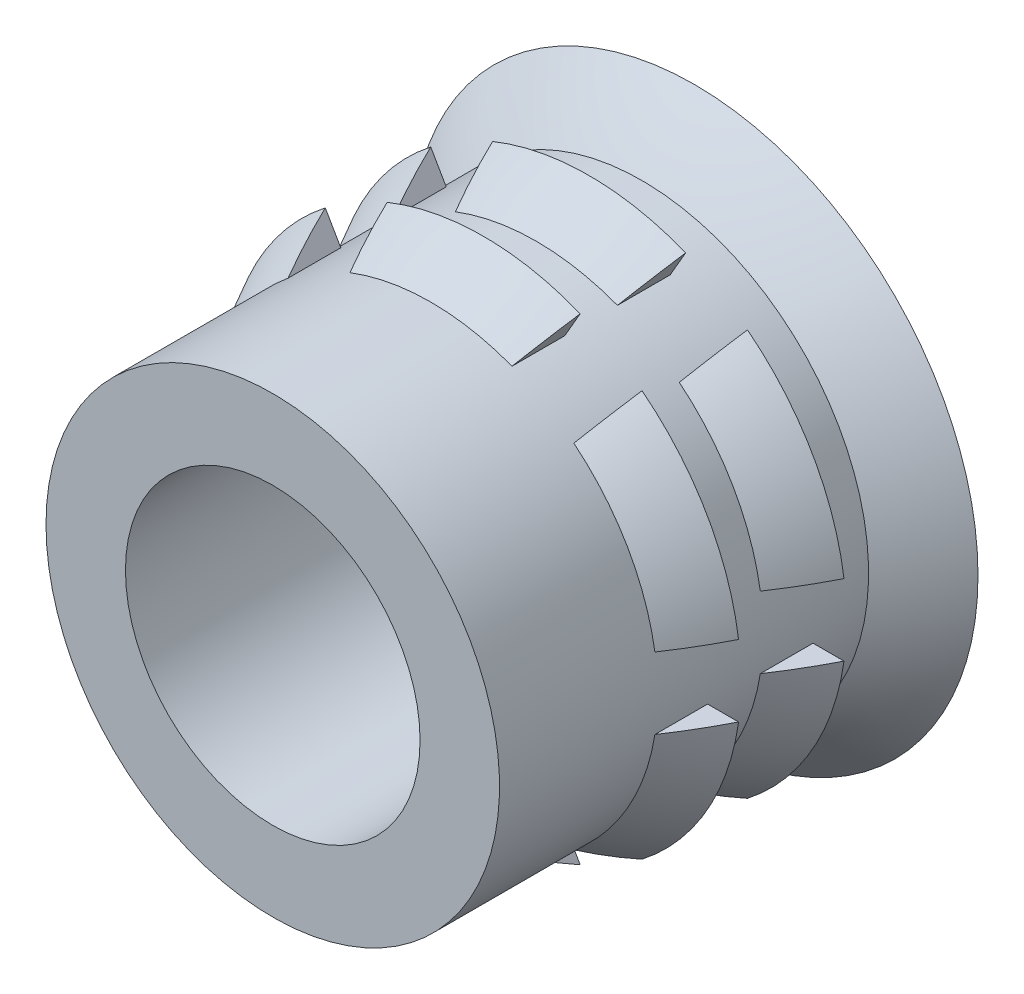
ISO-10303-21;
HEADER;
FILE_DESCRIPTION(('STEP AP214'),'2;1');
FILE_NAME('part.step','',(''),(''),'','','');
FILE_SCHEMA(('AUTOMOTIVE_DESIGN { 1 0 10303 214 1 1 1 1 }'));
ENDSEC;
DATA;
#1=APPLICATION_CONTEXT('core data for automotive mechanical design processes');
#2=APPLICATION_PROTOCOL_DEFINITION('international standard','automotive_design',2000,#1);
#3=PRODUCT_CONTEXT('',#1,'mechanical');
#4=PRODUCT('Part','Part','',(#3));
#5=PRODUCT_RELATED_PRODUCT_CATEGORY('part','',(#4));
#6=PRODUCT_DEFINITION_FORMATION('','',#4);
#7=PRODUCT_DEFINITION_CONTEXT('part definition',#1,'design');
#8=PRODUCT_DEFINITION('design','',#6,#7);
#9=PRODUCT_DEFINITION_SHAPE('','',#8);
#10=(LENGTH_UNIT() NAMED_UNIT(*) SI_UNIT(.MILLI.,.METRE.));
#11=(NAMED_UNIT(*) PLANE_ANGLE_UNIT() SI_UNIT($,.RADIAN.));
#12=(NAMED_UNIT(*) SI_UNIT($,.STERADIAN.) SOLID_ANGLE_UNIT());
#13=UNCERTAINTY_MEASURE_WITH_UNIT(LENGTH_MEASURE(1.E-05),#10,'distance_accuracy_value','');
#14=(GEOMETRIC_REPRESENTATION_CONTEXT(3) GLOBAL_UNCERTAINTY_ASSIGNED_CONTEXT((#13)) GLOBAL_UNIT_ASSIGNED_CONTEXT((#10,
#11,#12)) REPRESENTATION_CONTEXT('',''));
#15=CARTESIAN_POINT('',(0.,0.,0.));
#16=DIRECTION('',(0.,0.,1.));
#17=DIRECTION('',(1.,0.,0.));
#18=AXIS2_PLACEMENT_3D('',#15,#16,#17);
#19=CARTESIAN_POINT('',(8.96314757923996,0.,-18.5714698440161));
#20=DIRECTION('',(0.,0.,-1.));
#21=DIRECTION('',(-1.,0.,0.));
#22=AXIS2_PLACEMENT_3D('',#19,#20,#21);
#23=DEGENERATE_TOROIDAL_SURFACE('',#22,2.16135306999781,5.64512755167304,.F.);
#24=CARTESIAN_POINT('',(8.96314757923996,0.,-15.4466107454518));
#25=DIRECTION('',(0.,0.,-1.));
#26=DIRECTION('',(-1.,0.,0.));
#27=AXIS2_PLACEMENT_3D('',#24,#25,#26);
#28=CIRCLE('',#27,2.54);
#29=CARTESIAN_POINT('',(8.05540464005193,2.37225689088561,-15.4466107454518));
#30=VERTEX_POINT('',#29);
#31=CARTESIAN_POINT('',(9.87089051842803,2.37225689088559,-15.4466107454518));
#32=VERTEX_POINT('',#31);
#33=EDGE_CURVE('E678',#30,#32,#28,.T.);
#34=ORIENTED_EDGE('',*,*,#33,.T.);
#35=CARTESIAN_POINT('',(9.87082320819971,2.37214030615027,-15.4464107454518));
#36=CARTESIAN_POINT('',(9.90276467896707,2.4274645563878,-15.541336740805));
#37=CARTESIAN_POINT('',(9.93319146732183,2.4801652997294,-15.6380414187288));
#38=CARTESIAN_POINT('',(9.99101566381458,2.58031974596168,-15.8350080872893));
#39=CARTESIAN_POINT('',(10.0184130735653,2.62777345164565,-15.9352700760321));
#40=CARTESIAN_POINT('',(10.0442958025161,2.67260365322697,-16.0373107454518));
#41=B_SPLINE_CURVE_WITH_KNOTS('',3,(#35,#36,#37,#38,#39,#40),.UNSPECIFIED.,.F.,.F.,(4,2,4),(0.,
0.342774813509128,0.685549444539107),.UNSPECIFIED.);
#42=CARTESIAN_POINT('',(10.0442450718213,2.6725157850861,-16.0371107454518));
#43=VERTEX_POINT('',#42);
#44=EDGE_CURVE('E351',#32,#43,#41,.T.);
#45=ORIENTED_EDGE('',*,*,#44,.T.);
#46=CARTESIAN_POINT('',(8.96314757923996,0.,-16.0371107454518));
#47=DIRECTION('',(0.,0.,-1.));
#48=DIRECTION('',(-1.,0.,0.));
#49=AXIS2_PLACEMENT_3D('',#46,#47,#48);
#50=CIRCLE('',#49,2.88289999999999);
#51=CARTESIAN_POINT('',(7.8820500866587,2.67251578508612,-16.0371107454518));
#52=VERTEX_POINT('',#51);
#53=EDGE_CURVE('E676',#52,#43,#50,.T.);
#54=ORIENTED_EDGE('',*,*,#53,.F.);
#55=CARTESIAN_POINT('',(7.8819993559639,2.67260365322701,-16.0373107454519));
#56=CARTESIAN_POINT('',(7.9078820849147,2.62777345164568,-15.9352700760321));
#57=CARTESIAN_POINT('',(7.93527949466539,2.58031974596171,-15.8350080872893));
#58=CARTESIAN_POINT('',(7.99310369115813,2.48016529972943,-15.6380414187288));
#59=CARTESIAN_POINT('',(8.0235304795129,2.42746455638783,-15.541336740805));
#60=CARTESIAN_POINT('',(8.05547195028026,2.37214030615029,-15.4464107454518));
#61=B_SPLINE_CURVE_WITH_KNOTS('',3,(#55,#56,#57,#58,#59,#60),.UNSPECIFIED.,.F.,.F.,(4,2,4),(0.,
0.342774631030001,0.685549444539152),.UNSPECIFIED.);
#62=EDGE_CURVE('E383',#52,#30,#61,.T.);
#63=ORIENTED_EDGE('',*,*,#62,.T.);
#64=EDGE_LOOP('',(#34,#45,#54,#63));
#65=FACE_BOUND('',#64,.T.);
#66=ADVANCED_FACE('F39',(#65),#23,.F.);
#67=CARTESIAN_POINT('',(11.50314757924,0.,-16.0371107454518));
#68=DIRECTION('',(0.,0.,1.));
#69=DIRECTION('',(1.,0.,0.));
#70=AXIS2_PLACEMENT_3D('',#67,#68,#69);
#71=PLANE('',#70);
#72=ORIENTED_EDGE('',*,*,#53,.T.);
#73=DIRECTION('',(-0.50000000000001,-0.866025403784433,0.));
#74=VECTOR('',#73,1.);
#75=CARTESIAN_POINT('',(9.25173741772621,1.29985226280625,-16.0371107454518));
#76=LINE('',#75,#74);
#77=CARTESIAN_POINT('',(9.87089051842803,2.37225689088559,-16.0371107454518));
#78=VERTEX_POINT('',#77);
#79=EDGE_CURVE('E658',#43,#78,#76,.T.);
#80=ORIENTED_EDGE('',*,*,#79,.T.);
#81=CARTESIAN_POINT('',(8.96314757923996,0.,-16.0371107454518));
#82=DIRECTION('',(0.,0.,-1.));
#83=DIRECTION('',(-1.,0.,0.));
#84=AXIS2_PLACEMENT_3D('',#81,#82,#83);
#85=CIRCLE('',#84,2.54);
#86=CARTESIAN_POINT('',(8.05540464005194,2.37225689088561,-16.0371107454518));
#87=VERTEX_POINT('',#86);
#88=EDGE_CURVE('E311',#87,#78,#85,.T.);
#89=ORIENTED_EDGE('',*,*,#88,.F.);
#90=DIRECTION('',(-0.499999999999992,0.866025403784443,0.));
#91=VECTOR('',#90,1.);
#92=CARTESIAN_POINT('',(9.94455774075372,-0.899852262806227,-16.0371107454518));
#93=LINE('',#92,#91);
#94=EDGE_CURVE('E365',#87,#52,#93,.T.);
#95=ORIENTED_EDGE('',*,*,#94,.T.);
#96=EDGE_LOOP('',(#72,#80,#89,#95));
#97=FACE_BOUND('',#96,.T.);
#98=ADVANCED_FACE('F683',(#97),#71,.F.);
#99=CARTESIAN_POINT('',(8.96314757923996,0.,-19.7524698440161));
#100=DIRECTION('',(0.,0.,-1.));
#101=DIRECTION('',(-1.,0.,0.));
#102=AXIS2_PLACEMENT_3D('',#99,#100,#101);
#103=DEGENERATE_TOROIDAL_SURFACE('',#102,2.16135306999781,5.64512755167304,.F.);
#104=CARTESIAN_POINT('',(8.96314757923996,0.,-16.6276107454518));
#105=DIRECTION('',(0.,0.,-1.));
#106=DIRECTION('',(-1.,0.,0.));
#107=AXIS2_PLACEMENT_3D('',#104,#105,#106);
#108=CIRCLE('',#107,2.54);
#109=CARTESIAN_POINT('',(8.05540464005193,2.37225689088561,-16.6276107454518));
#110=VERTEX_POINT('',#109);
#111=CARTESIAN_POINT('',(9.87089051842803,2.37225689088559,-16.6276107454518));
#112=VERTEX_POINT('',#111);
#113=EDGE_CURVE('E294',#110,#112,#108,.T.);
#114=ORIENTED_EDGE('',*,*,#113,.T.);
#115=CARTESIAN_POINT('',(9.87082320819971,2.37214030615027,-16.6274107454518));
#116=CARTESIAN_POINT('',(9.90276467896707,2.4274645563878,-16.722336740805));
#117=CARTESIAN_POINT('',(9.93319146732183,2.4801652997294,-16.8190414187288));
#118=CARTESIAN_POINT('',(9.99101566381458,2.58031974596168,-17.0160080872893));
#119=CARTESIAN_POINT('',(10.0184130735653,2.62777345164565,-17.1162700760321));
#120=CARTESIAN_POINT('',(10.0442958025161,2.67260365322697,-17.2183107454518));
#121=B_SPLINE_CURVE_WITH_KNOTS('',3,(#115,#116,#117,#118,#119,#120),.UNSPECIFIED.,.F.,.F.,(4,2,
4),(0.,0.342774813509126,0.685549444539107),.UNSPECIFIED.);
#122=CARTESIAN_POINT('',(10.0442450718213,2.6725157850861,-17.2181107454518));
#123=VERTEX_POINT('',#122);
#124=EDGE_CURVE('E656',#112,#123,#121,.T.);
#125=ORIENTED_EDGE('',*,*,#124,.T.);
#126=CARTESIAN_POINT('',(8.96314757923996,0.,-17.2181107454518));
#127=DIRECTION('',(0.,0.,-1.));
#128=DIRECTION('',(-1.,0.,0.));
#129=AXIS2_PLACEMENT_3D('',#126,#127,#128);
#130=CIRCLE('',#129,2.88289999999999);
#131=CARTESIAN_POINT('',(7.8820500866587,2.67251578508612,-17.2181107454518));
#132=VERTEX_POINT('',#131);
#133=EDGE_CURVE('E620',#132,#123,#130,.T.);
#134=ORIENTED_EDGE('',*,*,#133,.F.);
#135=CARTESIAN_POINT('',(7.8819993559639,2.67260365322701,-17.2183107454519));
#136=CARTESIAN_POINT('',(7.9078820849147,2.62777345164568,-17.1162700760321));
#137=CARTESIAN_POINT('',(7.93527949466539,2.58031974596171,-17.0160080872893));
#138=CARTESIAN_POINT('',(7.99310369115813,2.48016529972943,-16.8190414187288));
#139=CARTESIAN_POINT('',(8.0235304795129,2.42746455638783,-16.722336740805));
#140=CARTESIAN_POINT('',(8.05547195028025,2.37214030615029,-16.6274107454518));
#141=B_SPLINE_CURVE_WITH_KNOTS('',3,(#135,#136,#137,#138,#139,#140),.UNSPECIFIED.,.F.,.F.,(4,2,
4),(0.,0.342774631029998,0.685549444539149),.UNSPECIFIED.);
#142=EDGE_CURVE('E357',#132,#110,#141,.T.);
#143=ORIENTED_EDGE('',*,*,#142,.T.);
#144=EDGE_LOOP('',(#114,#125,#134,#143));
#145=FACE_BOUND('',#144,.T.);
#146=ADVANCED_FACE('F654',(#145),#103,.F.);
#147=CARTESIAN_POINT('',(11.50314757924,0.,-17.2181107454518));
#148=DIRECTION('',(0.,0.,1.));
#149=DIRECTION('',(1.,0.,0.));
#150=AXIS2_PLACEMENT_3D('',#147,#148,#149);
#151=PLANE('',#150);
#152=ORIENTED_EDGE('',*,*,#133,.T.);
#153=DIRECTION('',(-0.50000000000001,-0.866025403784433,0.));
#154=VECTOR('',#153,1.);
#155=CARTESIAN_POINT('',(9.25173741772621,1.29985226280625,-17.2181107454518));
#156=LINE('',#155,#154);
#157=CARTESIAN_POINT('',(9.87089051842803,2.37225689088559,-17.2181107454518));
#158=VERTEX_POINT('',#157);
#159=EDGE_CURVE('E650',#123,#158,#156,.T.);
#160=ORIENTED_EDGE('',*,*,#159,.T.);
#161=CARTESIAN_POINT('',(8.96314757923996,0.,-17.2181107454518));
#162=DIRECTION('',(0.,0.,-1.));
#163=DIRECTION('',(-1.,0.,0.));
#164=AXIS2_PLACEMENT_3D('',#161,#162,#163);
#165=CIRCLE('',#164,2.54);
#166=CARTESIAN_POINT('',(8.05540464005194,2.37225689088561,-17.2181107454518));
#167=VERTEX_POINT('',#166);
#168=EDGE_CURVE('E623',#167,#158,#165,.T.);
#169=ORIENTED_EDGE('',*,*,#168,.F.);
#170=DIRECTION('',(-0.499999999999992,0.866025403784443,0.));
#171=VECTOR('',#170,1.);
#172=CARTESIAN_POINT('',(9.94455774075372,-0.899852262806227,-17.2181107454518));
#173=LINE('',#172,#171);
#174=EDGE_CURVE('E354',#167,#132,#173,.T.);
#175=ORIENTED_EDGE('',*,*,#174,.T.);
#176=EDGE_LOOP('',(#152,#160,#169,#175));
#177=FACE_BOUND('',#176,.T.);
#178=ADVANCED_FACE('F649',(#177),#151,.F.);
#179=CARTESIAN_POINT('',(6.45484137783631,0.4,-15.4466107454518));
#180=VERTEX_POINT('',#179);
#181=CARTESIAN_POINT('',(7.36258431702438,1.97225689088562,-15.4466107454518));
#182=VERTEX_POINT('',#181);
#183=EDGE_CURVE('E704',#180,#182,#28,.T.);
#184=ORIENTED_EDGE('',*,*,#183,.T.);
#185=CARTESIAN_POINT('',(7.3626516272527,1.9721403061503,-15.4464107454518));
#186=CARTESIAN_POINT('',(7.33071015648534,2.02746455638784,-15.541336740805));
#187=CARTESIAN_POINT('',(7.30028336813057,2.08016529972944,-15.6380414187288));
#188=CARTESIAN_POINT('',(7.24245917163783,2.18031974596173,-15.8350080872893));
#189=CARTESIAN_POINT('',(7.21506176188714,2.2277734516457,-15.9352700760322));
#190=CARTESIAN_POINT('',(7.18917903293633,2.27260365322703,-16.0373107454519));
#191=B_SPLINE_CURVE_WITH_KNOTS('',3,(#185,#186,#187,#188,#189,#190),.UNSPECIFIED.,.F.,.F.,(4,2,
4),(0.,0.34277481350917,0.685549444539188),.UNSPECIFIED.);
#192=CARTESIAN_POINT('',(7.18922976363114,2.27251578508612,-16.0371107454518));
#193=VERTEX_POINT('',#192);
#194=EDGE_CURVE('E398',#182,#193,#191,.T.);
#195=ORIENTED_EDGE('',*,*,#194,.T.);
#196=CARTESIAN_POINT('',(6.10813227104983,0.4,-16.0371107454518));
#197=VERTEX_POINT('',#196);
#198=EDGE_CURVE('E687',#197,#193,#50,.T.);
#199=ORIENTED_EDGE('',*,*,#198,.F.);
#200=CARTESIAN_POINT('',(6.26884175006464,0.4,-15.7426201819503));
#201=CARTESIAN_POINT('',(6.34676374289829,0.4,-15.6095140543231));
#202=CARTESIAN_POINT('',(6.43021204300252,0.4,-15.4796429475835));
#203=CARTESIAN_POINT('',(6.60766898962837,0.4,-15.2272322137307));
#204=CARTESIAN_POINT('',(6.70168266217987,0.4,-15.1046961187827));
#205=CARTESIAN_POINT('',(6.8993954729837,0.4,-14.8682340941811));
#206=CARTESIAN_POINT('',(7.0030692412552,0.4,-14.7542869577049));
#207=CARTESIAN_POINT('',(7.21963023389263,0.4,-14.5356361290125));
#208=CARTESIAN_POINT('',(7.33251178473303,0.4,-14.430926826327));
#209=CARTESIAN_POINT('',(7.54516886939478,0.4,-14.2502178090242));
#210=CARTESIAN_POINT('',(7.64348289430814,0.4,-14.1724985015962));
#211=CARTESIAN_POINT('',(7.79531995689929,0.4,-14.0614258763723));
#212=CARTESIAN_POINT('',(7.84678608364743,0.4,-14.0252409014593));
#213=CARTESIAN_POINT('',(7.95109996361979,0.4,-13.9549434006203));
#214=CARTESIAN_POINT('',(8.00394734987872,0.4,-13.9208303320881));
#215=CARTESIAN_POINT('',(8.11146217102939,0.4,-13.8546531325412));
#216=CARTESIAN_POINT('',(8.16614027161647,0.4,-13.8226062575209));
#217=CARTESIAN_POINT('',(8.2770921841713,0.4,-13.7612311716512));
#218=CARTESIAN_POINT('',(8.33336784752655,0.4,-13.731906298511));
#219=CARTESIAN_POINT('',(8.44730504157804,0.4,-13.6770015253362));
#220=CARTESIAN_POINT('',(8.50495486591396,0.4,-13.6513980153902));
#221=CARTESIAN_POINT('',(8.59298054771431,0.4,-13.6171012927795));
#222=CARTESIAN_POINT('',(8.62255501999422,0.4,-13.6063612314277));
#223=CARTESIAN_POINT('',(8.68229754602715,0.4,-13.586704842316));
#224=CARTESIAN_POINT('',(8.71246520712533,0.4,-13.5777873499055));
#225=CARTESIAN_POINT('',(8.76731579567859,0.4,-13.5639436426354));
#226=CARTESIAN_POINT('',(8.79188556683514,0.4,-13.5585756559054));
#227=CARTESIAN_POINT('',(8.84137310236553,0.4,-13.549799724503));
#228=CARTESIAN_POINT('',(8.86629072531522,0.4,-13.5463910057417));
#229=CARTESIAN_POINT('',(8.91618845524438,0.4,-13.5418885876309));
#230=CARTESIAN_POINT('',(8.94116725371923,0.4,-13.5407808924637));
#231=CARTESIAN_POINT('',(8.99111713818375,0.4,-13.5409703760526));
#232=CARTESIAN_POINT('',(9.0160882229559,0.4,-13.5422678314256));
#233=CARTESIAN_POINT('',(9.07331384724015,0.4,-13.5478516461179));
#234=CARTESIAN_POINT('',(9.10549081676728,0.4,-13.55292223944));
#235=CARTESIAN_POINT('',(9.16923111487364,0.4,-13.5661045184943));
#236=CARTESIAN_POINT('',(9.20079351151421,0.4,-13.5742204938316));
#237=CARTESIAN_POINT('',(9.26361115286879,0.4,-13.5927911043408));
#238=CARTESIAN_POINT('',(9.29485840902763,0.4,-13.6032721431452));
#239=CARTESIAN_POINT('',(9.3567133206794,0.4,-13.6259146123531));
#240=CARTESIAN_POINT('',(9.3873212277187,0.4,-13.6380753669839));
#241=CARTESIAN_POINT('',(9.46676965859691,0.4,-13.6716050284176));
#242=CARTESIAN_POINT('',(9.51516924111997,0.4,-13.6940144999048));
#243=CARTESIAN_POINT('',(9.6107739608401,0.4,-13.7412551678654));
#244=CARTESIAN_POINT('',(9.65797865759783,0.4,-13.7660872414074));
#245=CARTESIAN_POINT('',(9.75136848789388,0.4,-13.817744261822));
#246=CARTESIAN_POINT('',(9.79755210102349,0.4,-13.8445719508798));
#247=CARTESIAN_POINT('',(9.88889233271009,0.4,-13.89992609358));
#248=CARTESIAN_POINT('',(9.93404881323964,0.4,-13.9284527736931));
#249=CARTESIAN_POINT('',(10.0678266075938,0.4,-14.0162040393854));
#250=CARTESIAN_POINT('',(10.1549601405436,0.4,-14.0777144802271));
#251=CARTESIAN_POINT('',(10.3251181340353,0.4,-14.2060042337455));
#252=CARTESIAN_POINT('',(10.4081457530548,0.4,-14.2727793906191));
#253=CARTESIAN_POINT('',(10.6058905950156,0.4,-14.4418715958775));
#254=CARTESIAN_POINT('',(10.7183613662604,0.4,-14.5468343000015));
#255=CARTESIAN_POINT('',(10.9340844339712,0.4,-14.7659288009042));
#256=CARTESIAN_POINT('',(11.0373313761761,0.4,-14.8800658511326));
#257=CARTESIAN_POINT('',(11.2338720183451,0.4,-15.1164832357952));
#258=CARTESIAN_POINT('',(11.327172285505,0.4,-15.2387581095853));
#259=CARTESIAN_POINT('',(11.5032993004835,0.4,-15.490595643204));
#260=CARTESIAN_POINT('',(11.5861279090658,0.4,-15.6201570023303));
#261=CARTESIAN_POINT('',(11.7410742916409,0.4,-15.8861390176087));
#262=CARTESIAN_POINT('',(11.8131537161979,0.4,-16.0225820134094));
#263=CARTESIAN_POINT('',(11.9458097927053,0.4,-16.3010089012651));
#264=CARTESIAN_POINT('',(12.006382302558,0.4,-16.4429947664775));
#265=CARTESIAN_POINT('',(12.1156035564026,0.4,-16.7315058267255));
#266=CARTESIAN_POINT('',(12.1642504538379,0.4,-16.8780317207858));
#267=CARTESIAN_POINT('',(12.2493029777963,0.4,-17.1746519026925));
#268=CARTESIAN_POINT('',(12.2857040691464,0.4,-17.3247474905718));
#269=CARTESIAN_POINT('',(12.3465738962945,0.4,-17.630316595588));
#270=CARTESIAN_POINT('',(12.3708020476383,0.4,-17.7858380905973));
#271=CARTESIAN_POINT('',(12.4061089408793,0.4,-18.0984249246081));
#272=CARTESIAN_POINT('',(12.4171827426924,0.4,-18.255490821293));
#273=CARTESIAN_POINT('',(12.4260853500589,0.4,-18.5698949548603));
#274=CARTESIAN_POINT('',(12.4239228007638,0.4,-18.7272329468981));
#275=CARTESIAN_POINT('',(12.4063845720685,0.4,-19.0412287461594));
#276=CARTESIAN_POINT('',(12.391004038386,0.4,-19.1978862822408));
#277=CARTESIAN_POINT('',(12.3470881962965,0.4,-19.5096463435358));
#278=CARTESIAN_POINT('',(12.3185282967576,0.4,-19.6647454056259));
#279=CARTESIAN_POINT('',(12.2484301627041,0.4,-19.9720440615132));
#280=CARTESIAN_POINT('',(12.2068870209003,0.4,-20.1242425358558));
#281=CARTESIAN_POINT('',(12.11109990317,0.4,-20.4246312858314));
#282=CARTESIAN_POINT('',(12.0568528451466,0.4,-20.5728205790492));
#283=CARTESIAN_POINT('',(11.936020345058,0.4,-20.8641349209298));
#284=CARTESIAN_POINT('',(11.8694307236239,0.4,-21.0072582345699));
#285=CARTESIAN_POINT('',(11.7244392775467,0.4,-21.2872268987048));
#286=CARTESIAN_POINT('',(11.6460495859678,0.4,-21.4240785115));
#287=CARTESIAN_POINT('',(11.4779556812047,0.4,-21.6906607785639));
#288=CARTESIAN_POINT('',(11.3882459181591,0.4,-21.8203878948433));
#289=CARTESIAN_POINT('',(11.1033119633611,0.4,-22.1969326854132));
#290=CARTESIAN_POINT('',(10.8918520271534,0.4,-22.4319456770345));
#291=CARTESIAN_POINT('',(10.5629487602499,0.4,-22.7388877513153));
#292=CARTESIAN_POINT('',(10.460513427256,0.4,-22.8274943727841));
#293=CARTESIAN_POINT('',(10.2491365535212,0.4,-22.9964316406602));
#294=CARTESIAN_POINT('',(10.1402035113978,0.4,-23.0767727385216));
#295=CARTESIAN_POINT('',(9.97713565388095,0.4,-23.1866993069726));
#296=CARTESIAN_POINT('',(9.92551770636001,0.4,-23.2200682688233));
#297=CARTESIAN_POINT('',(9.82090732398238,0.4,-23.2846306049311));
#298=CARTESIAN_POINT('',(9.76791449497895,0.4,-23.3158233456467));
#299=CARTESIAN_POINT('',(9.66025336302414,0.4,-23.3757791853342));
#300=CARTESIAN_POINT('',(9.60557853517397,0.4,-23.4045305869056));
#301=CARTESIAN_POINT('',(9.49461634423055,0.4,-23.4587255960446));
#302=CARTESIAN_POINT('',(9.43833004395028,0.4,-23.4841713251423));
#303=CARTESIAN_POINT('',(9.35245891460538,0.4,-23.5185932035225));
#304=CARTESIAN_POINT('',(9.32362441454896,0.4,-23.5294337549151));
#305=CARTESIAN_POINT('',(9.26537571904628,0.4,-23.5494879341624));
#306=CARTESIAN_POINT('',(9.23596135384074,0.4,-23.5587010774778));
#307=CARTESIAN_POINT('',(9.17687869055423,0.4,-23.5748508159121));
#308=CARTESIAN_POINT('',(9.14721768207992,0.4,-23.5818134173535));
#309=CARTESIAN_POINT('',(9.08738587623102,0.4,-23.592918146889));
#310=CARTESIAN_POINT('',(9.05721569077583,0.4,-23.597063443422));
#311=CARTESIAN_POINT('',(8.99597669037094,0.4,-23.6019774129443));
#312=CARTESIAN_POINT('',(8.96490197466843,0.4,-23.6026768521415));
#313=CARTESIAN_POINT('',(8.9028921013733,0.4,-23.6003747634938));
#314=CARTESIAN_POINT('',(8.87195698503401,0.4,-23.5973722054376));
#315=CARTESIAN_POINT('',(8.77924683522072,0.4,-23.5835117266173));
#316=CARTESIAN_POINT('',(8.71822683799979,0.4,-23.5677637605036));
#317=CARTESIAN_POINT('',(8.62182016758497,0.4,-23.5364931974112));
#318=CARTESIAN_POINT('',(8.58560039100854,0.4,-23.523213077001));
#319=CARTESIAN_POINT('',(8.51394186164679,0.4,-23.4946692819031));
#320=CARTESIAN_POINT('',(8.47850297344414,0.4,-23.4794059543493));
#321=CARTESIAN_POINT('',(8.40826887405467,0.4,-23.4473522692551));
#322=CARTESIAN_POINT('',(8.37347475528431,0.4,-23.4305595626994));
#323=CARTESIAN_POINT('',(8.30450501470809,0.4,-23.3957443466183));
#324=CARTESIAN_POINT('',(8.27032945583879,0.4,-23.3777217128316));
#325=CARTESIAN_POINT('',(8.16842967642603,0.4,-23.3219615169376));
#326=CARTESIAN_POINT('',(8.1015675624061,0.4,-23.2826421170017));
#327=CARTESIAN_POINT('',(7.97005326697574,0.4,-23.2006278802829));
#328=CARTESIAN_POINT('',(7.90539920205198,0.4,-23.1579360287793));
#329=CARTESIAN_POINT('',(7.72044937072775,0.4,-23.0293993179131));
#330=CARTESIAN_POINT('',(7.60290748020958,0.4,-22.9395536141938));
#331=CARTESIAN_POINT('',(7.37570179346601,0.4,-22.7502796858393));
#332=CARTESIAN_POINT('',(7.26604469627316,0.4,-22.6508434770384));
#333=CARTESIAN_POINT('',(7.05562166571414,0.4,-22.4437597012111));
#334=CARTESIAN_POINT('',(6.95482260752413,0.4,-22.3361458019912));
#335=CARTESIAN_POINT('',(6.76220490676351,0.4,-22.1132202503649));
#336=CARTESIAN_POINT('',(6.67038378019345,0.4,-21.9979107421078));
#337=CARTESIAN_POINT('',(6.49455807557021,0.4,-21.7581021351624));
#338=CARTESIAN_POINT('',(6.41073433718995,0.4,-21.6334704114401));
#339=CARTESIAN_POINT('',(6.25339512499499,0.4,-21.3778042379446));
#340=CARTESIAN_POINT('',(6.17988324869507,0.4,-21.2467675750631));
#341=CARTESIAN_POINT('',(6.04355960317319,0.4,-20.9790146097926));
#342=CARTESIAN_POINT('',(5.98076268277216,0.4,-20.8422907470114));
#343=CARTESIAN_POINT('',(5.8663636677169,0.4,-20.564183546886));
#344=CARTESIAN_POINT('',(5.8147654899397,0.4,-20.4227985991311));
#345=CARTESIAN_POINT('',(5.7211351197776,0.4,-20.1301467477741));
#346=CARTESIAN_POINT('',(5.67961195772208,0.4,-19.9787167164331));
#347=CARTESIAN_POINT('',(5.60941431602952,0.4,-19.6729064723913));
#348=CARTESIAN_POINT('',(5.58074006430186,0.4,-19.518526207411));
#349=CARTESIAN_POINT('',(5.53643490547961,0.4,-19.2078898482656));
#350=CARTESIAN_POINT('',(5.52080523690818,0.4,-19.0516335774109));
#351=CARTESIAN_POINT('',(5.50270449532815,0.4,-18.7384161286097));
#352=CARTESIAN_POINT('',(5.50022881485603,0.4,-18.5814552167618));
#353=CARTESIAN_POINT('',(5.50846488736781,0.4,-18.2669541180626));
#354=CARTESIAN_POINT('',(5.51925435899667,0.4,-18.1094159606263));
#355=CARTESIAN_POINT('',(5.55407088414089,0.4,-17.7958675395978));
#356=CARTESIAN_POINT('',(5.57809311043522,0.4,-17.6398567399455));
#357=CARTESIAN_POINT('',(5.63916064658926,0.4,-17.3306411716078));
#358=CARTESIAN_POINT('',(5.67618695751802,0.4,-17.177432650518));
#359=CARTESIAN_POINT('',(5.76299830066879,0.4,-16.8747335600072));
#360=CARTESIAN_POINT('',(5.81277865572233,0.4,-16.7252416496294));
#361=CARTESIAN_POINT('',(5.92371841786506,0.4,-16.4337270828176));
#362=CARTESIAN_POINT('',(5.98464871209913,0.4,-16.291617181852));
#363=CARTESIAN_POINT('',(6.11814022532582,0.4,-16.0127904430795));
#364=CARTESIAN_POINT('',(6.19071316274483,0.4,-15.876079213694));
#365=CARTESIAN_POINT('',(6.26884175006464,0.4,-15.7426201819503));
#366=B_SPLINE_CURVE_WITH_KNOTS('',3,(#200,#201,#202,#203,#204,#205,#206,#207,#208,#209,#210,
#211,#212,#213,#214,#215,#216,#217,#218,#219,#220,#221,#222,#223,#224,#225,#226,#227,#228,#229,
#230,#231,#232,#233,#234,#235,#236,#237,#238,#239,#240,#241,#242,#243,#244,#245,#246,#247,#248,
#249,#250,#251,#252,#253,#254,#255,#256,#257,#258,#259,#260,#261,#262,#263,#264,#265,#266,#267,
#268,#269,#270,#271,#272,#273,#274,#275,#276,#277,#278,#279,#280,#281,#282,#283,#284,#285,#286,
#287,#288,#289,#290,#291,#292,#293,#294,#295,#296,#297,#298,#299,#300,#301,#302,#303,#304,#305,
#306,#307,#308,#309,#310,#311,#312,#313,#314,#315,#316,#317,#318,#319,#320,#321,#322,#323,#324,
#325,#326,#327,#328,#329,#330,#331,#332,#333,#334,#335,#336,#337,#338,#339,#340,#341,#342,#343,
#344,#345,#346,#347,#348,#349,#350,#351,#352,#353,#354,#355,#356,#357,#358,#359,#360,#361,#362,
#363,#364,#365),.UNSPECIFIED.,.T.,.F.,(4,2,2,2,2,2,2,2,2,2,2,2,2,2,2,2,2,2,2,2,2,2,2,2,2,2,2,2,
2,2,2,2,2,2,2,2,2,2,2,2,2,2,2,2,2,2,2,2,2,2,2,2,2,2,2,2,2,2,2,2,2,2,2,2,2,2,2,2,2,2,2,2,2,2,2,2,
2,2,2,2,2,2,4),(0.,0.462578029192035,0.925377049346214,1.38699316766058,1.84832697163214,
2.22394894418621,2.4126487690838,2.60129896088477,2.79136182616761,2.98165474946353,
3.1706820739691,3.26503474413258,3.35932693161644,3.43471213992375,3.5100675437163,
3.58496324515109,3.65986756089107,3.75739019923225,3.85505072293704,3.95386079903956,
4.05263123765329,4.21253643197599,4.37249973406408,4.53268705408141,4.69289577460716,
5.01261309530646,5.33208052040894,5.79300224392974,6.25418980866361,6.71507096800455,
7.17587011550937,7.6382758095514,8.10084763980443,8.56349104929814,9.02630560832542,
9.49793897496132,9.96974940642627,10.4412517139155,10.912927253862,11.3854864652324,
11.8582245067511,12.3310773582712,12.8040906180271,13.2766207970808,13.7493835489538,
14.6921316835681,15.0981928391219,15.5037340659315,15.6880901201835,15.8724996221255,
16.0577479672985,16.2428768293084,16.33525707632,16.4276647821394,16.5189629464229,
16.6101582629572,16.7031785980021,16.7962248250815,16.9842555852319,17.0999735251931,
17.2156712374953,17.3315497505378,17.4474399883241,17.6799985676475,17.9123535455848,
18.3555799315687,18.7991785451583,19.2410406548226,19.6827801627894,20.1328805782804,
20.5831376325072,21.0340136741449,21.4850471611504,21.9555487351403,22.4260586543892,
22.8966132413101,23.3670029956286,23.8401618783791,24.3131482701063,24.7854464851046,
25.2575717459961,25.7209068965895,26.1847113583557),.UNSPECIFIED.);
#367=EDGE_CURVE('E428',#197,#180,#366,.T.);
#368=ORIENTED_EDGE('',*,*,#367,.T.);
#369=EDGE_LOOP('',(#184,#195,#199,#368));
#370=FACE_BOUND('',#369,.T.);
#371=ADVANCED_FACE('F728',(#370),#23,.F.);
#372=ORIENTED_EDGE('',*,*,#198,.T.);
#373=DIRECTION('',(0.499999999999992,-0.866025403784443,0.));
#374=VECTOR('',#373,1.);
#375=CARTESIAN_POINT('',(9.25173741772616,-1.29985226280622,-16.0371107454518));
#376=LINE('',#375,#374);
#377=CARTESIAN_POINT('',(7.36258431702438,1.97225689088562,-16.0371107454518));
#378=VERTEX_POINT('',#377);
#379=EDGE_CURVE('E395',#193,#378,#376,.T.);
#380=ORIENTED_EDGE('',*,*,#379,.T.);
#381=CARTESIAN_POINT('',(6.45484137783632,0.4,-16.0371107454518));
#382=VERTEX_POINT('',#381);
#383=EDGE_CURVE('E698',#382,#378,#85,.T.);
#384=ORIENTED_EDGE('',*,*,#383,.F.);
#385=DIRECTION('',(-1.,0.,0.));
#386=VECTOR('',#385,1.);
#387=CARTESIAN_POINT('',(11.50314757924,0.4,-16.0371107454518));
#388=LINE('',#387,#386);
#389=EDGE_CURVE('E416',#382,#197,#388,.T.);
#390=ORIENTED_EDGE('',*,*,#389,.T.);
#391=EDGE_LOOP('',(#372,#380,#384,#390));
#392=FACE_BOUND('',#391,.T.);
#393=ADVANCED_FACE('F732',(#392),#71,.F.);
#394=CARTESIAN_POINT('',(6.45484137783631,0.4,-16.6276107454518));
#395=VERTEX_POINT('',#394);
#396=CARTESIAN_POINT('',(7.36258431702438,1.97225689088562,-16.6276107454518));
#397=VERTEX_POINT('',#396);
#398=EDGE_CURVE('E299',#395,#397,#108,.T.);
#399=ORIENTED_EDGE('',*,*,#398,.T.);
#400=CARTESIAN_POINT('',(7.3626516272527,1.9721403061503,-16.6274107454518));
#401=CARTESIAN_POINT('',(7.33071015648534,2.02746455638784,-16.722336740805));
#402=CARTESIAN_POINT('',(7.30028336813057,2.08016529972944,-16.8190414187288));
#403=CARTESIAN_POINT('',(7.24245917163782,2.18031974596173,-17.0160080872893));
#404=CARTESIAN_POINT('',(7.21506176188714,2.2277734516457,-17.1162700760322));
#405=CARTESIAN_POINT('',(7.18917903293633,2.27260365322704,-17.2183107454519));
#406=B_SPLINE_CURVE_WITH_KNOTS('',3,(#400,#401,#402,#403,#404,#405),.UNSPECIFIED.,.F.,.F.,(4,2,
4),(0.,0.342774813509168,0.685549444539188),.UNSPECIFIED.);
#407=CARTESIAN_POINT('',(7.18922976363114,2.27251578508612,-17.2181107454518));
#408=VERTEX_POINT('',#407);
#409=EDGE_CURVE('E331',#397,#408,#406,.T.);
#410=ORIENTED_EDGE('',*,*,#409,.T.);
#411=CARTESIAN_POINT('',(6.10813227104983,0.4,-17.2181107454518));
#412=VERTEX_POINT('',#411);
#413=EDGE_CURVE('E642',#412,#408,#130,.T.);
#414=ORIENTED_EDGE('',*,*,#413,.F.);
#415=CARTESIAN_POINT('',(6.26884175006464,0.4,-16.9236201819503));
#416=CARTESIAN_POINT('',(6.34676374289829,0.4,-16.7905140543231));
#417=CARTESIAN_POINT('',(6.43021204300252,0.4,-16.6606429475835));
#418=CARTESIAN_POINT('',(6.60766898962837,0.4,-16.4082322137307));
#419=CARTESIAN_POINT('',(6.70168266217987,0.4,-16.2856961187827));
#420=CARTESIAN_POINT('',(6.8993954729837,0.4,-16.0492340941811));
#421=CARTESIAN_POINT('',(7.0030692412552,0.4,-15.9352869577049));
#422=CARTESIAN_POINT('',(7.21963023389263,0.4,-15.7166361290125));
#423=CARTESIAN_POINT('',(7.33251178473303,0.4,-15.611926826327));
#424=CARTESIAN_POINT('',(7.54516886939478,0.4,-15.4312178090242));
#425=CARTESIAN_POINT('',(7.64348289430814,0.4,-15.3534985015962));
#426=CARTESIAN_POINT('',(7.79531995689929,0.4,-15.2424258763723));
#427=CARTESIAN_POINT('',(7.84678608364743,0.4,-15.2062409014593));
#428=CARTESIAN_POINT('',(7.95109996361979,0.4,-15.1359434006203));
#429=CARTESIAN_POINT('',(8.00394734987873,0.4,-15.1018303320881));
#430=CARTESIAN_POINT('',(8.11146217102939,0.4,-15.0356531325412));
#431=CARTESIAN_POINT('',(8.16614027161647,0.4,-15.0036062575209));
#432=CARTESIAN_POINT('',(8.2770921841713,0.4,-14.9422311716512));
#433=CARTESIAN_POINT('',(8.33336784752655,0.4,-14.912906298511));
#434=CARTESIAN_POINT('',(8.44730504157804,0.4,-14.8580015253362));
#435=CARTESIAN_POINT('',(8.50495486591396,0.4,-14.8323980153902));
#436=CARTESIAN_POINT('',(8.5929805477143,0.4,-14.7981012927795));
#437=CARTESIAN_POINT('',(8.62255501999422,0.4,-14.7873612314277));
#438=CARTESIAN_POINT('',(8.68229754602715,0.4,-14.767704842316));
#439=CARTESIAN_POINT('',(8.71246520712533,0.4,-14.7587873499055));
#440=CARTESIAN_POINT('',(8.76731579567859,0.4,-14.7449436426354));
#441=CARTESIAN_POINT('',(8.79188556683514,0.4,-14.7395756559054));
#442=CARTESIAN_POINT('',(8.84137310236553,0.4,-14.730799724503));
#443=CARTESIAN_POINT('',(8.86629072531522,0.4,-14.7273910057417));
#444=CARTESIAN_POINT('',(8.91618845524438,0.4,-14.7228885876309));
#445=CARTESIAN_POINT('',(8.94116725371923,0.4,-14.7217808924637));
#446=CARTESIAN_POINT('',(8.99111713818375,0.4,-14.7219703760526));
#447=CARTESIAN_POINT('',(9.0160882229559,0.4,-14.7232678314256));
#448=CARTESIAN_POINT('',(9.07331384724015,0.4,-14.7288516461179));
#449=CARTESIAN_POINT('',(9.10549081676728,0.4,-14.73392223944));
#450=CARTESIAN_POINT('',(9.16923111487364,0.4,-14.7471045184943));
#451=CARTESIAN_POINT('',(9.20079351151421,0.4,-14.7552204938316));
#452=CARTESIAN_POINT('',(9.26361115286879,0.4,-14.7737911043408));
#453=CARTESIAN_POINT('',(9.29485840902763,0.4,-14.7842721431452));
#454=CARTESIAN_POINT('',(9.3567133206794,0.4,-14.8069146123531));
#455=CARTESIAN_POINT('',(9.3873212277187,0.4,-14.8190753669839));
#456=CARTESIAN_POINT('',(9.46676965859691,0.4,-14.8526050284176));
#457=CARTESIAN_POINT('',(9.51516924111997,0.4,-14.8750144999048));
#458=CARTESIAN_POINT('',(9.6107739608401,0.4,-14.9222551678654));
#459=CARTESIAN_POINT('',(9.65797865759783,0.4,-14.9470872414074));
#460=CARTESIAN_POINT('',(9.75136848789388,0.4,-14.998744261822));
#461=CARTESIAN_POINT('',(9.79755210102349,0.4,-15.0255719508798));
#462=CARTESIAN_POINT('',(9.88889233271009,0.4,-15.08092609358));
#463=CARTESIAN_POINT('',(9.93404881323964,0.4,-15.1094527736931));
#464=CARTESIAN_POINT('',(10.0678266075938,0.4,-15.1972040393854));
#465=CARTESIAN_POINT('',(10.1549601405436,0.4,-15.2587144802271));
#466=CARTESIAN_POINT('',(10.3251181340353,0.4,-15.3870042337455));
#467=CARTESIAN_POINT('',(10.4081457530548,0.4,-15.4537793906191));
#468=CARTESIAN_POINT('',(10.6058905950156,0.4,-15.6228715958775));
#469=CARTESIAN_POINT('',(10.7183613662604,0.4,-15.7278343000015));
#470=CARTESIAN_POINT('',(10.9340844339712,0.4,-15.9469288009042));
#471=CARTESIAN_POINT('',(11.0373313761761,0.4,-16.0610658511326));
#472=CARTESIAN_POINT('',(11.2338720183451,0.4,-16.2974832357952));
#473=CARTESIAN_POINT('',(11.327172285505,0.4,-16.4197581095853));
#474=CARTESIAN_POINT('',(11.5032993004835,0.4,-16.671595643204));
#475=CARTESIAN_POINT('',(11.5861279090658,0.4,-16.8011570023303));
#476=CARTESIAN_POINT('',(11.7410742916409,0.4,-17.0671390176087));
#477=CARTESIAN_POINT('',(11.8131537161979,0.4,-17.2035820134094));
#478=CARTESIAN_POINT('',(11.9458097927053,0.4,-17.4820089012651));
#479=CARTESIAN_POINT('',(12.006382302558,0.4,-17.6239947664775));
#480=CARTESIAN_POINT('',(12.1156035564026,0.4,-17.9125058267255));
#481=CARTESIAN_POINT('',(12.1642504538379,0.4,-18.0590317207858));
#482=CARTESIAN_POINT('',(12.2493029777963,0.4,-18.3556519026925));
#483=CARTESIAN_POINT('',(12.2857040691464,0.4,-18.5057474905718));
#484=CARTESIAN_POINT('',(12.3465738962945,0.4,-18.811316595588));
#485=CARTESIAN_POINT('',(12.3708020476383,0.4,-18.9668380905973));
#486=CARTESIAN_POINT('',(12.4061089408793,0.4,-19.2794249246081));
#487=CARTESIAN_POINT('',(12.4171827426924,0.4,-19.436490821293));
#488=CARTESIAN_POINT('',(12.4260853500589,0.4,-19.7508949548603));
#489=CARTESIAN_POINT('',(12.4239228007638,0.4,-19.9082329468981));
#490=CARTESIAN_POINT('',(12.4063845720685,0.4,-20.2222287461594));
#491=CARTESIAN_POINT('',(12.391004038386,0.4,-20.3788862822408));
#492=CARTESIAN_POINT('',(12.3470881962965,0.4,-20.6906463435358));
#493=CARTESIAN_POINT('',(12.3185282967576,0.4,-20.8457454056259));
#494=CARTESIAN_POINT('',(12.2484301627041,0.4,-21.1530440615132));
#495=CARTESIAN_POINT('',(12.2068870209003,0.4,-21.3052425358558));
#496=CARTESIAN_POINT('',(12.11109990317,0.4,-21.6056312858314));
#497=CARTESIAN_POINT('',(12.0568528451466,0.4,-21.7538205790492));
#498=CARTESIAN_POINT('',(11.936020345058,0.4,-22.0451349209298));
#499=CARTESIAN_POINT('',(11.8694307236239,0.4,-22.1882582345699));
#500=CARTESIAN_POINT('',(11.7244392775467,0.4,-22.4682268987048));
#501=CARTESIAN_POINT('',(11.6460495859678,0.4,-22.6050785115));
#502=CARTESIAN_POINT('',(11.4779556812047,0.4,-22.8716607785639));
#503=CARTESIAN_POINT('',(11.3882459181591,0.4,-23.0013878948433));
#504=CARTESIAN_POINT('',(11.1033119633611,0.4,-23.3779326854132));
#505=CARTESIAN_POINT('',(10.8918520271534,0.4,-23.6129456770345));
#506=CARTESIAN_POINT('',(10.5629487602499,0.4,-23.9198877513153));
#507=CARTESIAN_POINT('',(10.460513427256,0.4,-24.0084943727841));
#508=CARTESIAN_POINT('',(10.2491365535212,0.4,-24.1774316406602));
#509=CARTESIAN_POINT('',(10.1402035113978,0.4,-24.2577727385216));
#510=CARTESIAN_POINT('',(9.97713565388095,0.4,-24.3676993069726));
#511=CARTESIAN_POINT('',(9.92551770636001,0.4,-24.4010682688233));
#512=CARTESIAN_POINT('',(9.82090732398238,0.4,-24.4656306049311));
#513=CARTESIAN_POINT('',(9.76791449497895,0.4,-24.4968233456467));
#514=CARTESIAN_POINT('',(9.66025336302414,0.4,-24.5567791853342));
#515=CARTESIAN_POINT('',(9.60557853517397,0.4,-24.5855305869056));
#516=CARTESIAN_POINT('',(9.49461634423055,0.4,-24.6397255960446));
#517=CARTESIAN_POINT('',(9.43833004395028,0.4,-24.6651713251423));
#518=CARTESIAN_POINT('',(9.35245891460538,0.4,-24.6995932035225));
#519=CARTESIAN_POINT('',(9.32362441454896,0.4,-24.7104337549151));
#520=CARTESIAN_POINT('',(9.26537571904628,0.4,-24.7304879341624));
#521=CARTESIAN_POINT('',(9.23596135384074,0.4,-24.7397010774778));
#522=CARTESIAN_POINT('',(9.17687869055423,0.4,-24.7558508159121));
#523=CARTESIAN_POINT('',(9.14721768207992,0.4,-24.7628134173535));
#524=CARTESIAN_POINT('',(9.08738587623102,0.4,-24.773918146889));
#525=CARTESIAN_POINT('',(9.05721569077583,0.4,-24.778063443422));
#526=CARTESIAN_POINT('',(8.99597669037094,0.4,-24.7829774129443));
#527=CARTESIAN_POINT('',(8.96490197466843,0.4,-24.7836768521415));
#528=CARTESIAN_POINT('',(8.9028921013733,0.4,-24.7813747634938));
#529=CARTESIAN_POINT('',(8.87195698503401,0.4,-24.7783722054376));
#530=CARTESIAN_POINT('',(8.77924683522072,0.4,-24.7645117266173));
#531=CARTESIAN_POINT('',(8.71822683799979,0.4,-24.7487637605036));
#532=CARTESIAN_POINT('',(8.62182016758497,0.4,-24.7174931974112));
#533=CARTESIAN_POINT('',(8.58560039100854,0.4,-24.704213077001));
#534=CARTESIAN_POINT('',(8.51394186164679,0.4,-24.6756692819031));
#535=CARTESIAN_POINT('',(8.47850297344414,0.4,-24.6604059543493));
#536=CARTESIAN_POINT('',(8.40826887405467,0.4,-24.6283522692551));
#537=CARTESIAN_POINT('',(8.37347475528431,0.4,-24.6115595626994));
#538=CARTESIAN_POINT('',(8.30450501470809,0.4,-24.5767443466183));
#539=CARTESIAN_POINT('',(8.27032945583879,0.4,-24.5587217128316));
#540=CARTESIAN_POINT('',(8.16842967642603,0.4,-24.5029615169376));
#541=CARTESIAN_POINT('',(8.1015675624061,0.4,-24.4636421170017));
#542=CARTESIAN_POINT('',(7.97005326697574,0.4,-24.3816278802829));
#543=CARTESIAN_POINT('',(7.90539920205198,0.4,-24.3389360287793));
#544=CARTESIAN_POINT('',(7.72044937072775,0.4,-24.2103993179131));
#545=CARTESIAN_POINT('',(7.60290748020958,0.4,-24.1205536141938));
#546=CARTESIAN_POINT('',(7.37570179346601,0.4,-23.9312796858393));
#547=CARTESIAN_POINT('',(7.26604469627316,0.4,-23.8318434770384));
#548=CARTESIAN_POINT('',(7.05562166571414,0.4,-23.6247597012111));
#549=CARTESIAN_POINT('',(6.95482260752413,0.4,-23.5171458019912));
#550=CARTESIAN_POINT('',(6.76220490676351,0.4,-23.2942202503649));
#551=CARTESIAN_POINT('',(6.67038378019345,0.4,-23.1789107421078));
#552=CARTESIAN_POINT('',(6.49455807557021,0.4,-22.9391021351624));
#553=CARTESIAN_POINT('',(6.41073433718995,0.4,-22.8144704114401));
#554=CARTESIAN_POINT('',(6.25339512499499,0.4,-22.5588042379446));
#555=CARTESIAN_POINT('',(6.17988324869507,0.4,-22.4277675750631));
#556=CARTESIAN_POINT('',(6.04355960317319,0.4,-22.1600146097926));
#557=CARTESIAN_POINT('',(5.98076268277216,0.4,-22.0232907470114));
#558=CARTESIAN_POINT('',(5.8663636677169,0.4,-21.745183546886));
#559=CARTESIAN_POINT('',(5.8147654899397,0.4,-21.6037985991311));
#560=CARTESIAN_POINT('',(5.7211351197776,0.4,-21.3111467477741));
#561=CARTESIAN_POINT('',(5.67961195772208,0.4,-21.1597167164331));
#562=CARTESIAN_POINT('',(5.60941431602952,0.4,-20.8539064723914));
#563=CARTESIAN_POINT('',(5.58074006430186,0.4,-20.699526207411));
#564=CARTESIAN_POINT('',(5.53643490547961,0.4,-20.3888898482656));
#565=CARTESIAN_POINT('',(5.52080523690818,0.4,-20.2326335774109));
#566=CARTESIAN_POINT('',(5.50270449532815,0.4,-19.9194161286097));
#567=CARTESIAN_POINT('',(5.50022881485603,0.4,-19.7624552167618));
#568=CARTESIAN_POINT('',(5.50846488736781,0.4,-19.4479541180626));
#569=CARTESIAN_POINT('',(5.51925435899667,0.4,-19.2904159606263));
#570=CARTESIAN_POINT('',(5.55407088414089,0.4,-18.9768675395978));
#571=CARTESIAN_POINT('',(5.57809311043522,0.4,-18.8208567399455));
#572=CARTESIAN_POINT('',(5.63916064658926,0.4,-18.5116411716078));
#573=CARTESIAN_POINT('',(5.67618695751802,0.4,-18.358432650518));
#574=CARTESIAN_POINT('',(5.76299830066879,0.4,-18.0557335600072));
#575=CARTESIAN_POINT('',(5.81277865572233,0.4,-17.9062416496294));
#576=CARTESIAN_POINT('',(5.92371841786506,0.4,-17.6147270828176));
#577=CARTESIAN_POINT('',(5.98464871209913,0.4,-17.472617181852));
#578=CARTESIAN_POINT('',(6.11814022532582,0.4,-17.1937904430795));
#579=CARTESIAN_POINT('',(6.19071316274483,0.4,-17.057079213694));
#580=CARTESIAN_POINT('',(6.26884175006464,0.4,-16.9236201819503));
#581=B_SPLINE_CURVE_WITH_KNOTS('',3,(#415,#416,#417,#418,#419,#420,#421,#422,#423,#424,#425,
#426,#427,#428,#429,#430,#431,#432,#433,#434,#435,#436,#437,#438,#439,#440,#441,#442,#443,#444,
#445,#446,#447,#448,#449,#450,#451,#452,#453,#454,#455,#456,#457,#458,#459,#460,#461,#462,#463,
#464,#465,#466,#467,#468,#469,#470,#471,#472,#473,#474,#475,#476,#477,#478,#479,#480,#481,#482,
#483,#484,#485,#486,#487,#488,#489,#490,#491,#492,#493,#494,#495,#496,#497,#498,#499,#500,#501,
#502,#503,#504,#505,#506,#507,#508,#509,#510,#511,#512,#513,#514,#515,#516,#517,#518,#519,#520,
#521,#522,#523,#524,#525,#526,#527,#528,#529,#530,#531,#532,#533,#534,#535,#536,#537,#538,#539,
#540,#541,#542,#543,#544,#545,#546,#547,#548,#549,#550,#551,#552,#553,#554,#555,#556,#557,#558,
#559,#560,#561,#562,#563,#564,#565,#566,#567,#568,#569,#570,#571,#572,#573,#574,#575,#576,#577,
#578,#579,#580),.UNSPECIFIED.,.T.,.F.,(4,2,2,2,2,2,2,2,2,2,2,2,2,2,2,2,2,2,2,2,2,2,2,2,2,2,2,2,
2,2,2,2,2,2,2,2,2,2,2,2,2,2,2,2,2,2,2,2,2,2,2,2,2,2,2,2,2,2,2,2,2,2,2,2,2,2,2,2,2,2,2,2,2,2,2,2,
2,2,2,2,2,2,4),(0.,0.462578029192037,0.925377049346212,1.38699316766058,1.84832697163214,
2.22394894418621,2.4126487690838,2.60129896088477,2.79136182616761,2.98165474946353,
3.1706820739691,3.26503474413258,3.35932693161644,3.43471213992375,3.5100675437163,
3.58496324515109,3.65986756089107,3.75739019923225,3.85505072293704,3.95386079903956,
4.05263123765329,4.21253643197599,4.37249973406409,4.53268705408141,4.69289577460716,
5.01261309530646,5.33208052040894,5.79300224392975,6.25418980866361,6.71507096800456,
7.17587011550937,7.6382758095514,8.10084763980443,8.56349104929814,9.02630560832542,
9.49793897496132,9.96974940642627,10.4412517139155,10.912927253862,11.3854864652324,
11.8582245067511,12.3310773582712,12.8040906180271,13.2766207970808,13.7493835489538,
14.6921316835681,15.0981928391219,15.5037340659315,15.6880901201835,15.8724996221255,
16.0577479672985,16.2428768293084,16.33525707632,16.4276647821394,16.5189629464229,
16.6101582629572,16.7031785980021,16.7962248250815,16.9842555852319,17.0999735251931,
17.2156712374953,17.3315497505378,17.4474399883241,17.6799985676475,17.9123535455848,
18.3555799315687,18.7991785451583,19.2410406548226,19.6827801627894,20.1328805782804,
20.5831376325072,21.0340136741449,21.4850471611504,21.9555487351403,22.4260586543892,
22.8966132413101,23.3670029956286,23.840161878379,24.3131482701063,24.7854464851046,
25.2575717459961,25.7209068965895,26.1847113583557),.UNSPECIFIED.);
#582=EDGE_CURVE('E333',#412,#395,#581,.T.);
#583=ORIENTED_EDGE('',*,*,#582,.T.);
#584=EDGE_LOOP('',(#399,#410,#414,#583));
#585=FACE_BOUND('',#584,.T.);
#586=ADVANCED_FACE('F329',(#585),#103,.F.);
#587=ORIENTED_EDGE('',*,*,#413,.T.);
#588=DIRECTION('',(0.499999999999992,-0.866025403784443,0.));
#589=VECTOR('',#588,1.);
#590=CARTESIAN_POINT('',(9.25173741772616,-1.29985226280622,-17.2181107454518));
#591=LINE('',#590,#589);
#592=CARTESIAN_POINT('',(7.36258431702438,1.97225689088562,-17.2181107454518));
#593=VERTEX_POINT('',#592);
#594=EDGE_CURVE('E389',#408,#593,#591,.T.);
#595=ORIENTED_EDGE('',*,*,#594,.T.);
#596=CARTESIAN_POINT('',(6.45484137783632,0.4,-17.2181107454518));
#597=VERTEX_POINT('',#596);
#598=EDGE_CURVE('E342',#597,#593,#165,.T.);
#599=ORIENTED_EDGE('',*,*,#598,.F.);
#600=DIRECTION('',(-1.,0.,0.));
#601=VECTOR('',#600,1.);
#602=CARTESIAN_POINT('',(11.50314757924,0.4,-17.2181107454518));
#603=LINE('',#602,#601);
#604=EDGE_CURVE('E410',#597,#412,#603,.T.);
#605=ORIENTED_EDGE('',*,*,#604,.T.);
#606=EDGE_LOOP('',(#587,#595,#599,#605));
#607=FACE_BOUND('',#606,.T.);
#608=ADVANCED_FACE('F770',(#607),#151,.F.);
#609=CARTESIAN_POINT('',(7.36258431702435,-1.9722568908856,-15.4466107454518));
#610=VERTEX_POINT('',#609);
#611=CARTESIAN_POINT('',(6.45484137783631,-0.4,-15.4466107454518));
#612=VERTEX_POINT('',#611);
#613=EDGE_CURVE('E706',#610,#612,#28,.T.);
#614=ORIENTED_EDGE('',*,*,#613,.T.);
#615=CARTESIAN_POINT('',(6.26884175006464,-0.4,-15.7426201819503));
#616=CARTESIAN_POINT('',(6.11325641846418,-0.4,-16.0083817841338));
#617=CARTESIAN_POINT('',(5.97976246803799,-0.4,-16.2870183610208));
#618=CARTESIAN_POINT('',(5.76030183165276,-0.4,-16.8625831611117));
#619=CARTESIAN_POINT('',(5.67435810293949,-0.4,-17.1595201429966));
#620=CARTESIAN_POINT('',(5.55110188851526,-0.4,-17.7698170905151));
#621=CARTESIAN_POINT('',(5.51484576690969,-0.4,-18.0833907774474));
#622=CARTESIAN_POINT('',(5.4953623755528,-0.4,-18.7121243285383));
#623=CARTESIAN_POINT('',(5.51212652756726,-0.4,-19.0272839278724));
#624=CARTESIAN_POINT('',(5.59830272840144,-0.4,-19.6510925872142));
#625=CARTESIAN_POINT('',(5.66784054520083,-0.4,-19.9597242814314));
#626=CARTESIAN_POINT('',(5.85782744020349,-0.4,-20.5610001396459));
#627=CARTESIAN_POINT('',(5.97828934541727,-0.4,-20.8536402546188));
#628=CARTESIAN_POINT('',(6.26665037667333,-0.4,-21.4141460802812));
#629=CARTESIAN_POINT('',(6.43450452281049,-0.4,-21.6820349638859));
#630=CARTESIAN_POINT('',(6.81319175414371,-0.4,-22.1854353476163));
#631=CARTESIAN_POINT('',(7.02399358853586,-0.4,-22.4209701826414));
#632=CARTESIAN_POINT('',(7.37973374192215,-0.4,-22.7548118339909));
#633=CARTESIAN_POINT('',(7.51167232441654,-0.4,-22.8672050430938));
#634=CARTESIAN_POINT('',(7.71739928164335,-0.4,-23.0252804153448));
#635=CARTESIAN_POINT('',(7.78719977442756,-0.4,-23.0761712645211));
#636=CARTESIAN_POINT('',(7.92940802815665,-0.4,-23.1741409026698));
#637=CARTESIAN_POINT('',(8.0018151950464,-0.4,-23.2212205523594));
#638=CARTESIAN_POINT('',(8.15179859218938,-0.4,-23.3125526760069));
#639=CARTESIAN_POINT('',(8.22946679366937,-0.4,-23.3566562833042));
#640=CARTESIAN_POINT('',(8.34853030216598,-0.4,-23.4182808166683));
#641=CARTESIAN_POINT('',(8.38873634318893,-0.4,-23.4381057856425));
#642=CARTESIAN_POINT('',(8.47006297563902,-0.4,-23.4757894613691));
#643=CARTESIAN_POINT('',(8.51118333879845,-0.4,-23.4936486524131));
#644=CARTESIAN_POINT('',(8.58000674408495,-0.4,-23.520929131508));
#645=CARTESIAN_POINT('',(8.60740161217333,-0.4,-23.5311246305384));
#646=CARTESIAN_POINT('',(8.6627140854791,-0.4,-23.5500356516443));
#647=CARTESIAN_POINT('',(8.69063183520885,-0.4,-23.5587507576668));
#648=CARTESIAN_POINT('',(8.74674149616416,-0.4,-23.5741496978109));
#649=CARTESIAN_POINT('',(8.77492807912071,-0.4,-23.5808525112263));
#650=CARTESIAN_POINT('',(8.83177063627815,-0.4,-23.5917486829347));
#651=CARTESIAN_POINT('',(8.86042612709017,-0.4,-23.5959444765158));
#652=CARTESIAN_POINT('',(8.91858811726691,-0.4,-23.6013385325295));
#653=CARTESIAN_POINT('',(8.94810039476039,-0.4,-23.6024777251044));
#654=CARTESIAN_POINT('',(9.00705876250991,-0.4,-23.6013967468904));
#655=CARTESIAN_POINT('',(9.03650484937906,-0.4,-23.5991764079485));
#656=CARTESIAN_POINT('',(9.12474007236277,-0.4,-23.5879500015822));
#657=CARTESIAN_POINT('',(9.18293093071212,-0.4,-23.5743404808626));
#658=CARTESIAN_POINT('',(9.27439258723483,-0.4,-23.5467135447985));
#659=CARTESIAN_POINT('',(9.30845044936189,-0.4,-23.5349685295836));
#660=CARTESIAN_POINT('',(9.37585384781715,-0.4,-23.5095653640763));
#661=CARTESIAN_POINT('',(9.40919947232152,-0.4,-23.4959074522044));
#662=CARTESIAN_POINT('',(9.47530426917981,-0.4,-23.4671212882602));
#663=CARTESIAN_POINT('',(9.50806236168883,-0.4,-23.4519906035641));
#664=CARTESIAN_POINT('',(9.57301428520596,-0.4,-23.4205585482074));
#665=CARTESIAN_POINT('',(9.60520805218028,-0.4,-23.4042570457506));
#666=CARTESIAN_POINT('',(9.70134855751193,-0.4,-23.3537050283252));
#667=CARTESIAN_POINT('',(9.76451252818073,-0.4,-23.3179607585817));
#668=CARTESIAN_POINT('',(9.88886629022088,-0.4,-23.2433564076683));
#669=CARTESIAN_POINT('',(9.95005790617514,-0.4,-23.2044993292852));
#670=CARTESIAN_POINT('',(10.1314600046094,-0.4,-23.0834060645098));
#671=CARTESIAN_POINT('',(10.2488966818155,-0.4,-22.9969740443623));
#672=CARTESIAN_POINT('',(10.4762197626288,-0.4,-22.8145669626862));
#673=CARTESIAN_POINT('',(10.5860991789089,-0.4,-22.7185832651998));
#674=CARTESIAN_POINT('',(10.7972523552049,-0.4,-22.5185108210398));
#675=CARTESIAN_POINT('',(10.8985635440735,-0.4,-22.4144615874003));
#676=CARTESIAN_POINT('',(11.0925986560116,-0.4,-22.1987087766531));
#677=CARTESIAN_POINT('',(11.1853251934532,-0.4,-22.0870075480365));
#678=CARTESIAN_POINT('',(11.3639802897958,-0.4,-21.8537272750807));
#679=CARTESIAN_POINT('',(11.4496745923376,-0.4,-21.7319687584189));
#680=CARTESIAN_POINT('',(11.6110600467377,-0.4,-21.4819403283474));
#681=CARTESIAN_POINT('',(11.6867479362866,-0.4,-21.3536683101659));
#682=CARTESIAN_POINT('',(11.8277619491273,-0.4,-21.0912477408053));
#683=CARTESIAN_POINT('',(11.8930689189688,-0.4,-20.9570888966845));
#684=CARTESIAN_POINT('',(12.0127560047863,-0.4,-20.683981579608));
#685=CARTESIAN_POINT('',(12.0671358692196,-0.4,-20.5450329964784));
#686=CARTESIAN_POINT('',(12.1671642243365,-0.4,-20.2559220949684));
#687=CARTESIAN_POINT('',(12.2122133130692,-0.4,-20.1055520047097));
#688=CARTESIAN_POINT('',(12.2895282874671,-0.4,-19.8016126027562));
#689=CARTESIAN_POINT('',(12.3217981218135,-0.4,-19.6480442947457));
#690=CARTESIAN_POINT('',(12.3733483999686,-0.4,-19.3387811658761));
#691=CARTESIAN_POINT('',(12.3926320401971,-0.4,-19.1830868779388));
#692=CARTESIAN_POINT('',(12.418085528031,-0.4,-18.8706895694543));
#693=CARTESIAN_POINT('',(12.4242603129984,-0.4,-18.7139869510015));
#694=CARTESIAN_POINT('',(12.4234661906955,-0.4,-18.3997253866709));
#695=CARTESIAN_POINT('',(12.4164225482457,-0.4,-18.2421666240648));
#696=CARTESIAN_POINT('',(12.3890979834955,-0.4,-17.9282589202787));
#697=CARTESIAN_POINT('',(12.3688218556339,-0.4,-17.7719095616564));
#698=CARTESIAN_POINT('',(12.3151576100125,-0.4,-17.4613595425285));
#699=CARTESIAN_POINT('',(12.2817599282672,-0.4,-17.3071605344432));
#700=CARTESIAN_POINT('',(12.2020988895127,-0.4,-17.0021836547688));
#701=CARTESIAN_POINT('',(12.1558403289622,-0.4,-16.8514045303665));
#702=CARTESIAN_POINT('',(12.0507436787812,-0.4,-16.5542072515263));
#703=CARTESIAN_POINT('',(11.9918990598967,-0.4,-16.4077914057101));
#704=CARTESIAN_POINT('',(11.862073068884,-0.4,-16.1205087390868));
#705=CARTESIAN_POINT('',(11.7910962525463,-0.4,-15.9796398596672));
#706=CARTESIAN_POINT('',(11.6374720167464,-0.4,-15.7044103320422));
#707=CARTESIAN_POINT('',(11.5548243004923,-0.4,-15.5700498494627));
#708=CARTESIAN_POINT('',(11.3784503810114,-0.4,-15.3088837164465));
#709=CARTESIAN_POINT('',(11.2847285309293,-0.4,-15.1820751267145));
#710=CARTESIAN_POINT('',(11.0872190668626,-0.4,-14.9374461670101));
#711=CARTESIAN_POINT('',(10.9834762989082,-0.4,-14.8195896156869));
#712=CARTESIAN_POINT('',(10.7661819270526,-0.4,-14.5931766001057));
#713=CARTESIAN_POINT('',(10.6526250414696,-0.4,-14.4846252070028));
#714=CARTESIAN_POINT('',(10.4161865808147,-0.4,-14.2777550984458));
#715=CARTESIAN_POINT('',(10.2932914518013,-0.4,-14.1794517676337));
#716=CARTESIAN_POINT('',(10.1025364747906,-0.4,-14.0410473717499));
#717=CARTESIAN_POINT('',(10.0379117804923,-0.4,-13.9964381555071));
#718=CARTESIAN_POINT('',(9.906499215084,-0.4,-13.910540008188));
#719=CARTESIAN_POINT('',(9.83971197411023,-0.4,-13.8692501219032));
#720=CARTESIAN_POINT('',(9.72775735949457,-0.4,-13.8044187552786));
#721=CARTESIAN_POINT('',(9.68324611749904,-0.4,-13.7797418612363));
#722=CARTESIAN_POINT('',(9.59317384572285,-0.4,-13.7323297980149));
#723=CARTESIAN_POINT('',(9.54761243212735,-0.4,-13.7095953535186));
#724=CARTESIAN_POINT('',(9.45547082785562,-0.4,-13.6667041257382));
#725=CARTESIAN_POINT('',(9.40889487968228,-0.4,-13.6465383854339));
#726=CARTESIAN_POINT('',(9.31439641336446,-0.4,-13.6097412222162));
#727=CARTESIAN_POINT('',(9.26647500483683,-0.4,-13.5931069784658));
#728=CARTESIAN_POINT('',(9.16254648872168,-0.4,-13.5636986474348));
#729=CARTESIAN_POINT('',(9.10629286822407,-0.4,-13.5516975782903));
#730=CARTESIAN_POINT('',(9.02112979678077,-0.4,-13.5425125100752));
#731=CARTESIAN_POINT('',(8.99270780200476,-0.4,-13.5409110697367));
#732=CARTESIAN_POINT('',(8.935856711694,-0.4,-13.5408304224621));
#733=CARTESIAN_POINT('',(8.90742761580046,-0.4,-13.5423514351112));
#734=CARTESIAN_POINT('',(8.84466557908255,-0.4,-13.5489434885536));
#735=CARTESIAN_POINT('',(8.81040927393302,-0.4,-13.5547217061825));
#736=CARTESIAN_POINT('',(8.74262410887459,-0.4,-13.569603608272));
#737=CARTESIAN_POINT('',(8.70909613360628,-0.4,-13.5787111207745));
#738=CARTESIAN_POINT('',(8.6423642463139,-0.4,-13.5994413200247));
#739=CARTESIAN_POINT('',(8.60917029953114,-0.4,-13.6110953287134));
#740=CARTESIAN_POINT('',(8.54345564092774,-0.4,-13.6361907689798));
#741=CARTESIAN_POINT('',(8.51093530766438,-0.4,-13.6496331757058));
#742=CARTESIAN_POINT('',(8.42776514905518,-0.4,-13.6860811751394));
#743=CARTESIAN_POINT('',(8.37756298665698,-0.4,-13.7101043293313));
#744=CARTESIAN_POINT('',(8.27843287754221,-0.4,-13.7606200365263));
#745=CARTESIAN_POINT('',(8.22950498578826,-0.4,-13.7871126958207));
#746=CARTESIAN_POINT('',(8.13273295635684,-0.4,-13.8421677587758));
#747=CARTESIAN_POINT('',(8.08489055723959,-0.4,-13.8707332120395));
#748=CARTESIAN_POINT('',(7.99031194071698,-0.4,-13.9296441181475));
#749=CARTESIAN_POINT('',(7.94357586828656,-0.4,-13.9599898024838));
#750=CARTESIAN_POINT('',(7.80533090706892,-0.4,-14.0532270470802));
#751=CARTESIAN_POINT('',(7.71543074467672,-0.4,-14.1185235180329));
#752=CARTESIAN_POINT('',(7.54011296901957,-0.4,-14.2547071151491));
#753=CARTESIAN_POINT('',(7.45469201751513,-0.4,-14.325589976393));
#754=CARTESIAN_POINT('',(7.26260325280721,-0.4,-14.4953680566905));
#755=CARTESIAN_POINT('',(7.15757234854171,-0.4,-14.5961279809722));
#756=CARTESIAN_POINT('',(6.95586195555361,-0.4,-14.8057106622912));
#757=CARTESIAN_POINT('',(6.85918628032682,-0.4,-14.914537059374));
#758=CARTESIAN_POINT('',(6.58257268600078,-0.4,-15.2519053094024));
#759=CARTESIAN_POINT('',(6.41584630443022,-0.4,-15.4915157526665));
#760=CARTESIAN_POINT('',(6.26884175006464,-0.4,-15.7426201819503));
#761=B_SPLINE_CURVE_WITH_KNOTS('',3,(#615,#616,#617,#618,#619,#620,#621,#622,#623,#624,#625,
#626,#627,#628,#629,#630,#631,#632,#633,#634,#635,#636,#637,#638,#639,#640,#641,#642,#643,#644,
#645,#646,#647,#648,#649,#650,#651,#652,#653,#654,#655,#656,#657,#658,#659,#660,#661,#662,#663,
#664,#665,#666,#667,#668,#669,#670,#671,#672,#673,#674,#675,#676,#677,#678,#679,#680,#681,#682,
#683,#684,#685,#686,#687,#688,#689,#690,#691,#692,#693,#694,#695,#696,#697,#698,#699,#700,#701,
#702,#703,#704,#705,#706,#707,#708,#709,#710,#711,#712,#713,#714,#715,#716,#717,#718,#719,#720,
#721,#722,#723,#724,#725,#726,#727,#728,#729,#730,#731,#732,#733,#734,#735,#736,#737,#738,#739,
#740,#741,#742,#743,#744,#745,#746,#747,#748,#749,#750,#751,#752,#753,#754,#755,#756,#757,#758,
#759,#760),.UNSPECIFIED.,.T.,.F.,(4,2,2,2,2,2,2,2,2,2,2,2,2,2,2,2,2,2,2,2,2,2,2,2,2,2,2,2,2,2,2,
2,2,2,2,2,2,2,2,2,2,2,2,2,2,2,2,2,2,2,2,2,2,2,2,2,2,2,2,2,2,2,2,2,2,2,2,2,2,2,2,2,4),(0.,
0.922733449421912,1.84591200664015,2.78842794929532,3.73079140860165,4.67540774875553,
5.62026216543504,6.56422281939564,7.50749903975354,8.02667479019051,8.28571250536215,
8.54469155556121,8.8124035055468,8.94685264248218,9.08126858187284,9.16892934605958,
9.25661470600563,9.34344499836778,9.43019080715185,9.51860132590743,9.60701626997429,
9.78530402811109,9.89336239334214,10.0014073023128,10.1096338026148,10.2178725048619,
10.4354726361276,10.6528653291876,11.0896942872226,11.526921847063,11.9621284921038,
12.397202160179,12.8433933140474,13.2897295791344,13.7368800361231,14.1840407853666,
14.6544018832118,15.1246175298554,15.5947173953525,16.0646401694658,16.5372278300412,
17.0096443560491,17.4824058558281,17.9549912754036,18.4278224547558,18.9004764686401,
19.3731425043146,19.8456233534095,20.3160799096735,20.7867912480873,21.2581993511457,
21.4937020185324,21.7291366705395,21.8817807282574,22.0344814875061,22.186634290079,
22.3386650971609,22.5102751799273,22.5955131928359,22.680757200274,22.7847486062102,
22.8888599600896,22.9943322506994,23.0998622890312,23.2667229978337,23.4335908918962,
23.6007094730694,23.7678498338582,24.1009051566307,24.4337086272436,24.8698329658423,
25.3061553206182,26.1779985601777),.UNSPECIFIED.);
#762=CARTESIAN_POINT('',(6.10813227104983,-0.4,-16.0371107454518));
#763=VERTEX_POINT('',#762);
#764=EDGE_CURVE('E443',#612,#763,#761,.T.);
#765=ORIENTED_EDGE('',*,*,#764,.T.);
#766=CARTESIAN_POINT('',(7.18922976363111,-2.2725157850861,-16.0371107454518));
#767=VERTEX_POINT('',#766);
#768=EDGE_CURVE('E689',#767,#763,#50,.T.);
#769=ORIENTED_EDGE('',*,*,#768,.F.);
#770=CARTESIAN_POINT('',(7.18917903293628,-2.27260365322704,-16.037310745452));
#771=CARTESIAN_POINT('',(7.21506176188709,-2.2277734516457,-15.9352700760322));
#772=CARTESIAN_POINT('',(7.24245917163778,-2.18031974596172,-15.8350080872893));
#773=CARTESIAN_POINT('',(7.30028336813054,-2.08016529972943,-15.6380414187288));
#774=CARTESIAN_POINT('',(7.33071015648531,-2.02746455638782,-15.541336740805));
#775=CARTESIAN_POINT('',(7.36265162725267,-1.97214030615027,-15.4464107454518));
#776=B_SPLINE_CURVE_WITH_KNOTS('',3,(#770,#771,#772,#773,#774,#775),.UNSPECIFIED.,.F.,.F.,(4,2,
4),(0.,0.342774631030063,0.685549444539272),.UNSPECIFIED.);
#777=EDGE_CURVE('E475',#767,#610,#776,.T.);
#778=ORIENTED_EDGE('',*,*,#777,.T.);
#779=EDGE_LOOP('',(#614,#765,#769,#778));
#780=FACE_BOUND('',#779,.T.);
#781=ADVANCED_FACE('F736',(#780),#23,.F.);
#782=ORIENTED_EDGE('',*,*,#768,.T.);
#783=DIRECTION('',(1.,0.,0.));
#784=VECTOR('',#783,1.);
#785=CARTESIAN_POINT('',(11.50314757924,-0.4,-16.0371107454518));
#786=LINE('',#785,#784);
#787=CARTESIAN_POINT('',(6.45484137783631,-0.4,-16.0371107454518));
#788=VERTEX_POINT('',#787);
#789=EDGE_CURVE('E440',#763,#788,#786,.T.);
#790=ORIENTED_EDGE('',*,*,#789,.T.);
#791=CARTESIAN_POINT('',(7.36258431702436,-1.9722568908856,-16.0371107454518));
#792=VERTEX_POINT('',#791);
#793=EDGE_CURVE('E695',#792,#788,#85,.T.);
#794=ORIENTED_EDGE('',*,*,#793,.F.);
#795=DIRECTION('',(-0.500000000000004,-0.866025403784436,0.));
#796=VECTOR('',#795,1.);
#797=CARTESIAN_POINT('',(9.25173741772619,1.29985226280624,-16.0371107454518));
#798=LINE('',#797,#796);
#799=EDGE_CURVE('E463',#792,#767,#798,.T.);
#800=ORIENTED_EDGE('',*,*,#799,.T.);
#801=EDGE_LOOP('',(#782,#790,#794,#800));
#802=FACE_BOUND('',#801,.T.);
#803=ADVANCED_FACE('F769',(#802),#71,.F.);
#804=CARTESIAN_POINT('',(7.36258431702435,-1.9722568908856,-16.6276107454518));
#805=VERTEX_POINT('',#804);
#806=CARTESIAN_POINT('',(6.45484137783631,-0.4,-16.6276107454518));
#807=VERTEX_POINT('',#806);
#808=EDGE_CURVE('E314',#805,#807,#108,.T.);
#809=ORIENTED_EDGE('',*,*,#808,.T.);
#810=CARTESIAN_POINT('',(6.26884175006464,-0.4,-16.9236201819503));
#811=CARTESIAN_POINT('',(6.11325641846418,-0.4,-17.1893817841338));
#812=CARTESIAN_POINT('',(5.97976246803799,-0.4,-17.4680183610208));
#813=CARTESIAN_POINT('',(5.76030183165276,-0.4,-18.0435831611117));
#814=CARTESIAN_POINT('',(5.67435810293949,-0.4,-18.3405201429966));
#815=CARTESIAN_POINT('',(5.55110188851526,-0.4,-18.9508170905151));
#816=CARTESIAN_POINT('',(5.51484576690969,-0.4,-19.2643907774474));
#817=CARTESIAN_POINT('',(5.4953623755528,-0.4,-19.8931243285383));
#818=CARTESIAN_POINT('',(5.51212652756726,-0.4,-20.2082839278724));
#819=CARTESIAN_POINT('',(5.59830272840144,-0.4,-20.8320925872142));
#820=CARTESIAN_POINT('',(5.66784054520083,-0.4,-21.1407242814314));
#821=CARTESIAN_POINT('',(5.8578274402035,-0.4,-21.7420001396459));
#822=CARTESIAN_POINT('',(5.97828934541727,-0.4,-22.0346402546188));
#823=CARTESIAN_POINT('',(6.26665037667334,-0.4,-22.5951460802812));
#824=CARTESIAN_POINT('',(6.43450452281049,-0.4,-22.8630349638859));
#825=CARTESIAN_POINT('',(6.81319175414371,-0.4,-23.3664353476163));
#826=CARTESIAN_POINT('',(7.02399358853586,-0.4,-23.6019701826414));
#827=CARTESIAN_POINT('',(7.37973374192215,-0.4,-23.9358118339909));
#828=CARTESIAN_POINT('',(7.51167232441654,-0.4,-24.0482050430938));
#829=CARTESIAN_POINT('',(7.71739928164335,-0.4,-24.2062804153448));
#830=CARTESIAN_POINT('',(7.78719977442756,-0.4,-24.2571712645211));
#831=CARTESIAN_POINT('',(7.92940802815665,-0.4,-24.3551409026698));
#832=CARTESIAN_POINT('',(8.0018151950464,-0.4,-24.4022205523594));
#833=CARTESIAN_POINT('',(8.15179859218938,-0.4,-24.4935526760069));
#834=CARTESIAN_POINT('',(8.22946679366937,-0.4,-24.5376562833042));
#835=CARTESIAN_POINT('',(8.34853030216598,-0.4,-24.5992808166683));
#836=CARTESIAN_POINT('',(8.38873634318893,-0.4,-24.6191057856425));
#837=CARTESIAN_POINT('',(8.47006297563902,-0.4,-24.6567894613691));
#838=CARTESIAN_POINT('',(8.51118333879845,-0.4,-24.6746486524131));
#839=CARTESIAN_POINT('',(8.58000674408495,-0.4,-24.701929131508));
#840=CARTESIAN_POINT('',(8.60740161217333,-0.4,-24.7121246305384));
#841=CARTESIAN_POINT('',(8.6627140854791,-0.4,-24.7310356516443));
#842=CARTESIAN_POINT('',(8.69063183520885,-0.4,-24.7397507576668));
#843=CARTESIAN_POINT('',(8.74674149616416,-0.4,-24.7551496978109));
#844=CARTESIAN_POINT('',(8.77492807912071,-0.4,-24.7618525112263));
#845=CARTESIAN_POINT('',(8.83177063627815,-0.4,-24.7727486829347));
#846=CARTESIAN_POINT('',(8.86042612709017,-0.4,-24.7769444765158));
#847=CARTESIAN_POINT('',(8.91858811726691,-0.4,-24.7823385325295));
#848=CARTESIAN_POINT('',(8.94810039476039,-0.4,-24.7834777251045));
#849=CARTESIAN_POINT('',(9.00705876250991,-0.4,-24.7823967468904));
#850=CARTESIAN_POINT('',(9.03650484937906,-0.4,-24.7801764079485));
#851=CARTESIAN_POINT('',(9.12474007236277,-0.4,-24.7689500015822));
#852=CARTESIAN_POINT('',(9.18293093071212,-0.4,-24.7553404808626));
#853=CARTESIAN_POINT('',(9.27439258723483,-0.4,-24.7277135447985));
#854=CARTESIAN_POINT('',(9.30845044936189,-0.4,-24.7159685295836));
#855=CARTESIAN_POINT('',(9.37585384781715,-0.4,-24.6905653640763));
#856=CARTESIAN_POINT('',(9.40919947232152,-0.4,-24.6769074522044));
#857=CARTESIAN_POINT('',(9.47530426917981,-0.4,-24.6481212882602));
#858=CARTESIAN_POINT('',(9.50806236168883,-0.4,-24.6329906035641));
#859=CARTESIAN_POINT('',(9.57301428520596,-0.4,-24.6015585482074));
#860=CARTESIAN_POINT('',(9.60520805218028,-0.4,-24.5852570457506));
#861=CARTESIAN_POINT('',(9.70134855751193,-0.4,-24.5347050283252));
#862=CARTESIAN_POINT('',(9.76451252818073,-0.4,-24.4989607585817));
#863=CARTESIAN_POINT('',(9.88886629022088,-0.4,-24.4243564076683));
#864=CARTESIAN_POINT('',(9.95005790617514,-0.4,-24.3854993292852));
#865=CARTESIAN_POINT('',(10.1314600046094,-0.4,-24.2644060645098));
#866=CARTESIAN_POINT('',(10.2488966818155,-0.4,-24.1779740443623));
#867=CARTESIAN_POINT('',(10.4762197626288,-0.4,-23.9955669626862));
#868=CARTESIAN_POINT('',(10.5860991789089,-0.4,-23.8995832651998));
#869=CARTESIAN_POINT('',(10.7972523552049,-0.4,-23.6995108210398));
#870=CARTESIAN_POINT('',(10.8985635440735,-0.4,-23.5954615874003));
#871=CARTESIAN_POINT('',(11.0925986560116,-0.4,-23.3797087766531));
#872=CARTESIAN_POINT('',(11.1853251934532,-0.4,-23.2680075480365));
#873=CARTESIAN_POINT('',(11.3639802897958,-0.4,-23.0347272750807));
#874=CARTESIAN_POINT('',(11.4496745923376,-0.4,-22.9129687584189));
#875=CARTESIAN_POINT('',(11.6110600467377,-0.4,-22.6629403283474));
#876=CARTESIAN_POINT('',(11.6867479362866,-0.4,-22.5346683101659));
#877=CARTESIAN_POINT('',(11.8277619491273,-0.4,-22.2722477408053));
#878=CARTESIAN_POINT('',(11.8930689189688,-0.4,-22.1380888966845));
#879=CARTESIAN_POINT('',(12.0127560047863,-0.4,-21.864981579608));
#880=CARTESIAN_POINT('',(12.0671358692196,-0.4,-21.7260329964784));
#881=CARTESIAN_POINT('',(12.1671642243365,-0.4,-21.4369220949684));
#882=CARTESIAN_POINT('',(12.2122133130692,-0.4,-21.2865520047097));
#883=CARTESIAN_POINT('',(12.2895282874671,-0.4,-20.9826126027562));
#884=CARTESIAN_POINT('',(12.3217981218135,-0.4,-20.8290442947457));
#885=CARTESIAN_POINT('',(12.3733483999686,-0.4,-20.5197811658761));
#886=CARTESIAN_POINT('',(12.3926320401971,-0.4,-20.3640868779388));
#887=CARTESIAN_POINT('',(12.418085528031,-0.4,-20.0516895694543));
#888=CARTESIAN_POINT('',(12.4242603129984,-0.4,-19.8949869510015));
#889=CARTESIAN_POINT('',(12.4234661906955,-0.4,-19.5807253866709));
#890=CARTESIAN_POINT('',(12.4164225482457,-0.4,-19.4231666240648));
#891=CARTESIAN_POINT('',(12.3890979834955,-0.4,-19.1092589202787));
#892=CARTESIAN_POINT('',(12.3688218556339,-0.4,-18.9529095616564));
#893=CARTESIAN_POINT('',(12.3151576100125,-0.4,-18.6423595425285));
#894=CARTESIAN_POINT('',(12.2817599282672,-0.4,-18.4881605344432));
#895=CARTESIAN_POINT('',(12.2020988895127,-0.4,-18.1831836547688));
#896=CARTESIAN_POINT('',(12.1558403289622,-0.4,-18.0324045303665));
#897=CARTESIAN_POINT('',(12.0507436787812,-0.4,-17.7352072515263));
#898=CARTESIAN_POINT('',(11.9918990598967,-0.4,-17.5887914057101));
#899=CARTESIAN_POINT('',(11.862073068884,-0.4,-17.3015087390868));
#900=CARTESIAN_POINT('',(11.7910962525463,-0.4,-17.1606398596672));
#901=CARTESIAN_POINT('',(11.6374720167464,-0.4,-16.8854103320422));
#902=CARTESIAN_POINT('',(11.5548243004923,-0.4,-16.7510498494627));
#903=CARTESIAN_POINT('',(11.3784503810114,-0.4,-16.4898837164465));
#904=CARTESIAN_POINT('',(11.2847285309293,-0.4,-16.3630751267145));
#905=CARTESIAN_POINT('',(11.0872190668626,-0.4,-16.1184461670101));
#906=CARTESIAN_POINT('',(10.9834762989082,-0.4,-16.0005896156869));
#907=CARTESIAN_POINT('',(10.7661819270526,-0.4,-15.7741766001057));
#908=CARTESIAN_POINT('',(10.6526250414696,-0.4,-15.6656252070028));
#909=CARTESIAN_POINT('',(10.4161865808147,-0.4,-15.4587550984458));
#910=CARTESIAN_POINT('',(10.2932914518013,-0.4,-15.3604517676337));
#911=CARTESIAN_POINT('',(10.1025364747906,-0.4,-15.2220473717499));
#912=CARTESIAN_POINT('',(10.0379117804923,-0.4,-15.1774381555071));
#913=CARTESIAN_POINT('',(9.906499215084,-0.4,-15.091540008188));
#914=CARTESIAN_POINT('',(9.83971197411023,-0.4,-15.0502501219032));
#915=CARTESIAN_POINT('',(9.72775735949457,-0.4,-14.9854187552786));
#916=CARTESIAN_POINT('',(9.68324611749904,-0.4,-14.9607418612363));
#917=CARTESIAN_POINT('',(9.59317384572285,-0.4,-14.9133297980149));
#918=CARTESIAN_POINT('',(9.54761243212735,-0.4,-14.8905953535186));
#919=CARTESIAN_POINT('',(9.45547082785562,-0.4,-14.8477041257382));
#920=CARTESIAN_POINT('',(9.40889487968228,-0.4,-14.8275383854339));
#921=CARTESIAN_POINT('',(9.31439641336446,-0.4,-14.7907412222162));
#922=CARTESIAN_POINT('',(9.26647500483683,-0.4,-14.7741069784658));
#923=CARTESIAN_POINT('',(9.16254648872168,-0.4,-14.7446986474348));
#924=CARTESIAN_POINT('',(9.10629286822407,-0.4,-14.7326975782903));
#925=CARTESIAN_POINT('',(9.02112979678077,-0.4,-14.7235125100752));
#926=CARTESIAN_POINT('',(8.99270780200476,-0.4,-14.7219110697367));
#927=CARTESIAN_POINT('',(8.935856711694,-0.4,-14.7218304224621));
#928=CARTESIAN_POINT('',(8.90742761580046,-0.4,-14.7233514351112));
#929=CARTESIAN_POINT('',(8.84466557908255,-0.4,-14.7299434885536));
#930=CARTESIAN_POINT('',(8.81040927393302,-0.4,-14.7357217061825));
#931=CARTESIAN_POINT('',(8.74262410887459,-0.4,-14.750603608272));
#932=CARTESIAN_POINT('',(8.70909613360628,-0.4,-14.7597111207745));
#933=CARTESIAN_POINT('',(8.6423642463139,-0.4,-14.7804413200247));
#934=CARTESIAN_POINT('',(8.60917029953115,-0.4,-14.7920953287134));
#935=CARTESIAN_POINT('',(8.54345564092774,-0.4,-14.8171907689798));
#936=CARTESIAN_POINT('',(8.51093530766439,-0.4,-14.8306331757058));
#937=CARTESIAN_POINT('',(8.42776514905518,-0.4,-14.8670811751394));
#938=CARTESIAN_POINT('',(8.37756298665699,-0.4,-14.8911043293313));
#939=CARTESIAN_POINT('',(8.27843287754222,-0.4,-14.9416200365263));
#940=CARTESIAN_POINT('',(8.22950498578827,-0.4,-14.9681126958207));
#941=CARTESIAN_POINT('',(8.13273295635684,-0.4,-15.0231677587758));
#942=CARTESIAN_POINT('',(8.08489055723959,-0.4,-15.0517332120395));
#943=CARTESIAN_POINT('',(7.99031194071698,-0.4,-15.1106441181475));
#944=CARTESIAN_POINT('',(7.94357586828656,-0.4,-15.1409898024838));
#945=CARTESIAN_POINT('',(7.80533090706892,-0.4,-15.2342270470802));
#946=CARTESIAN_POINT('',(7.71543074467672,-0.4,-15.2995235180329));
#947=CARTESIAN_POINT('',(7.54011296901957,-0.4,-15.4357071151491));
#948=CARTESIAN_POINT('',(7.45469201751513,-0.4,-15.506589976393));
#949=CARTESIAN_POINT('',(7.26260325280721,-0.4,-15.6763680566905));
#950=CARTESIAN_POINT('',(7.15757234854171,-0.4,-15.7771279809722));
#951=CARTESIAN_POINT('',(6.95586195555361,-0.4,-15.9867106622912));
#952=CARTESIAN_POINT('',(6.85918628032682,-0.4,-16.095537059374));
#953=CARTESIAN_POINT('',(6.58257268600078,-0.4,-16.4329053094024));
#954=CARTESIAN_POINT('',(6.41584630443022,-0.4,-16.6725157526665));
#955=CARTESIAN_POINT('',(6.26884175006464,-0.4,-16.9236201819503));
#956=B_SPLINE_CURVE_WITH_KNOTS('',3,(#810,#811,#812,#813,#814,#815,#816,#817,#818,#819,#820,
#821,#822,#823,#824,#825,#826,#827,#828,#829,#830,#831,#832,#833,#834,#835,#836,#837,#838,#839,
#840,#841,#842,#843,#844,#845,#846,#847,#848,#849,#850,#851,#852,#853,#854,#855,#856,#857,#858,
#859,#860,#861,#862,#863,#864,#865,#866,#867,#868,#869,#870,#871,#872,#873,#874,#875,#876,#877,
#878,#879,#880,#881,#882,#883,#884,#885,#886,#887,#888,#889,#890,#891,#892,#893,#894,#895,#896,
#897,#898,#899,#900,#901,#902,#903,#904,#905,#906,#907,#908,#909,#910,#911,#912,#913,#914,#915,
#916,#917,#918,#919,#920,#921,#922,#923,#924,#925,#926,#927,#928,#929,#930,#931,#932,#933,#934,
#935,#936,#937,#938,#939,#940,#941,#942,#943,#944,#945,#946,#947,#948,#949,#950,#951,#952,#953,
#954,#955),.UNSPECIFIED.,.T.,.F.,(4,2,2,2,2,2,2,2,2,2,2,2,2,2,2,2,2,2,2,2,2,2,2,2,2,2,2,2,2,2,2,
2,2,2,2,2,2,2,2,2,2,2,2,2,2,2,2,2,2,2,2,2,2,2,2,2,2,2,2,2,2,2,2,2,2,2,2,2,2,2,2,2,4),(0.,
0.922733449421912,1.84591200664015,2.78842794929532,3.73079140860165,4.67540774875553,
5.62026216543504,6.56422281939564,7.50749903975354,8.02667479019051,8.28571250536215,
8.54469155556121,8.8124035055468,8.94685264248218,9.08126858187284,9.16892934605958,
9.25661470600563,9.34344499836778,9.43019080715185,9.51860132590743,9.60701626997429,
9.78530402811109,9.89336239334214,10.0014073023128,10.1096338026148,10.2178725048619,
10.4354726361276,10.6528653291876,11.0896942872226,11.526921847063,11.9621284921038,
12.397202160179,12.8433933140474,13.2897295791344,13.7368800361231,14.1840407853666,
14.6544018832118,15.1246175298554,15.5947173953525,16.0646401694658,16.5372278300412,
17.0096443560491,17.4824058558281,17.9549912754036,18.4278224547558,18.9004764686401,
19.3731425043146,19.8456233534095,20.3160799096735,20.7867912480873,21.2581993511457,
21.4937020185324,21.7291366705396,21.8817807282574,22.0344814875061,22.186634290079,
22.3386650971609,22.5102751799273,22.5955131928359,22.680757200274,22.7847486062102,
22.8888599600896,22.9943322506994,23.0998622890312,23.2667229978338,23.4335908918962,
23.6007094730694,23.7678498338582,24.1009051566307,24.4337086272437,24.8698329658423,
25.3061553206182,26.1779985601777),.UNSPECIFIED.);
#957=CARTESIAN_POINT('',(6.10813227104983,-0.4,-17.2181107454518));
#958=VERTEX_POINT('',#957);
#959=EDGE_CURVE('E436',#807,#958,#956,.T.);
#960=ORIENTED_EDGE('',*,*,#959,.T.);
#961=CARTESIAN_POINT('',(7.18922976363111,-2.2725157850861,-17.2181107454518));
#962=VERTEX_POINT('',#961);
#963=EDGE_CURVE('E638',#962,#958,#130,.T.);
#964=ORIENTED_EDGE('',*,*,#963,.F.);
#965=CARTESIAN_POINT('',(7.18917903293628,-2.27260365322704,-17.218310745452));
#966=CARTESIAN_POINT('',(7.21506176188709,-2.2277734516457,-17.1162700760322));
#967=CARTESIAN_POINT('',(7.24245917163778,-2.18031974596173,-17.0160080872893));
#968=CARTESIAN_POINT('',(7.30028336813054,-2.08016529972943,-16.8190414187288));
#969=CARTESIAN_POINT('',(7.33071015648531,-2.02746455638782,-16.722336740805));
#970=CARTESIAN_POINT('',(7.36265162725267,-1.97214030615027,-16.6274107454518));
#971=B_SPLINE_CURVE_WITH_KNOTS('',3,(#965,#966,#967,#968,#969,#970),.UNSPECIFIED.,.F.,.F.,(4,2,
4),(0.,0.342774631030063,0.68554944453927),.UNSPECIFIED.);
#972=EDGE_CURVE('E458',#962,#805,#971,.T.);
#973=ORIENTED_EDGE('',*,*,#972,.T.);
#974=EDGE_LOOP('',(#809,#960,#964,#973));
#975=FACE_BOUND('',#974,.T.);
#976=ADVANCED_FACE('F641',(#975),#103,.F.);
#977=ORIENTED_EDGE('',*,*,#963,.T.);
#978=DIRECTION('',(1.,0.,0.));
#979=VECTOR('',#978,1.);
#980=CARTESIAN_POINT('',(11.50314757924,-0.4,-17.2181107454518));
#981=LINE('',#980,#979);
#982=CARTESIAN_POINT('',(6.45484137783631,-0.4,-17.2181107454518));
#983=VERTEX_POINT('',#982);
#984=EDGE_CURVE('E433',#958,#983,#981,.T.);
#985=ORIENTED_EDGE('',*,*,#984,.T.);
#986=CARTESIAN_POINT('',(7.36258431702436,-1.9722568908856,-17.2181107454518));
#987=VERTEX_POINT('',#986);
#988=EDGE_CURVE('E622',#987,#983,#165,.T.);
#989=ORIENTED_EDGE('',*,*,#988,.F.);
#990=DIRECTION('',(-0.500000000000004,-0.866025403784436,0.));
#991=VECTOR('',#990,1.);
#992=CARTESIAN_POINT('',(9.25173741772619,1.29985226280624,-17.2181107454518));
#993=LINE('',#992,#991);
#994=EDGE_CURVE('E455',#987,#962,#993,.T.);
#995=ORIENTED_EDGE('',*,*,#994,.T.);
#996=EDGE_LOOP('',(#977,#985,#989,#995));
#997=FACE_BOUND('',#996,.T.);
#998=ADVANCED_FACE('F636',(#997),#151,.F.);
#999=CARTESIAN_POINT('',(9.870890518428,-2.3722568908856,-15.4466107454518));
#1000=VERTEX_POINT('',#999);
#1001=CARTESIAN_POINT('',(8.0554046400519,-2.3722568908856,-15.4466107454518));
#1002=VERTEX_POINT('',#1001);
#1003=EDGE_CURVE('E603',#1000,#1002,#28,.T.);
#1004=ORIENTED_EDGE('',*,*,#1003,.T.);
#1005=CARTESIAN_POINT('',(8.05547195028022,-2.37214030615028,-15.4464107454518));
#1006=CARTESIAN_POINT('',(8.02353047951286,-2.42746455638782,-15.541336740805));
#1007=CARTESIAN_POINT('',(7.99310369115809,-2.48016529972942,-15.6380414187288));
#1008=CARTESIAN_POINT('',(7.93527949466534,-2.58031974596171,-15.8350080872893));
#1009=CARTESIAN_POINT('',(7.90788208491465,-2.62777345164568,-15.9352700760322));
#1010=CARTESIAN_POINT('',(7.88199935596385,-2.67260365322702,-16.0373107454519));
#1011=B_SPLINE_CURVE_WITH_KNOTS('',3,(#1005,#1006,#1007,#1008,#1009,#1010),.UNSPECIFIED.,.F.,
.F.,(4,2,4),(0.,0.342774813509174,0.685549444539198),.UNSPECIFIED.);
#1012=CARTESIAN_POINT('',(7.88205008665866,-2.6725157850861,-16.0371107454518));
#1013=VERTEX_POINT('',#1012);
#1014=EDGE_CURVE('E492',#1002,#1013,#1011,.T.);
#1015=ORIENTED_EDGE('',*,*,#1014,.T.);
#1016=CARTESIAN_POINT('',(10.0442450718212,-2.67251578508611,-16.0371107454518));
#1017=VERTEX_POINT('',#1016);
#1018=EDGE_CURVE('E49',#1017,#1013,#50,.T.);
#1019=ORIENTED_EDGE('',*,*,#1018,.F.);
#1020=CARTESIAN_POINT('',(10.044295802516,-2.67260365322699,-16.0373107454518));
#1021=CARTESIAN_POINT('',(10.0184130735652,-2.62777345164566,-15.9352700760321));
#1022=CARTESIAN_POINT('',(9.99101566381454,-2.58031974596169,-15.8350080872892));
#1023=CARTESIAN_POINT('',(9.9331914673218,-2.48016529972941,-15.6380414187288));
#1024=CARTESIAN_POINT('',(9.90276467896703,-2.42746455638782,-15.541336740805));
#1025=CARTESIAN_POINT('',(9.87082320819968,-2.37214030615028,-15.4464107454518));
#1026=B_SPLINE_CURVE_WITH_KNOTS('',3,(#1020,#1021,#1022,#1023,#1024,#1025),.UNSPECIFIED.,.F.,
.F.,(4,2,4),(0.,0.34277463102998,0.685549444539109),.UNSPECIFIED.);
#1027=EDGE_CURVE('E525',#1017,#1000,#1026,.T.);
#1028=ORIENTED_EDGE('',*,*,#1027,.T.);
#1029=EDGE_LOOP('',(#1004,#1015,#1019,#1028));
#1030=FACE_BOUND('',#1029,.T.);
#1031=ADVANCED_FACE('F753',(#1030),#23,.F.);
#1032=ORIENTED_EDGE('',*,*,#1018,.T.);
#1033=DIRECTION('',(0.500000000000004,0.866025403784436,0.));
#1034=VECTOR('',#1033,1.);
#1035=CARTESIAN_POINT('',(9.94455774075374,0.89985226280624,-16.0371107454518));
#1036=LINE('',#1035,#1034);
#1037=CARTESIAN_POINT('',(8.0554046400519,-2.3722568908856,-16.0371107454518));
#1038=VERTEX_POINT('',#1037);
#1039=EDGE_CURVE('E489',#1013,#1038,#1036,.T.);
#1040=ORIENTED_EDGE('',*,*,#1039,.T.);
#1041=CARTESIAN_POINT('',(9.87089051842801,-2.3722568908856,-16.0371107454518));
#1042=VERTEX_POINT('',#1041);
#1043=EDGE_CURVE('E691',#1042,#1038,#85,.T.);
#1044=ORIENTED_EDGE('',*,*,#1043,.F.);
#1045=DIRECTION('',(0.499999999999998,-0.86602540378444,0.));
#1046=VECTOR('',#1045,1.);
#1047=CARTESIAN_POINT('',(9.25173741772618,-1.29985226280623,-16.0371107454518));
#1048=LINE('',#1047,#1046);
#1049=EDGE_CURVE('E513',#1042,#1017,#1048,.T.);
#1050=ORIENTED_EDGE('',*,*,#1049,.T.);
#1051=EDGE_LOOP('',(#1032,#1040,#1044,#1050));
#1052=FACE_BOUND('',#1051,.T.);
#1053=ADVANCED_FACE('F759',(#1052),#71,.F.);
#1054=CARTESIAN_POINT('',(9.870890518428,-2.3722568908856,-16.6276107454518));
#1055=VERTEX_POINT('',#1054);
#1056=CARTESIAN_POINT('',(8.0554046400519,-2.3722568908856,-16.6276107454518));
#1057=VERTEX_POINT('',#1056);
#1058=EDGE_CURVE('E306',#1055,#1057,#108,.T.);
#1059=ORIENTED_EDGE('',*,*,#1058,.T.);
#1060=CARTESIAN_POINT('',(8.05547195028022,-2.37214030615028,-16.6274107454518));
#1061=CARTESIAN_POINT('',(8.02353047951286,-2.42746455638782,-16.722336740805));
#1062=CARTESIAN_POINT('',(7.99310369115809,-2.48016529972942,-16.8190414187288));
#1063=CARTESIAN_POINT('',(7.93527949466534,-2.58031974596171,-17.0160080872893));
#1064=CARTESIAN_POINT('',(7.90788208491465,-2.62777345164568,-17.1162700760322));
#1065=CARTESIAN_POINT('',(7.88199935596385,-2.67260365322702,-17.2183107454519));
#1066=B_SPLINE_CURVE_WITH_KNOTS('',3,(#1060,#1061,#1062,#1063,#1064,#1065),.UNSPECIFIED.,.F.,
.F.,(4,2,4),(0.,0.342774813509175,0.685549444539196),.UNSPECIFIED.);
#1067=CARTESIAN_POINT('',(7.88205008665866,-2.6725157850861,-17.2181107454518));
#1068=VERTEX_POINT('',#1067);
#1069=EDGE_CURVE('E484',#1057,#1068,#1066,.T.);
#1070=ORIENTED_EDGE('',*,*,#1069,.T.);
#1071=CARTESIAN_POINT('',(10.0442450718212,-2.67251578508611,-17.2181107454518));
#1072=VERTEX_POINT('',#1071);
#1073=EDGE_CURVE('E301',#1072,#1068,#130,.T.);
#1074=ORIENTED_EDGE('',*,*,#1073,.F.);
#1075=CARTESIAN_POINT('',(10.044295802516,-2.67260365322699,-17.2183107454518));
#1076=CARTESIAN_POINT('',(10.0184130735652,-2.62777345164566,-17.1162700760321));
#1077=CARTESIAN_POINT('',(9.99101566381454,-2.58031974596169,-17.0160080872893));
#1078=CARTESIAN_POINT('',(9.9331914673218,-2.48016529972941,-16.8190414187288));
#1079=CARTESIAN_POINT('',(9.90276467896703,-2.42746455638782,-16.722336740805));
#1080=CARTESIAN_POINT('',(9.87082320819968,-2.37214030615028,-16.6274107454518));
#1081=B_SPLINE_CURVE_WITH_KNOTS('',3,(#1075,#1076,#1077,#1078,#1079,#1080),.UNSPECIFIED.,.F.,
.F.,(4,2,4),(0.,0.342774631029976,0.685549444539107),.UNSPECIFIED.);
#1082=EDGE_CURVE('E508',#1072,#1055,#1081,.T.);
#1083=ORIENTED_EDGE('',*,*,#1082,.T.);
#1084=EDGE_LOOP('',(#1059,#1070,#1074,#1083));
#1085=FACE_BOUND('',#1084,.T.);
#1086=ADVANCED_FACE('F760',(#1085),#103,.F.);
#1087=ORIENTED_EDGE('',*,*,#1073,.T.);
#1088=DIRECTION('',(0.500000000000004,0.866025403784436,0.));
#1089=VECTOR('',#1088,1.);
#1090=CARTESIAN_POINT('',(9.94455774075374,0.89985226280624,-17.2181107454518));
#1091=LINE('',#1090,#1089);
#1092=CARTESIAN_POINT('',(8.0554046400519,-2.3722568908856,-17.2181107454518));
#1093=VERTEX_POINT('',#1092);
#1094=EDGE_CURVE('E481',#1068,#1093,#1091,.T.);
#1095=ORIENTED_EDGE('',*,*,#1094,.T.);
#1096=CARTESIAN_POINT('',(9.87089051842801,-2.3722568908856,-17.2181107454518));
#1097=VERTEX_POINT('',#1096);
#1098=EDGE_CURVE('E616',#1097,#1093,#165,.T.);
#1099=ORIENTED_EDGE('',*,*,#1098,.F.);
#1100=DIRECTION('',(0.499999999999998,-0.86602540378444,0.));
#1101=VECTOR('',#1100,1.);
#1102=CARTESIAN_POINT('',(9.25173741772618,-1.29985226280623,-17.2181107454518));
#1103=LINE('',#1102,#1101);
#1104=EDGE_CURVE('E505',#1097,#1072,#1103,.T.);
#1105=ORIENTED_EDGE('',*,*,#1104,.T.);
#1106=EDGE_LOOP('',(#1087,#1095,#1099,#1105));
#1107=FACE_BOUND('',#1106,.T.);
#1108=ADVANCED_FACE('F749',(#1107),#151,.F.);
#1109=CARTESIAN_POINT('',(11.4714537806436,-0.4,-15.4466107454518));
#1110=VERTEX_POINT('',#1109);
#1111=CARTESIAN_POINT('',(10.5637108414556,-1.97225689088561,-15.4466107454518));
#1112=VERTEX_POINT('',#1111);
#1113=EDGE_CURVE('E599',#1110,#1112,#28,.T.);
#1114=ORIENTED_EDGE('',*,*,#1113,.T.);
#1115=CARTESIAN_POINT('',(10.5636435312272,-1.97214030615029,-15.4464107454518));
#1116=CARTESIAN_POINT('',(10.5955850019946,-2.02746455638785,-15.541336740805));
#1117=CARTESIAN_POINT('',(10.6260117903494,-2.08016529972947,-15.6380414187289));
#1118=CARTESIAN_POINT('',(10.6838359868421,-2.18031974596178,-15.8350080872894));
#1119=CARTESIAN_POINT('',(10.7112333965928,-2.22777345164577,-15.9352700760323));
#1120=CARTESIAN_POINT('',(10.7371161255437,-2.27260365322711,-16.0373107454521));
#1121=B_SPLINE_CURVE_WITH_KNOTS('',3,(#1115,#1116,#1117,#1118,#1119,#1120),.UNSPECIFIED.,.F.,
.F.,(4,2,4),(0.,0.342774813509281,0.685549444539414),.UNSPECIFIED.);
#1122=CARTESIAN_POINT('',(10.7370653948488,-2.27251578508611,-16.0371107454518));
#1123=VERTEX_POINT('',#1122);
#1124=EDGE_CURVE('E542',#1112,#1123,#1121,.T.);
#1125=ORIENTED_EDGE('',*,*,#1124,.T.);
#1126=CARTESIAN_POINT('',(11.8181628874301,-0.4,-16.0371107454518));
#1127=VERTEX_POINT('',#1126);
#1128=EDGE_CURVE('E11',#1127,#1123,#50,.T.);
#1129=ORIENTED_EDGE('',*,*,#1128,.F.);
#1130=CARTESIAN_POINT('',(11.6574534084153,-0.4,-15.7426201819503));
#1131=CARTESIAN_POINT('',(11.5795314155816,-0.4,-15.6095140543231));
#1132=CARTESIAN_POINT('',(11.4960831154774,-0.4,-15.4796429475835));
#1133=CARTESIAN_POINT('',(11.3186261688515,-0.4,-15.2272322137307));
#1134=CARTESIAN_POINT('',(11.2246124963,-0.4,-15.1046961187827));
#1135=CARTESIAN_POINT('',(11.0268996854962,-0.4,-14.8682340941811));
#1136=CARTESIAN_POINT('',(10.9232259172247,-0.4,-14.7542869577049));
#1137=CARTESIAN_POINT('',(10.7066649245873,-0.4,-14.5356361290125));
#1138=CARTESIAN_POINT('',(10.5937833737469,-0.4,-14.430926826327));
#1139=CARTESIAN_POINT('',(10.3811262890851,-0.4,-14.2502178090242));
#1140=CARTESIAN_POINT('',(10.2828122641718,-0.4,-14.1724985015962));
#1141=CARTESIAN_POINT('',(10.1309752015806,-0.4,-14.0614258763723));
#1142=CARTESIAN_POINT('',(10.0795090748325,-0.4,-14.0252409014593));
#1143=CARTESIAN_POINT('',(9.97519519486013,-0.4,-13.9549434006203));
#1144=CARTESIAN_POINT('',(9.9223478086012,-0.4,-13.9208303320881));
#1145=CARTESIAN_POINT('',(9.81483298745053,-0.4,-13.8546531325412));
#1146=CARTESIAN_POINT('',(9.76015488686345,-0.4,-13.8226062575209));
#1147=CARTESIAN_POINT('',(9.64920297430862,-0.4,-13.7612311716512));
#1148=CARTESIAN_POINT('',(9.59292731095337,-0.4,-13.731906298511));
#1149=CARTESIAN_POINT('',(9.47899011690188,-0.4,-13.6770015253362));
#1150=CARTESIAN_POINT('',(9.42134029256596,-0.4,-13.6513980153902));
#1151=CARTESIAN_POINT('',(9.33331461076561,-0.4,-13.6171012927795));
#1152=CARTESIAN_POINT('',(9.3037401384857,-0.4,-13.6063612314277));
#1153=CARTESIAN_POINT('',(9.24399761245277,-0.4,-13.586704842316));
#1154=CARTESIAN_POINT('',(9.21382995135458,-0.4,-13.5777873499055));
#1155=CARTESIAN_POINT('',(9.15897936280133,-0.4,-13.5639436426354));
#1156=CARTESIAN_POINT('',(9.13440959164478,-0.4,-13.5585756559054));
#1157=CARTESIAN_POINT('',(9.08492205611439,-0.4,-13.549799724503));
#1158=CARTESIAN_POINT('',(9.0600044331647,-0.4,-13.5463910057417));
#1159=CARTESIAN_POINT('',(9.01010670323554,-0.4,-13.5418885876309));
#1160=CARTESIAN_POINT('',(8.98512790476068,-0.4,-13.5407808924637));
#1161=CARTESIAN_POINT('',(8.93517802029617,-0.4,-13.5409703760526));
#1162=CARTESIAN_POINT('',(8.91020693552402,-0.4,-13.5422678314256));
#1163=CARTESIAN_POINT('',(8.85298131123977,-0.4,-13.5478516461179));
#1164=CARTESIAN_POINT('',(8.82080434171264,-0.4,-13.55292223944));
#1165=CARTESIAN_POINT('',(8.75706404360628,-0.4,-13.5661045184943));
#1166=CARTESIAN_POINT('',(8.72550164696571,-0.4,-13.5742204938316));
#1167=CARTESIAN_POINT('',(8.66268400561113,-0.4,-13.5927911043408));
#1168=CARTESIAN_POINT('',(8.63143674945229,-0.4,-13.6032721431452));
#1169=CARTESIAN_POINT('',(8.56958183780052,-0.4,-13.6259146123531));
#1170=CARTESIAN_POINT('',(8.53897393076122,-0.4,-13.6380753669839));
#1171=CARTESIAN_POINT('',(8.459525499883,-0.4,-13.6716050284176));
#1172=CARTESIAN_POINT('',(8.41112591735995,-0.4,-13.6940144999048));
#1173=CARTESIAN_POINT('',(8.31552119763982,-0.4,-13.7412551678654));
#1174=CARTESIAN_POINT('',(8.26831650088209,-0.4,-13.7660872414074));
#1175=CARTESIAN_POINT('',(8.17492667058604,-0.4,-13.817744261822));
#1176=CARTESIAN_POINT('',(8.12874305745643,-0.4,-13.8445719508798));
#1177=CARTESIAN_POINT('',(8.03740282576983,-0.4,-13.89992609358));
#1178=CARTESIAN_POINT('',(7.99224634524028,-0.4,-13.9284527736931));
#1179=CARTESIAN_POINT('',(7.85846855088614,-0.4,-14.0162040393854));
#1180=CARTESIAN_POINT('',(7.77133501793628,-0.4,-14.0777144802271));
#1181=CARTESIAN_POINT('',(7.60117702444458,-0.4,-14.2060042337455));
#1182=CARTESIAN_POINT('',(7.51814940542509,-0.4,-14.2727793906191));
#1183=CARTESIAN_POINT('',(7.32040456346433,-0.4,-14.4418715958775));
#1184=CARTESIAN_POINT('',(7.20793379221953,-0.4,-14.5468343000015));
#1185=CARTESIAN_POINT('',(6.99221072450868,-0.4,-14.7659288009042));
#1186=CARTESIAN_POINT('',(6.88896378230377,-0.4,-14.8800658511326));
#1187=CARTESIAN_POINT('',(6.69242314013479,-0.4,-15.1164832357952));
#1188=CARTESIAN_POINT('',(6.59912287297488,-0.4,-15.2387581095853));
#1189=CARTESIAN_POINT('',(6.42299585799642,-0.4,-15.490595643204));
#1190=CARTESIAN_POINT('',(6.3401672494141,-0.4,-15.6201570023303));
#1191=CARTESIAN_POINT('',(6.18522086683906,-0.4,-15.8861390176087));
#1192=CARTESIAN_POINT('',(6.11314144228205,-0.4,-16.0225820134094));
#1193=CARTESIAN_POINT('',(5.98048536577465,-0.4,-16.3010089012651));
#1194=CARTESIAN_POINT('',(5.91991285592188,-0.4,-16.4429947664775));
#1195=CARTESIAN_POINT('',(5.81069160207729,-0.4,-16.7315058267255));
#1196=CARTESIAN_POINT('',(5.762044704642,-0.4,-16.8780317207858));
#1197=CARTESIAN_POINT('',(5.67699218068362,-0.4,-17.1746519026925));
#1198=CARTESIAN_POINT('',(5.64059108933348,-0.4,-17.3247474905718));
#1199=CARTESIAN_POINT('',(5.57972126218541,-0.4,-17.630316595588));
#1200=CARTESIAN_POINT('',(5.55549311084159,-0.4,-17.7858380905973));
#1201=CARTESIAN_POINT('',(5.5201862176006,-0.4,-18.0984249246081));
#1202=CARTESIAN_POINT('',(5.50911241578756,-0.4,-18.255490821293));
#1203=CARTESIAN_POINT('',(5.50020980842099,-0.4,-18.5698949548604));
#1204=CARTESIAN_POINT('',(5.50237235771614,-0.4,-18.7272329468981));
#1205=CARTESIAN_POINT('',(5.51991058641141,-0.4,-19.0412287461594));
#1206=CARTESIAN_POINT('',(5.53529112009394,-0.4,-19.1978862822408));
#1207=CARTESIAN_POINT('',(5.57920696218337,-0.4,-19.5096463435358));
#1208=CARTESIAN_POINT('',(5.60776686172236,-0.4,-19.6647454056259));
#1209=CARTESIAN_POINT('',(5.67786499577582,-0.4,-19.9720440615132));
#1210=CARTESIAN_POINT('',(5.71940813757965,-0.4,-20.1242425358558));
#1211=CARTESIAN_POINT('',(5.81519525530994,-0.4,-20.4246312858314));
#1212=CARTESIAN_POINT('',(5.86944231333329,-0.4,-20.5728205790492));
#1213=CARTESIAN_POINT('',(5.99027481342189,-0.4,-20.8641349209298));
#1214=CARTESIAN_POINT('',(6.05686443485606,-0.4,-21.0072582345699));
#1215=CARTESIAN_POINT('',(6.20185588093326,-0.4,-21.2872268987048));
#1216=CARTESIAN_POINT('',(6.28024557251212,-0.4,-21.4240785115));
#1217=CARTESIAN_POINT('',(6.44833947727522,-0.4,-21.6906607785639));
#1218=CARTESIAN_POINT('',(6.53804924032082,-0.4,-21.8203878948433));
#1219=CARTESIAN_POINT('',(6.82298319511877,-0.4,-22.1969326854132));
#1220=CARTESIAN_POINT('',(7.03444313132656,-0.4,-22.4319456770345));
#1221=CARTESIAN_POINT('',(7.36334639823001,-0.4,-22.7388877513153));
#1222=CARTESIAN_POINT('',(7.46578173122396,-0.4,-22.8274943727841));
#1223=CARTESIAN_POINT('',(7.6771586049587,-0.4,-22.9964316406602));
#1224=CARTESIAN_POINT('',(7.78609164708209,-0.4,-23.0767727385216));
#1225=CARTESIAN_POINT('',(7.94915950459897,-0.4,-23.1866993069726));
#1226=CARTESIAN_POINT('',(8.00077745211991,-0.4,-23.2200682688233));
#1227=CARTESIAN_POINT('',(8.10538783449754,-0.4,-23.2846306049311));
#1228=CARTESIAN_POINT('',(8.15838066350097,-0.4,-23.3158233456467));
#1229=CARTESIAN_POINT('',(8.26604179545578,-0.4,-23.3757791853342));
#1230=CARTESIAN_POINT('',(8.32071662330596,-0.4,-23.4045305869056));
#1231=CARTESIAN_POINT('',(8.43167881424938,-0.4,-23.4587255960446));
#1232=CARTESIAN_POINT('',(8.48796511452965,-0.4,-23.4841713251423));
#1233=CARTESIAN_POINT('',(8.57383624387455,-0.4,-23.5185932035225));
#1234=CARTESIAN_POINT('',(8.60267074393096,-0.4,-23.5294337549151));
#1235=CARTESIAN_POINT('',(8.66091943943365,-0.4,-23.5494879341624));
#1236=CARTESIAN_POINT('',(8.69033380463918,-0.4,-23.5587010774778));
#1237=CARTESIAN_POINT('',(8.7494164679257,-0.4,-23.5748508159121));
#1238=CARTESIAN_POINT('',(8.77907747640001,-0.4,-23.5818134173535));
#1239=CARTESIAN_POINT('',(8.83890928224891,-0.4,-23.592918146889));
#1240=CARTESIAN_POINT('',(8.8690794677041,-0.4,-23.597063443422));
#1241=CARTESIAN_POINT('',(8.93031846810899,-0.4,-23.6019774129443));
#1242=CARTESIAN_POINT('',(8.9613931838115,-0.4,-23.6026768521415));
#1243=CARTESIAN_POINT('',(9.02340305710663,-0.4,-23.6003747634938));
#1244=CARTESIAN_POINT('',(9.05433817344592,-0.4,-23.5973722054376));
#1245=CARTESIAN_POINT('',(9.1470483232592,-0.4,-23.5835117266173));
#1246=CARTESIAN_POINT('',(9.20806832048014,-0.4,-23.5677637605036));
#1247=CARTESIAN_POINT('',(9.30447499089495,-0.4,-23.5364931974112));
#1248=CARTESIAN_POINT('',(9.34069476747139,-0.4,-23.523213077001));
#1249=CARTESIAN_POINT('',(9.41235329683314,-0.4,-23.4946692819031));
#1250=CARTESIAN_POINT('',(9.44779218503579,-0.4,-23.4794059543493));
#1251=CARTESIAN_POINT('',(9.51802628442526,-0.4,-23.447352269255));
#1252=CARTESIAN_POINT('',(9.55282040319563,-0.4,-23.4305595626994));
#1253=CARTESIAN_POINT('',(9.62179014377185,-0.4,-23.3957443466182));
#1254=CARTESIAN_POINT('',(9.65596570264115,-0.4,-23.3777217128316));
#1255=CARTESIAN_POINT('',(9.7578654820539,-0.4,-23.3219615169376));
#1256=CARTESIAN_POINT('',(9.82472759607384,-0.4,-23.2826421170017));
#1257=CARTESIAN_POINT('',(9.95624189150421,-0.4,-23.2006278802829));
#1258=CARTESIAN_POINT('',(10.020895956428,-0.4,-23.1579360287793));
#1259=CARTESIAN_POINT('',(10.2058457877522,-0.4,-23.0293993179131));
#1260=CARTESIAN_POINT('',(10.3233876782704,-0.4,-22.9395536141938));
#1261=CARTESIAN_POINT('',(10.5505933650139,-0.4,-22.7502796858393));
#1262=CARTESIAN_POINT('',(10.6602504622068,-0.4,-22.6508434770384));
#1263=CARTESIAN_POINT('',(10.8706734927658,-0.4,-22.4437597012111));
#1264=CARTESIAN_POINT('',(10.9714725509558,-0.4,-22.3361458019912));
#1265=CARTESIAN_POINT('',(11.1640902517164,-0.4,-22.1132202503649));
#1266=CARTESIAN_POINT('',(11.2559113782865,-0.4,-21.9979107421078));
#1267=CARTESIAN_POINT('',(11.4317370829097,-0.4,-21.7581021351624));
#1268=CARTESIAN_POINT('',(11.51556082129,-0.4,-21.63347041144));
#1269=CARTESIAN_POINT('',(11.6729000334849,-0.4,-21.3778042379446));
#1270=CARTESIAN_POINT('',(11.7464119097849,-0.4,-21.2467675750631));
#1271=CARTESIAN_POINT('',(11.8827355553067,-0.4,-20.9790146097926));
#1272=CARTESIAN_POINT('',(11.9455324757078,-0.4,-20.8422907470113));
#1273=CARTESIAN_POINT('',(12.059931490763,-0.4,-20.564183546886));
#1274=CARTESIAN_POINT('',(12.1115296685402,-0.4,-20.4227985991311));
#1275=CARTESIAN_POINT('',(12.2051600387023,-0.4,-20.130146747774));
#1276=CARTESIAN_POINT('',(12.2466832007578,-0.4,-19.9787167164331));
#1277=CARTESIAN_POINT('',(12.3168808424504,-0.4,-19.6729064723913));
#1278=CARTESIAN_POINT('',(12.3455550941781,-0.4,-19.518526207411));
#1279=CARTESIAN_POINT('',(12.3898602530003,-0.4,-19.2078898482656));
#1280=CARTESIAN_POINT('',(12.4054899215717,-0.4,-19.0516335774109));
#1281=CARTESIAN_POINT('',(12.4235906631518,-0.4,-18.7384161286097));
#1282=CARTESIAN_POINT('',(12.4260663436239,-0.4,-18.5814552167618));
#1283=CARTESIAN_POINT('',(12.4178302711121,-0.4,-18.2669541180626));
#1284=CARTESIAN_POINT('',(12.4070407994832,-0.4,-18.1094159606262));
#1285=CARTESIAN_POINT('',(12.372224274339,-0.4,-17.7958675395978));
#1286=CARTESIAN_POINT('',(12.3482020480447,-0.4,-17.6398567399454));
#1287=CARTESIAN_POINT('',(12.2871345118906,-0.4,-17.3306411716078));
#1288=CARTESIAN_POINT('',(12.2501082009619,-0.4,-17.177432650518));
#1289=CARTESIAN_POINT('',(12.1632968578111,-0.4,-16.8747335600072));
#1290=CARTESIAN_POINT('',(12.1135165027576,-0.4,-16.7252416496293));
#1291=CARTESIAN_POINT('',(12.0025767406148,-0.4,-16.4337270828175));
#1292=CARTESIAN_POINT('',(11.9416464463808,-0.4,-16.2916171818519));
#1293=CARTESIAN_POINT('',(11.8081549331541,-0.4,-16.0127904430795));
#1294=CARTESIAN_POINT('',(11.7355819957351,-0.4,-15.876079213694));
#1295=CARTESIAN_POINT('',(11.6574534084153,-0.4,-15.7426201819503));
#1296=B_SPLINE_CURVE_WITH_KNOTS('',3,(#1130,#1131,#1132,#1133,#1134,#1135,#1136,#1137,#1138,
#1139,#1140,#1141,#1142,#1143,#1144,#1145,#1146,#1147,#1148,#1149,#1150,#1151,#1152,#1153,#1154,
#1155,#1156,#1157,#1158,#1159,#1160,#1161,#1162,#1163,#1164,#1165,#1166,#1167,#1168,#1169,#1170,
#1171,#1172,#1173,#1174,#1175,#1176,#1177,#1178,#1179,#1180,#1181,#1182,#1183,#1184,#1185,#1186,
#1187,#1188,#1189,#1190,#1191,#1192,#1193,#1194,#1195,#1196,#1197,#1198,#1199,#1200,#1201,#1202,
#1203,#1204,#1205,#1206,#1207,#1208,#1209,#1210,#1211,#1212,#1213,#1214,#1215,#1216,#1217,#1218,
#1219,#1220,#1221,#1222,#1223,#1224,#1225,#1226,#1227,#1228,#1229,#1230,#1231,#1232,#1233,#1234,
#1235,#1236,#1237,#1238,#1239,#1240,#1241,#1242,#1243,#1244,#1245,#1246,#1247,#1248,#1249,#1250,
#1251,#1252,#1253,#1254,#1255,#1256,#1257,#1258,#1259,#1260,#1261,#1262,#1263,#1264,#1265,#1266,
#1267,#1268,#1269,#1270,#1271,#1272,#1273,#1274,#1275,#1276,#1277,#1278,#1279,#1280,#1281,#1282,
#1283,#1284,#1285,#1286,#1287,#1288,#1289,#1290,#1291,#1292,#1293,#1294,#1295),.UNSPECIFIED.,
.T.,.F.,(4,2,2,2,2,2,2,2,2,2,2,2,2,2,2,2,2,2,2,2,2,2,2,2,2,2,2,2,2,2,2,2,2,2,2,2,2,2,2,2,2,2,2,
2,2,2,2,2,2,2,2,2,2,2,2,2,2,2,2,2,2,2,2,2,2,2,2,2,2,2,2,2,2,2,2,2,2,2,2,2,2,2,4),(0.,
0.462578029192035,0.925377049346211,1.38699316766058,1.84832697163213,2.22394894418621,
2.4126487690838,2.60129896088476,2.79136182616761,2.98165474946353,3.17068207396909,
3.26503474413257,3.35932693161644,3.43471213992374,3.5100675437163,3.58496324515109,
3.65986756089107,3.75739019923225,3.85505072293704,3.95386079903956,4.05263123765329,
4.21253643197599,4.37249973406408,4.53268705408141,4.69289577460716,5.01261309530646,
5.33208052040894,5.79300224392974,6.2541898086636,6.71507096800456,7.17587011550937,
7.6382758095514,8.10084763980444,8.56349104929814,9.02630560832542,9.49793897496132,
9.96974940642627,10.4412517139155,10.912927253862,11.3854864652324,11.8582245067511,
12.3310773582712,12.8040906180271,13.2766207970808,13.7493835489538,14.6921316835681,
15.0981928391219,15.5037340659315,15.6880901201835,15.8724996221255,16.0577479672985,
16.2428768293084,16.33525707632,16.4276647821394,16.5189629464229,16.6101582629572,
16.7031785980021,16.7962248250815,16.9842555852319,17.0999735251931,17.2156712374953,
17.3315497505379,17.4474399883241,17.6799985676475,17.9123535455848,18.3555799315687,
18.7991785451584,19.2410406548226,19.6827801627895,20.1328805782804,20.5831376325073,
21.0340136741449,21.4850471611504,21.9555487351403,22.4260586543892,22.8966132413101,
23.3670029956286,23.8401618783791,24.3131482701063,24.7854464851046,25.2575717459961,
25.7209068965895,26.1847113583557),.UNSPECIFIED.);
#1297=EDGE_CURVE('E573',#1127,#1110,#1296,.T.);
#1298=ORIENTED_EDGE('',*,*,#1297,.T.);
#1299=EDGE_LOOP('',(#1114,#1125,#1129,#1298));
#1300=FACE_BOUND('',#1299,.T.);
#1301=ADVANCED_FACE('F739',(#1300),#23,.F.);
#1302=ORIENTED_EDGE('',*,*,#1128,.T.);
#1303=DIRECTION('',(-0.499999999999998,0.86602540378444,0.));
#1304=VECTOR('',#1303,1.);
#1305=CARTESIAN_POINT('',(9.94455774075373,-0.899852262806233,-16.0371107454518));
#1306=LINE('',#1305,#1304);
#1307=CARTESIAN_POINT('',(10.5637108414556,-1.97225689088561,-16.0371107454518));
#1308=VERTEX_POINT('',#1307);
#1309=EDGE_CURVE('E539',#1123,#1308,#1306,.T.);
#1310=ORIENTED_EDGE('',*,*,#1309,.T.);
#1311=CARTESIAN_POINT('',(11.4714537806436,-0.4,-16.0371107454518));
#1312=VERTEX_POINT('',#1311);
#1313=EDGE_CURVE('E312',#1312,#1308,#85,.T.);
#1314=ORIENTED_EDGE('',*,*,#1313,.F.);
#1315=DIRECTION('',(1.,0.,0.));
#1316=VECTOR('',#1315,1.);
#1317=CARTESIAN_POINT('',(11.50314757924,-0.4,-16.0371107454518));
#1318=LINE('',#1317,#1316);
#1319=EDGE_CURVE('E561',#1312,#1127,#1318,.T.);
#1320=ORIENTED_EDGE('',*,*,#1319,.T.);
#1321=EDGE_LOOP('',(#1302,#1310,#1314,#1320));
#1322=FACE_BOUND('',#1321,.T.);
#1323=ADVANCED_FACE('F745',(#1322),#71,.F.);
#1324=CARTESIAN_POINT('',(11.4714537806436,-0.4,-16.6276107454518));
#1325=VERTEX_POINT('',#1324);
#1326=CARTESIAN_POINT('',(10.5637108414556,-1.97225689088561,-16.6276107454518));
#1327=VERTEX_POINT('',#1326);
#1328=EDGE_CURVE('E297',#1325,#1327,#108,.T.);
#1329=ORIENTED_EDGE('',*,*,#1328,.T.);
#1330=CARTESIAN_POINT('',(10.5636435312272,-1.97214030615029,-16.6274107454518));
#1331=CARTESIAN_POINT('',(10.5955850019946,-2.02746455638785,-16.722336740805));
#1332=CARTESIAN_POINT('',(10.6260117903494,-2.08016529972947,-16.8190414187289));
#1333=CARTESIAN_POINT('',(10.6838359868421,-2.18031974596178,-17.0160080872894));
#1334=CARTESIAN_POINT('',(10.7112333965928,-2.22777345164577,-17.1162700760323));
#1335=CARTESIAN_POINT('',(10.7371161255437,-2.27260365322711,-17.2183107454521));
#1336=B_SPLINE_CURVE_WITH_KNOTS('',3,(#1330,#1331,#1332,#1333,#1334,#1335),.UNSPECIFIED.,.F.,
.F.,(4,2,4),(0.,0.342774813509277,0.685549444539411),.UNSPECIFIED.);
#1337=CARTESIAN_POINT('',(10.7370653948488,-2.27251578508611,-17.2181107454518));
#1338=VERTEX_POINT('',#1337);
#1339=EDGE_CURVE('E534',#1327,#1338,#1336,.T.);
#1340=ORIENTED_EDGE('',*,*,#1339,.T.);
#1341=CARTESIAN_POINT('',(11.8181628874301,-0.4,-17.2181107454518));
#1342=VERTEX_POINT('',#1341);
#1343=EDGE_CURVE('E295',#1342,#1338,#130,.T.);
#1344=ORIENTED_EDGE('',*,*,#1343,.F.);
#1345=CARTESIAN_POINT('',(11.6574534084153,-0.4,-16.9236201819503));
#1346=CARTESIAN_POINT('',(11.5795314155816,-0.4,-16.7905140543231));
#1347=CARTESIAN_POINT('',(11.4960831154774,-0.4,-16.6606429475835));
#1348=CARTESIAN_POINT('',(11.3186261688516,-0.4,-16.4082322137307));
#1349=CARTESIAN_POINT('',(11.2246124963,-0.4,-16.2856961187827));
#1350=CARTESIAN_POINT('',(11.0268996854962,-0.4,-16.0492340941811));
#1351=CARTESIAN_POINT('',(10.9232259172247,-0.4,-15.9352869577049));
#1352=CARTESIAN_POINT('',(10.7066649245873,-0.4,-15.7166361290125));
#1353=CARTESIAN_POINT('',(10.5937833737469,-0.4,-15.611926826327));
#1354=CARTESIAN_POINT('',(10.3811262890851,-0.4,-15.4312178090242));
#1355=CARTESIAN_POINT('',(10.2828122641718,-0.4,-15.3534985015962));
#1356=CARTESIAN_POINT('',(10.1309752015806,-0.4,-15.2424258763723));
#1357=CARTESIAN_POINT('',(10.0795090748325,-0.4,-15.2062409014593));
#1358=CARTESIAN_POINT('',(9.97519519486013,-0.4,-15.1359434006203));
#1359=CARTESIAN_POINT('',(9.9223478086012,-0.4,-15.1018303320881));
#1360=CARTESIAN_POINT('',(9.81483298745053,-0.4,-15.0356531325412));
#1361=CARTESIAN_POINT('',(9.76015488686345,-0.4,-15.0036062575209));
#1362=CARTESIAN_POINT('',(9.64920297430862,-0.4,-14.9422311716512));
#1363=CARTESIAN_POINT('',(9.59292731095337,-0.4,-14.912906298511));
#1364=CARTESIAN_POINT('',(9.47899011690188,-0.4,-14.8580015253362));
#1365=CARTESIAN_POINT('',(9.42134029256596,-0.4,-14.8323980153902));
#1366=CARTESIAN_POINT('',(9.33331461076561,-0.4,-14.7981012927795));
#1367=CARTESIAN_POINT('',(9.3037401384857,-0.4,-14.7873612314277));
#1368=CARTESIAN_POINT('',(9.24399761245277,-0.4,-14.767704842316));
#1369=CARTESIAN_POINT('',(9.21382995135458,-0.4,-14.7587873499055));
#1370=CARTESIAN_POINT('',(9.15897936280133,-0.4,-14.7449436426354));
#1371=CARTESIAN_POINT('',(9.13440959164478,-0.4,-14.7395756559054));
#1372=CARTESIAN_POINT('',(9.08492205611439,-0.4,-14.730799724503));
#1373=CARTESIAN_POINT('',(9.0600044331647,-0.4,-14.7273910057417));
#1374=CARTESIAN_POINT('',(9.01010670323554,-0.4,-14.7228885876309));
#1375=CARTESIAN_POINT('',(8.98512790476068,-0.4,-14.7217808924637));
#1376=CARTESIAN_POINT('',(8.93517802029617,-0.4,-14.7219703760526));
#1377=CARTESIAN_POINT('',(8.91020693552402,-0.4,-14.7232678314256));
#1378=CARTESIAN_POINT('',(8.85298131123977,-0.4,-14.7288516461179));
#1379=CARTESIAN_POINT('',(8.82080434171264,-0.4,-14.73392223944));
#1380=CARTESIAN_POINT('',(8.75706404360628,-0.4,-14.7471045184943));
#1381=CARTESIAN_POINT('',(8.72550164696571,-0.4,-14.7552204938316));
#1382=CARTESIAN_POINT('',(8.66268400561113,-0.4,-14.7737911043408));
#1383=CARTESIAN_POINT('',(8.63143674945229,-0.4,-14.7842721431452));
#1384=CARTESIAN_POINT('',(8.56958183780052,-0.4,-14.8069146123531));
#1385=CARTESIAN_POINT('',(8.53897393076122,-0.4,-14.8190753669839));
#1386=CARTESIAN_POINT('',(8.459525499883,-0.4,-14.8526050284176));
#1387=CARTESIAN_POINT('',(8.41112591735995,-0.4,-14.8750144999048));
#1388=CARTESIAN_POINT('',(8.31552119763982,-0.4,-14.9222551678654));
#1389=CARTESIAN_POINT('',(8.26831650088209,-0.4,-14.9470872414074));
#1390=CARTESIAN_POINT('',(8.17492667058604,-0.4,-14.998744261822));
#1391=CARTESIAN_POINT('',(8.12874305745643,-0.4,-15.0255719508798));
#1392=CARTESIAN_POINT('',(8.03740282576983,-0.4,-15.08092609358));
#1393=CARTESIAN_POINT('',(7.99224634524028,-0.4,-15.1094527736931));
#1394=CARTESIAN_POINT('',(7.85846855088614,-0.4,-15.1972040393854));
#1395=CARTESIAN_POINT('',(7.77133501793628,-0.4,-15.2587144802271));
#1396=CARTESIAN_POINT('',(7.60117702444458,-0.4,-15.3870042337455));
#1397=CARTESIAN_POINT('',(7.51814940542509,-0.4,-15.4537793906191));
#1398=CARTESIAN_POINT('',(7.32040456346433,-0.4,-15.6228715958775));
#1399=CARTESIAN_POINT('',(7.20793379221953,-0.4,-15.7278343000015));
#1400=CARTESIAN_POINT('',(6.99221072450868,-0.4,-15.9469288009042));
#1401=CARTESIAN_POINT('',(6.88896378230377,-0.4,-16.0610658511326));
#1402=CARTESIAN_POINT('',(6.69242314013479,-0.4,-16.2974832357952));
#1403=CARTESIAN_POINT('',(6.59912287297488,-0.4,-16.4197581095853));
#1404=CARTESIAN_POINT('',(6.42299585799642,-0.4,-16.671595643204));
#1405=CARTESIAN_POINT('',(6.3401672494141,-0.4,-16.8011570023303));
#1406=CARTESIAN_POINT('',(6.18522086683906,-0.4,-17.0671390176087));
#1407=CARTESIAN_POINT('',(6.11314144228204,-0.4,-17.2035820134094));
#1408=CARTESIAN_POINT('',(5.98048536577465,-0.4,-17.4820089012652));
#1409=CARTESIAN_POINT('',(5.91991285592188,-0.4,-17.6239947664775));
#1410=CARTESIAN_POINT('',(5.81069160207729,-0.4,-17.9125058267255));
#1411=CARTESIAN_POINT('',(5.76204470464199,-0.4,-18.0590317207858));
#1412=CARTESIAN_POINT('',(5.67699218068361,-0.4,-18.3556519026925));
#1413=CARTESIAN_POINT('',(5.64059108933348,-0.4,-18.5057474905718));
#1414=CARTESIAN_POINT('',(5.57972126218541,-0.4,-18.811316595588));
#1415=CARTESIAN_POINT('',(5.55549311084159,-0.4,-18.9668380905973));
#1416=CARTESIAN_POINT('',(5.52018621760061,-0.4,-19.2794249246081));
#1417=CARTESIAN_POINT('',(5.50911241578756,-0.4,-19.436490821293));
#1418=CARTESIAN_POINT('',(5.50020980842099,-0.4,-19.7508949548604));
#1419=CARTESIAN_POINT('',(5.50237235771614,-0.4,-19.9082329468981));
#1420=CARTESIAN_POINT('',(5.51991058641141,-0.4,-20.2222287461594));
#1421=CARTESIAN_POINT('',(5.53529112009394,-0.4,-20.3788862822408));
#1422=CARTESIAN_POINT('',(5.57920696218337,-0.4,-20.6906463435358));
#1423=CARTESIAN_POINT('',(5.60776686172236,-0.4,-20.8457454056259));
#1424=CARTESIAN_POINT('',(5.67786499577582,-0.4,-21.1530440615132));
#1425=CARTESIAN_POINT('',(5.71940813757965,-0.4,-21.3052425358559));
#1426=CARTESIAN_POINT('',(5.81519525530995,-0.4,-21.6056312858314));
#1427=CARTESIAN_POINT('',(5.86944231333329,-0.4,-21.7538205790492));
#1428=CARTESIAN_POINT('',(5.99027481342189,-0.4,-22.0451349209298));
#1429=CARTESIAN_POINT('',(6.05686443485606,-0.4,-22.1882582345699));
#1430=CARTESIAN_POINT('',(6.20185588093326,-0.4,-22.4682268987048));
#1431=CARTESIAN_POINT('',(6.28024557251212,-0.4,-22.6050785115));
#1432=CARTESIAN_POINT('',(6.44833947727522,-0.4,-22.8716607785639));
#1433=CARTESIAN_POINT('',(6.53804924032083,-0.4,-23.0013878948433));
#1434=CARTESIAN_POINT('',(6.82298319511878,-0.4,-23.3779326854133));
#1435=CARTESIAN_POINT('',(7.03444313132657,-0.4,-23.6129456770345));
#1436=CARTESIAN_POINT('',(7.36334639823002,-0.4,-23.9198877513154));
#1437=CARTESIAN_POINT('',(7.46578173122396,-0.4,-24.0084943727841));
#1438=CARTESIAN_POINT('',(7.6771586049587,-0.4,-24.1774316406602));
#1439=CARTESIAN_POINT('',(7.78609164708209,-0.4,-24.2577727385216));
#1440=CARTESIAN_POINT('',(7.94915950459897,-0.4,-24.3676993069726));
#1441=CARTESIAN_POINT('',(8.00077745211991,-0.4,-24.4010682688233));
#1442=CARTESIAN_POINT('',(8.10538783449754,-0.4,-24.4656306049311));
#1443=CARTESIAN_POINT('',(8.15838066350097,-0.4,-24.4968233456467));
#1444=CARTESIAN_POINT('',(8.26604179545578,-0.4,-24.5567791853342));
#1445=CARTESIAN_POINT('',(8.32071662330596,-0.4,-24.5855305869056));
#1446=CARTESIAN_POINT('',(8.43167881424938,-0.4,-24.6397255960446));
#1447=CARTESIAN_POINT('',(8.48796511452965,-0.4,-24.6651713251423));
#1448=CARTESIAN_POINT('',(8.57383624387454,-0.4,-24.6995932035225));
#1449=CARTESIAN_POINT('',(8.60267074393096,-0.4,-24.7104337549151));
#1450=CARTESIAN_POINT('',(8.66091943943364,-0.4,-24.7304879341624));
#1451=CARTESIAN_POINT('',(8.69033380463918,-0.4,-24.7397010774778));
#1452=CARTESIAN_POINT('',(8.7494164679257,-0.4,-24.7558508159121));
#1453=CARTESIAN_POINT('',(8.77907747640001,-0.4,-24.7628134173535));
#1454=CARTESIAN_POINT('',(8.83890928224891,-0.4,-24.773918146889));
#1455=CARTESIAN_POINT('',(8.86907946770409,-0.4,-24.778063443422));
#1456=CARTESIAN_POINT('',(8.93031846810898,-0.4,-24.7829774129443));
#1457=CARTESIAN_POINT('',(8.9613931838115,-0.4,-24.7836768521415));
#1458=CARTESIAN_POINT('',(9.02340305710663,-0.4,-24.7813747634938));
#1459=CARTESIAN_POINT('',(9.05433817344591,-0.4,-24.7783722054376));
#1460=CARTESIAN_POINT('',(9.1470483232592,-0.4,-24.7645117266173));
#1461=CARTESIAN_POINT('',(9.20806832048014,-0.4,-24.7487637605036));
#1462=CARTESIAN_POINT('',(9.30447499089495,-0.4,-24.7174931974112));
#1463=CARTESIAN_POINT('',(9.34069476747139,-0.4,-24.704213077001));
#1464=CARTESIAN_POINT('',(9.41235329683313,-0.4,-24.6756692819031));
#1465=CARTESIAN_POINT('',(9.44779218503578,-0.4,-24.6604059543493));
#1466=CARTESIAN_POINT('',(9.51802628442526,-0.4,-24.628352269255));
#1467=CARTESIAN_POINT('',(9.55282040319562,-0.4,-24.6115595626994));
#1468=CARTESIAN_POINT('',(9.62179014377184,-0.4,-24.5767443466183));
#1469=CARTESIAN_POINT('',(9.65596570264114,-0.4,-24.5587217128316));
#1470=CARTESIAN_POINT('',(9.75786548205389,-0.4,-24.5029615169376));
#1471=CARTESIAN_POINT('',(9.82472759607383,-0.4,-24.4636421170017));
#1472=CARTESIAN_POINT('',(9.9562418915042,-0.4,-24.3816278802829));
#1473=CARTESIAN_POINT('',(10.020895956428,-0.4,-24.3389360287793));
#1474=CARTESIAN_POINT('',(10.2058457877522,-0.4,-24.2103993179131));
#1475=CARTESIAN_POINT('',(10.3233876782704,-0.4,-24.1205536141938));
#1476=CARTESIAN_POINT('',(10.5505933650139,-0.4,-23.9312796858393));
#1477=CARTESIAN_POINT('',(10.6602504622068,-0.4,-23.8318434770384));
#1478=CARTESIAN_POINT('',(10.8706734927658,-0.4,-23.6247597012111));
#1479=CARTESIAN_POINT('',(10.9714725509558,-0.4,-23.5171458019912));
#1480=CARTESIAN_POINT('',(11.1640902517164,-0.4,-23.2942202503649));
#1481=CARTESIAN_POINT('',(11.2559113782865,-0.4,-23.1789107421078));
#1482=CARTESIAN_POINT('',(11.4317370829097,-0.4,-22.9391021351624));
#1483=CARTESIAN_POINT('',(11.51556082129,-0.4,-22.81447041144));
#1484=CARTESIAN_POINT('',(11.6729000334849,-0.4,-22.5588042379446));
#1485=CARTESIAN_POINT('',(11.7464119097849,-0.4,-22.4277675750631));
#1486=CARTESIAN_POINT('',(11.8827355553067,-0.4,-22.1600146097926));
#1487=CARTESIAN_POINT('',(11.9455324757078,-0.4,-22.0232907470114));
#1488=CARTESIAN_POINT('',(12.059931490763,-0.4,-21.745183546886));
#1489=CARTESIAN_POINT('',(12.1115296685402,-0.4,-21.6037985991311));
#1490=CARTESIAN_POINT('',(12.2051600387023,-0.4,-21.311146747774));
#1491=CARTESIAN_POINT('',(12.2466832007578,-0.4,-21.1597167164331));
#1492=CARTESIAN_POINT('',(12.3168808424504,-0.4,-20.8539064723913));
#1493=CARTESIAN_POINT('',(12.3455550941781,-0.4,-20.699526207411));
#1494=CARTESIAN_POINT('',(12.3898602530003,-0.4,-20.3888898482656));
#1495=CARTESIAN_POINT('',(12.4054899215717,-0.4,-20.2326335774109));
#1496=CARTESIAN_POINT('',(12.4235906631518,-0.4,-19.9194161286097));
#1497=CARTESIAN_POINT('',(12.4260663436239,-0.4,-19.7624552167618));
#1498=CARTESIAN_POINT('',(12.4178302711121,-0.4,-19.4479541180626));
#1499=CARTESIAN_POINT('',(12.4070407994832,-0.4,-19.2904159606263));
#1500=CARTESIAN_POINT('',(12.372224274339,-0.4,-18.9768675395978));
#1501=CARTESIAN_POINT('',(12.3482020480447,-0.4,-18.8208567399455));
#1502=CARTESIAN_POINT('',(12.2871345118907,-0.4,-18.5116411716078));
#1503=CARTESIAN_POINT('',(12.2501082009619,-0.4,-18.358432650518));
#1504=CARTESIAN_POINT('',(12.1632968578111,-0.4,-18.0557335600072));
#1505=CARTESIAN_POINT('',(12.1135165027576,-0.4,-17.9062416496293));
#1506=CARTESIAN_POINT('',(12.0025767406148,-0.4,-17.6147270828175));
#1507=CARTESIAN_POINT('',(11.9416464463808,-0.4,-17.4726171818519));
#1508=CARTESIAN_POINT('',(11.8081549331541,-0.4,-17.1937904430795));
#1509=CARTESIAN_POINT('',(11.7355819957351,-0.4,-17.057079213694));
#1510=CARTESIAN_POINT('',(11.6574534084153,-0.4,-16.9236201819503));
#1511=B_SPLINE_CURVE_WITH_KNOTS('',3,(#1345,#1346,#1347,#1348,#1349,#1350,#1351,#1352,#1353,
#1354,#1355,#1356,#1357,#1358,#1359,#1360,#1361,#1362,#1363,#1364,#1365,#1366,#1367,#1368,#1369,
#1370,#1371,#1372,#1373,#1374,#1375,#1376,#1377,#1378,#1379,#1380,#1381,#1382,#1383,#1384,#1385,
#1386,#1387,#1388,#1389,#1390,#1391,#1392,#1393,#1394,#1395,#1396,#1397,#1398,#1399,#1400,#1401,
#1402,#1403,#1404,#1405,#1406,#1407,#1408,#1409,#1410,#1411,#1412,#1413,#1414,#1415,#1416,#1417,
#1418,#1419,#1420,#1421,#1422,#1423,#1424,#1425,#1426,#1427,#1428,#1429,#1430,#1431,#1432,#1433,
#1434,#1435,#1436,#1437,#1438,#1439,#1440,#1441,#1442,#1443,#1444,#1445,#1446,#1447,#1448,#1449,
#1450,#1451,#1452,#1453,#1454,#1455,#1456,#1457,#1458,#1459,#1460,#1461,#1462,#1463,#1464,#1465,
#1466,#1467,#1468,#1469,#1470,#1471,#1472,#1473,#1474,#1475,#1476,#1477,#1478,#1479,#1480,#1481,
#1482,#1483,#1484,#1485,#1486,#1487,#1488,#1489,#1490,#1491,#1492,#1493,#1494,#1495,#1496,#1497,
#1498,#1499,#1500,#1501,#1502,#1503,#1504,#1505,#1506,#1507,#1508,#1509,#1510),.UNSPECIFIED.,
.T.,.F.,(4,2,2,2,2,2,2,2,2,2,2,2,2,2,2,2,2,2,2,2,2,2,2,2,2,2,2,2,2,2,2,2,2,2,2,2,2,2,2,2,2,2,2,
2,2,2,2,2,2,2,2,2,2,2,2,2,2,2,2,2,2,2,2,2,2,2,2,2,2,2,2,2,2,2,2,2,2,2,2,2,2,2,4),(0.,
0.462578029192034,0.925377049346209,1.38699316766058,1.84832697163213,2.22394894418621,
2.4126487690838,2.60129896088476,2.79136182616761,2.98165474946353,3.17068207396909,
3.26503474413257,3.35932693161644,3.43471213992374,3.5100675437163,3.58496324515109,
3.65986756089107,3.75739019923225,3.85505072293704,3.95386079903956,4.05263123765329,
4.21253643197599,4.37249973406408,4.53268705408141,4.69289577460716,5.01261309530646,
5.33208052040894,5.79300224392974,6.2541898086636,6.71507096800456,7.17587011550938,
7.63827580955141,8.10084763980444,8.56349104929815,9.02630560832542,9.49793897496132,
9.96974940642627,10.4412517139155,10.912927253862,11.3854864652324,11.8582245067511,
12.3310773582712,12.8040906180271,13.2766207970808,13.7493835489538,14.6921316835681,
15.0981928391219,15.5037340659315,15.6880901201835,15.8724996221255,16.0577479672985,
16.2428768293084,16.33525707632,16.4276647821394,16.5189629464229,16.6101582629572,
16.7031785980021,16.7962248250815,16.9842555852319,17.0999735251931,17.2156712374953,
17.3315497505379,17.4474399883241,17.6799985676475,17.9123535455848,18.3555799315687,
18.7991785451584,19.2410406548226,19.6827801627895,20.1328805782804,20.5831376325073,
21.0340136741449,21.4850471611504,21.9555487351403,22.4260586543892,22.8966132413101,
23.3670029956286,23.8401618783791,24.3131482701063,24.7854464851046,25.2575717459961,
25.7209068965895,26.1847113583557),.UNSPECIFIED.);
#1512=EDGE_CURVE('E557',#1342,#1325,#1511,.T.);
#1513=ORIENTED_EDGE('',*,*,#1512,.T.);
#1514=EDGE_LOOP('',(#1329,#1340,#1344,#1513));
#1515=FACE_BOUND('',#1514,.T.);
#1516=ADVANCED_FACE('F746',(#1515),#103,.F.);
#1517=ORIENTED_EDGE('',*,*,#1343,.T.);
#1518=DIRECTION('',(-0.499999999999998,0.86602540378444,0.));
#1519=VECTOR('',#1518,1.);
#1520=CARTESIAN_POINT('',(9.94455774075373,-0.899852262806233,-17.2181107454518));
#1521=LINE('',#1520,#1519);
#1522=CARTESIAN_POINT('',(10.5637108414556,-1.97225689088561,-17.2181107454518));
#1523=VERTEX_POINT('',#1522);
#1524=EDGE_CURVE('E531',#1338,#1523,#1521,.T.);
#1525=ORIENTED_EDGE('',*,*,#1524,.T.);
#1526=CARTESIAN_POINT('',(11.4714537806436,-0.4,-17.2181107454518));
#1527=VERTEX_POINT('',#1526);
#1528=EDGE_CURVE('E614',#1527,#1523,#165,.T.);
#1529=ORIENTED_EDGE('',*,*,#1528,.F.);
#1530=DIRECTION('',(1.,0.,0.));
#1531=VECTOR('',#1530,1.);
#1532=CARTESIAN_POINT('',(11.50314757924,-0.4,-17.2181107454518));
#1533=LINE('',#1532,#1531);
#1534=EDGE_CURVE('E554',#1527,#1342,#1533,.T.);
#1535=ORIENTED_EDGE('',*,*,#1534,.T.);
#1536=EDGE_LOOP('',(#1517,#1525,#1529,#1535));
#1537=FACE_BOUND('',#1536,.T.);
#1538=ADVANCED_FACE('F738',(#1537),#151,.F.);
#1539=CARTESIAN_POINT('',(10.7370653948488,2.27251578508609,-16.0371107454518));
#1540=VERTEX_POINT('',#1539);
#1541=CARTESIAN_POINT('',(11.8181628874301,0.4,-16.0371107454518));
#1542=VERTEX_POINT('',#1541);
#1543=EDGE_CURVE('E50',#1540,#1542,#50,.T.);
#1544=ORIENTED_EDGE('',*,*,#1543,.F.);
#1545=CARTESIAN_POINT('',(10.7371161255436,2.27260365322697,-16.0373107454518));
#1546=CARTESIAN_POINT('',(10.7112333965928,2.22777345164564,-15.9352700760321));
#1547=CARTESIAN_POINT('',(10.6838359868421,2.18031974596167,-15.8350080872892));
#1548=CARTESIAN_POINT('',(10.6260117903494,2.08016529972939,-15.6380414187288));
#1549=CARTESIAN_POINT('',(10.5955850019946,2.02746455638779,-15.541336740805));
#1550=CARTESIAN_POINT('',(10.5636435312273,1.97214030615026,-15.4464107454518));
#1551=B_SPLINE_CURVE_WITH_KNOTS('',3,(#1545,#1546,#1547,#1548,#1549,#1550),.UNSPECIFIED.,.F.,
.F.,(4,2,4),(0.,0.34277463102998,0.685549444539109),.UNSPECIFIED.);
#1552=CARTESIAN_POINT('',(10.5637108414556,1.97225689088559,-15.4466107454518));
#1553=VERTEX_POINT('',#1552);
#1554=EDGE_CURVE('E662',#1540,#1553,#1551,.T.);
#1555=ORIENTED_EDGE('',*,*,#1554,.T.);
#1556=CARTESIAN_POINT('',(11.4714537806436,0.4,-15.4466107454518));
#1557=VERTEX_POINT('',#1556);
#1558=EDGE_CURVE('E604',#1553,#1557,#28,.T.);
#1559=ORIENTED_EDGE('',*,*,#1558,.T.);
#1560=CARTESIAN_POINT('',(11.6574534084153,0.4,-15.7426201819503));
#1561=CARTESIAN_POINT('',(11.8130387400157,0.4,-16.0083817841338));
#1562=CARTESIAN_POINT('',(11.9465326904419,0.4,-16.2870183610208));
#1563=CARTESIAN_POINT('',(12.1659933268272,0.4,-16.8625831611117));
#1564=CARTESIAN_POINT('',(12.2519370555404,0.4,-17.1595201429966));
#1565=CARTESIAN_POINT('',(12.3751932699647,0.4,-17.7698170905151));
#1566=CARTESIAN_POINT('',(12.4114493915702,0.4,-18.0833907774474));
#1567=CARTESIAN_POINT('',(12.4309327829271,0.4,-18.7121243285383));
#1568=CARTESIAN_POINT('',(12.4141686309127,0.4,-19.0272839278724));
#1569=CARTESIAN_POINT('',(12.3279924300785,0.4,-19.6510925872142));
#1570=CARTESIAN_POINT('',(12.2584546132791,0.4,-19.9597242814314));
#1571=CARTESIAN_POINT('',(12.0684677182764,0.4,-20.5610001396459));
#1572=CARTESIAN_POINT('',(11.9480058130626,0.4,-20.8536402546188));
#1573=CARTESIAN_POINT('',(11.6596447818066,0.4,-21.4141460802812));
#1574=CARTESIAN_POINT('',(11.4917906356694,0.4,-21.6820349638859));
#1575=CARTESIAN_POINT('',(11.1131034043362,0.4,-22.1854353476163));
#1576=CARTESIAN_POINT('',(10.9023015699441,0.4,-22.4209701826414));
#1577=CARTESIAN_POINT('',(10.5465614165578,0.4,-22.7548118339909));
#1578=CARTESIAN_POINT('',(10.4146228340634,0.4,-22.8672050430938));
#1579=CARTESIAN_POINT('',(10.2088958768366,0.4,-23.0252804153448));
#1580=CARTESIAN_POINT('',(10.1390953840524,0.4,-23.0761712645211));
#1581=CARTESIAN_POINT('',(9.99688713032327,0.4,-23.1741409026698));
#1582=CARTESIAN_POINT('',(9.92447996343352,0.4,-23.2212205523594));
#1583=CARTESIAN_POINT('',(9.77449656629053,0.4,-23.3125526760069));
#1584=CARTESIAN_POINT('',(9.69682836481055,0.4,-23.3566562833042));
#1585=CARTESIAN_POINT('',(9.57776485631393,0.4,-23.4182808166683));
#1586=CARTESIAN_POINT('',(9.53755881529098,0.4,-23.4381057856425));
#1587=CARTESIAN_POINT('',(9.45623218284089,0.4,-23.4757894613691));
#1588=CARTESIAN_POINT('',(9.41511181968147,0.4,-23.4936486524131));
#1589=CARTESIAN_POINT('',(9.34628841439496,0.4,-23.520929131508));
#1590=CARTESIAN_POINT('',(9.31889354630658,0.4,-23.5311246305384));
#1591=CARTESIAN_POINT('',(9.26358107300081,0.4,-23.5500356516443));
#1592=CARTESIAN_POINT('',(9.23566332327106,0.4,-23.5587507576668));
#1593=CARTESIAN_POINT('',(9.17955366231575,0.4,-23.5741496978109));
#1594=CARTESIAN_POINT('',(9.15136707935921,0.4,-23.5808525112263));
#1595=CARTESIAN_POINT('',(9.09452452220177,0.4,-23.5917486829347));
#1596=CARTESIAN_POINT('',(9.06586903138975,0.4,-23.5959444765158));
#1597=CARTESIAN_POINT('',(9.00770704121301,0.4,-23.6013385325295));
#1598=CARTESIAN_POINT('',(8.97819476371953,0.4,-23.6024777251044));
#1599=CARTESIAN_POINT('',(8.91923639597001,0.4,-23.6013967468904));
#1600=CARTESIAN_POINT('',(8.88979030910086,0.4,-23.5991764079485));
#1601=CARTESIAN_POINT('',(8.80155508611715,0.4,-23.5879500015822));
#1602=CARTESIAN_POINT('',(8.7433642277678,0.4,-23.5743404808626));
#1603=CARTESIAN_POINT('',(8.65190257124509,0.4,-23.5467135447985));
#1604=CARTESIAN_POINT('',(8.61784470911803,0.4,-23.5349685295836));
#1605=CARTESIAN_POINT('',(8.55044131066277,0.4,-23.5095653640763));
#1606=CARTESIAN_POINT('',(8.5170956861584,0.4,-23.4959074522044));
#1607=CARTESIAN_POINT('',(8.45099088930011,0.4,-23.4671212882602));
#1608=CARTESIAN_POINT('',(8.41823279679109,0.4,-23.4519906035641));
#1609=CARTESIAN_POINT('',(8.35328087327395,0.4,-23.4205585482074));
#1610=CARTESIAN_POINT('',(8.32108710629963,0.4,-23.4042570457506));
#1611=CARTESIAN_POINT('',(8.22494660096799,0.4,-23.3537050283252));
#1612=CARTESIAN_POINT('',(8.16178263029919,0.4,-23.3179607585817));
#1613=CARTESIAN_POINT('',(8.03742886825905,0.4,-23.2433564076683));
#1614=CARTESIAN_POINT('',(7.97623725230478,0.4,-23.2044993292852));
#1615=CARTESIAN_POINT('',(7.79483515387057,0.4,-23.0834060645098));
#1616=CARTESIAN_POINT('',(7.67739847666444,0.4,-22.9969740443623));
#1617=CARTESIAN_POINT('',(7.45007539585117,0.4,-22.8145669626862));
#1618=CARTESIAN_POINT('',(7.34019597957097,0.4,-22.7185832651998));
#1619=CARTESIAN_POINT('',(7.12904280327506,0.4,-22.5185108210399));
#1620=CARTESIAN_POINT('',(7.02773161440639,0.4,-22.4144615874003));
#1621=CARTESIAN_POINT('',(6.83369650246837,0.4,-22.1987087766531));
#1622=CARTESIAN_POINT('',(6.74096996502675,0.4,-22.0870075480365));
#1623=CARTESIAN_POINT('',(6.56231486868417,0.4,-21.8537272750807));
#1624=CARTESIAN_POINT('',(6.4766205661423,0.4,-21.7319687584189));
#1625=CARTESIAN_POINT('',(6.3152351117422,0.4,-21.4819403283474));
#1626=CARTESIAN_POINT('',(6.23954722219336,0.4,-21.3536683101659));
#1627=CARTESIAN_POINT('',(6.09853320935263,0.4,-21.0912477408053));
#1628=CARTESIAN_POINT('',(6.0332262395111,0.4,-20.9570888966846));
#1629=CARTESIAN_POINT('',(5.91353915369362,0.4,-20.6839815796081));
#1630=CARTESIAN_POINT('',(5.85915928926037,0.4,-20.5450329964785));
#1631=CARTESIAN_POINT('',(5.75913093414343,0.4,-20.2559220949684));
#1632=CARTESIAN_POINT('',(5.71408184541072,0.4,-20.1055520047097));
#1633=CARTESIAN_POINT('',(5.63676687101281,0.4,-19.8016126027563));
#1634=CARTESIAN_POINT('',(5.60449703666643,0.4,-19.6480442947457));
#1635=CARTESIAN_POINT('',(5.5529467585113,0.4,-19.3387811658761));
#1636=CARTESIAN_POINT('',(5.53366311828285,0.4,-19.1830868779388));
#1637=CARTESIAN_POINT('',(5.50820963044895,0.4,-18.8706895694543));
#1638=CARTESIAN_POINT('',(5.50203484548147,0.4,-18.7139869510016));
#1639=CARTESIAN_POINT('',(5.50282896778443,0.4,-18.3997253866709));
#1640=CARTESIAN_POINT('',(5.50987261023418,0.4,-18.2421666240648));
#1641=CARTESIAN_POINT('',(5.53719717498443,0.4,-17.9282589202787));
#1642=CARTESIAN_POINT('',(5.55747330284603,0.4,-17.7719095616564));
#1643=CARTESIAN_POINT('',(5.61113754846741,0.4,-17.4613595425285));
#1644=CARTESIAN_POINT('',(5.64453523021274,0.4,-17.3071605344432));
#1645=CARTESIAN_POINT('',(5.72419626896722,0.4,-17.0021836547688));
#1646=CARTESIAN_POINT('',(5.77045482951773,0.4,-16.8514045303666));
#1647=CARTESIAN_POINT('',(5.8755514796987,0.4,-16.5542072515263));
#1648=CARTESIAN_POINT('',(5.93439609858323,0.4,-16.4077914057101));
#1649=CARTESIAN_POINT('',(6.06422208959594,0.4,-16.1205087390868));
#1650=CARTESIAN_POINT('',(6.13519890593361,0.4,-15.9796398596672));
#1651=CARTESIAN_POINT('',(6.28882314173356,0.4,-15.7044103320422));
#1652=CARTESIAN_POINT('',(6.37147085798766,0.4,-15.5700498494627));
#1653=CARTESIAN_POINT('',(6.54784477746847,0.4,-15.3088837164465));
#1654=CARTESIAN_POINT('',(6.64156662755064,0.4,-15.1820751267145));
#1655=CARTESIAN_POINT('',(6.83907609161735,0.4,-14.9374461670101));
#1656=CARTESIAN_POINT('',(6.94281885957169,0.4,-14.8195896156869));
#1657=CARTESIAN_POINT('',(7.16011323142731,0.4,-14.5931766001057));
#1658=CARTESIAN_POINT('',(7.27367011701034,0.4,-14.4846252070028));
#1659=CARTESIAN_POINT('',(7.51010857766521,0.4,-14.2777550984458));
#1660=CARTESIAN_POINT('',(7.6330037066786,0.4,-14.1794517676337));
#1661=CARTESIAN_POINT('',(7.82375868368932,0.4,-14.0410473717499));
#1662=CARTESIAN_POINT('',(7.88838337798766,0.4,-13.9964381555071));
#1663=CARTESIAN_POINT('',(8.01979594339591,0.4,-13.910540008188));
#1664=CARTESIAN_POINT('',(8.08658318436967,0.4,-13.8692501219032));
#1665=CARTESIAN_POINT('',(8.19853779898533,0.4,-13.8044187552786));
#1666=CARTESIAN_POINT('',(8.24304904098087,0.4,-13.7797418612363));
#1667=CARTESIAN_POINT('',(8.33312131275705,0.4,-13.7323297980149));
#1668=CARTESIAN_POINT('',(8.37868272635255,0.4,-13.7095953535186));
#1669=CARTESIAN_POINT('',(8.47082433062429,0.4,-13.6667041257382));
#1670=CARTESIAN_POINT('',(8.51740027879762,0.4,-13.6465383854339));
#1671=CARTESIAN_POINT('',(8.61189874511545,0.4,-13.6097412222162));
#1672=CARTESIAN_POINT('',(8.65982015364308,0.4,-13.5931069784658));
#1673=CARTESIAN_POINT('',(8.76374866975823,0.4,-13.5636986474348));
#1674=CARTESIAN_POINT('',(8.82000229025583,0.4,-13.5516975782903));
#1675=CARTESIAN_POINT('',(8.90516536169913,0.4,-13.5425125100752));
#1676=CARTESIAN_POINT('',(8.93358735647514,0.4,-13.5409110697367));
#1677=CARTESIAN_POINT('',(8.9904384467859,0.4,-13.5408304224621));
#1678=CARTESIAN_POINT('',(9.01886754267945,0.4,-13.5423514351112));
#1679=CARTESIAN_POINT('',(9.08162957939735,0.4,-13.5489434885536));
#1680=CARTESIAN_POINT('',(9.11588588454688,0.4,-13.5547217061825));
#1681=CARTESIAN_POINT('',(9.18367104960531,0.4,-13.5696036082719));
#1682=CARTESIAN_POINT('',(9.21719902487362,0.4,-13.5787111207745));
#1683=CARTESIAN_POINT('',(9.28393091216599,0.4,-13.5994413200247));
#1684=CARTESIAN_POINT('',(9.31712485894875,0.4,-13.6110953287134));
#1685=CARTESIAN_POINT('',(9.38283951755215,0.4,-13.6361907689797));
#1686=CARTESIAN_POINT('',(9.4153598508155,0.4,-13.6496331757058));
#1687=CARTESIAN_POINT('',(9.49853000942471,0.4,-13.6860811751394));
#1688=CARTESIAN_POINT('',(9.5487321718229,0.4,-13.7101043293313));
#1689=CARTESIAN_POINT('',(9.64786228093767,0.4,-13.7606200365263));
#1690=CARTESIAN_POINT('',(9.69679017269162,0.4,-13.7871126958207));
#1691=CARTESIAN_POINT('',(9.79356220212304,0.4,-13.8421677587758));
#1692=CARTESIAN_POINT('',(9.84140460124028,0.4,-13.8707332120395));
#1693=CARTESIAN_POINT('',(9.9359832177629,0.4,-13.9296441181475));
#1694=CARTESIAN_POINT('',(9.98271929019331,0.4,-13.9599898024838));
#1695=CARTESIAN_POINT('',(10.1209642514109,0.4,-14.0532270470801));
#1696=CARTESIAN_POINT('',(10.2108644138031,0.4,-14.1185235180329));
#1697=CARTESIAN_POINT('',(10.3861821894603,0.4,-14.254707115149));
#1698=CARTESIAN_POINT('',(10.4716031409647,0.4,-14.325589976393));
#1699=CARTESIAN_POINT('',(10.6636919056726,0.4,-14.4953680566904));
#1700=CARTESIAN_POINT('',(10.7687228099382,0.4,-14.5961279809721));
#1701=CARTESIAN_POINT('',(10.9704332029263,0.4,-14.8057106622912));
#1702=CARTESIAN_POINT('',(11.0671088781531,0.4,-14.9145370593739));
#1703=CARTESIAN_POINT('',(11.3437224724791,0.4,-15.2519053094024));
#1704=CARTESIAN_POINT('',(11.5104488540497,0.4,-15.4915157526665));
#1705=CARTESIAN_POINT('',(11.6574534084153,0.4,-15.7426201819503));
#1706=B_SPLINE_CURVE_WITH_KNOTS('',3,(#1560,#1561,#1562,#1563,#1564,#1565,#1566,#1567,#1568,
#1569,#1570,#1571,#1572,#1573,#1574,#1575,#1576,#1577,#1578,#1579,#1580,#1581,#1582,#1583,#1584,
#1585,#1586,#1587,#1588,#1589,#1590,#1591,#1592,#1593,#1594,#1595,#1596,#1597,#1598,#1599,#1600,
#1601,#1602,#1603,#1604,#1605,#1606,#1607,#1608,#1609,#1610,#1611,#1612,#1613,#1614,#1615,#1616,
#1617,#1618,#1619,#1620,#1621,#1622,#1623,#1624,#1625,#1626,#1627,#1628,#1629,#1630,#1631,#1632,
#1633,#1634,#1635,#1636,#1637,#1638,#1639,#1640,#1641,#1642,#1643,#1644,#1645,#1646,#1647,#1648,
#1649,#1650,#1651,#1652,#1653,#1654,#1655,#1656,#1657,#1658,#1659,#1660,#1661,#1662,#1663,#1664,
#1665,#1666,#1667,#1668,#1669,#1670,#1671,#1672,#1673,#1674,#1675,#1676,#1677,#1678,#1679,#1680,
#1681,#1682,#1683,#1684,#1685,#1686,#1687,#1688,#1689,#1690,#1691,#1692,#1693,#1694,#1695,#1696,
#1697,#1698,#1699,#1700,#1701,#1702,#1703,#1704,#1705),.UNSPECIFIED.,.T.,.F.,(4,2,2,2,2,2,2,2,2,
2,2,2,2,2,2,2,2,2,2,2,2,2,2,2,2,2,2,2,2,2,2,2,2,2,2,2,2,2,2,2,2,2,2,2,2,2,2,2,2,2,2,2,2,2,2,2,2,
2,2,2,2,2,2,2,2,2,2,2,2,2,2,2,4),(0.,0.922733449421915,1.84591200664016,2.78842794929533,
3.73079140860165,4.67540774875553,5.62026216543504,6.56422281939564,7.50749903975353,
8.02667479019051,8.28571250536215,8.54469155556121,8.8124035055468,8.94685264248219,
9.08126858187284,9.16892934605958,9.25661470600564,9.34344499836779,9.43019080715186,
9.51860132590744,9.60701626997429,9.78530402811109,9.89336239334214,10.0014073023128,
10.1096338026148,10.2178725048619,10.4354726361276,10.6528653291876,11.0896942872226,
11.526921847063,11.9621284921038,12.397202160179,12.8433933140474,13.2897295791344,
13.7368800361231,14.1840407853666,14.6544018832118,15.1246175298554,15.5947173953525,
16.0646401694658,16.5372278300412,17.0096443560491,17.4824058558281,17.9549912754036,
18.4278224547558,18.9004764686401,19.3731425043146,19.8456233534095,20.3160799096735,
20.7867912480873,21.2581993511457,21.4937020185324,21.7291366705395,21.8817807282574,
22.0344814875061,22.186634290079,22.3386650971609,22.5102751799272,22.5955131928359,
22.680757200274,22.7847486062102,22.8888599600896,22.9943322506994,23.0998622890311,
23.2667229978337,23.4335908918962,23.6007094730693,23.7678498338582,24.1009051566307,
24.4337086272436,24.8698329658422,25.3061553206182,26.1779985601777),.UNSPECIFIED.);
#1707=EDGE_CURVE('E588',#1557,#1542,#1706,.T.);
#1708=ORIENTED_EDGE('',*,*,#1707,.T.);
#1709=EDGE_LOOP('',(#1544,#1555,#1559,#1708));
#1710=FACE_BOUND('',#1709,.T.);
#1711=ADVANCED_FACE('F41',(#1710),#23,.F.);
#1712=CARTESIAN_POINT('',(10.5637108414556,1.97225689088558,-16.0371107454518));
#1713=VERTEX_POINT('',#1712);
#1714=CARTESIAN_POINT('',(11.4714537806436,0.4,-16.0371107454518));
#1715=VERTEX_POINT('',#1714);
#1716=EDGE_CURVE('E305',#1713,#1715,#85,.T.);
#1717=ORIENTED_EDGE('',*,*,#1716,.F.);
#1718=DIRECTION('',(0.50000000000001,0.866025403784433,0.));
#1719=VECTOR('',#1718,1.);
#1720=CARTESIAN_POINT('',(9.94455774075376,0.899852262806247,-16.0371107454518));
#1721=LINE('',#1720,#1719);
#1722=EDGE_CURVE('E287',#1713,#1540,#1721,.T.);
#1723=ORIENTED_EDGE('',*,*,#1722,.T.);
#1724=ORIENTED_EDGE('',*,*,#1543,.T.);
#1725=DIRECTION('',(-1.,0.,0.));
#1726=VECTOR('',#1725,1.);
#1727=CARTESIAN_POINT('',(11.50314757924,0.4,-16.0371107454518));
#1728=LINE('',#1727,#1726);
#1729=EDGE_CURVE('E585',#1542,#1715,#1728,.T.);
#1730=ORIENTED_EDGE('',*,*,#1729,.T.);
#1731=EDGE_LOOP('',(#1717,#1723,#1724,#1730));
#1732=FACE_BOUND('',#1731,.T.);
#1733=ADVANCED_FACE('F733',(#1732),#71,.F.);
#1734=CARTESIAN_POINT('',(10.7370653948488,2.27251578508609,-17.2181107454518));
#1735=VERTEX_POINT('',#1734);
#1736=CARTESIAN_POINT('',(11.8181628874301,0.4,-17.2181107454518));
#1737=VERTEX_POINT('',#1736);
#1738=EDGE_CURVE('E286',#1735,#1737,#130,.T.);
#1739=ORIENTED_EDGE('',*,*,#1738,.F.);
#1740=CARTESIAN_POINT('',(10.7371161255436,2.27260365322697,-17.2183107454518));
#1741=CARTESIAN_POINT('',(10.7112333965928,2.22777345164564,-17.1162700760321));
#1742=CARTESIAN_POINT('',(10.6838359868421,2.18031974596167,-17.0160080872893));
#1743=CARTESIAN_POINT('',(10.6260117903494,2.08016529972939,-16.8190414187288));
#1744=CARTESIAN_POINT('',(10.5955850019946,2.0274645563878,-16.722336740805));
#1745=CARTESIAN_POINT('',(10.5636435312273,1.97214030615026,-16.6274107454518));
#1746=B_SPLINE_CURVE_WITH_KNOTS('',3,(#1740,#1741,#1742,#1743,#1744,#1745),.UNSPECIFIED.,.F.,
.F.,(4,2,4),(0.,0.342774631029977,0.685549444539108),.UNSPECIFIED.);
#1747=CARTESIAN_POINT('',(10.5637108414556,1.97225689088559,-16.6276107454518));
#1748=VERTEX_POINT('',#1747);
#1749=EDGE_CURVE('E275',#1735,#1748,#1746,.T.);
#1750=ORIENTED_EDGE('',*,*,#1749,.T.);
#1751=CARTESIAN_POINT('',(11.4714537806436,0.4,-16.6276107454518));
#1752=VERTEX_POINT('',#1751);
#1753=EDGE_CURVE('E284',#1748,#1752,#108,.T.);
#1754=ORIENTED_EDGE('',*,*,#1753,.T.);
#1755=CARTESIAN_POINT('',(11.6574534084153,0.4,-16.9236201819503));
#1756=CARTESIAN_POINT('',(11.8130387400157,0.4,-17.1893817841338));
#1757=CARTESIAN_POINT('',(11.9465326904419,0.4,-17.4680183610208));
#1758=CARTESIAN_POINT('',(12.1659933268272,0.4,-18.0435831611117));
#1759=CARTESIAN_POINT('',(12.2519370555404,0.4,-18.3405201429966));
#1760=CARTESIAN_POINT('',(12.3751932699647,0.4,-18.9508170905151));
#1761=CARTESIAN_POINT('',(12.4114493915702,0.4,-19.2643907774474));
#1762=CARTESIAN_POINT('',(12.4309327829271,0.4,-19.8931243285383));
#1763=CARTESIAN_POINT('',(12.4141686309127,0.4,-20.2082839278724));
#1764=CARTESIAN_POINT('',(12.3279924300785,0.4,-20.8320925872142));
#1765=CARTESIAN_POINT('',(12.2584546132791,0.4,-21.1407242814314));
#1766=CARTESIAN_POINT('',(12.0684677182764,0.4,-21.7420001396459));
#1767=CARTESIAN_POINT('',(11.9480058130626,0.4,-22.0346402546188));
#1768=CARTESIAN_POINT('',(11.6596447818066,0.4,-22.5951460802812));
#1769=CARTESIAN_POINT('',(11.4917906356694,0.4,-22.8630349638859));
#1770=CARTESIAN_POINT('',(11.1131034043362,0.4,-23.3664353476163));
#1771=CARTESIAN_POINT('',(10.9023015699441,0.4,-23.6019701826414));
#1772=CARTESIAN_POINT('',(10.5465614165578,0.4,-23.9358118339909));
#1773=CARTESIAN_POINT('',(10.4146228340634,0.4,-24.0482050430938));
#1774=CARTESIAN_POINT('',(10.2088958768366,0.4,-24.2062804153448));
#1775=CARTESIAN_POINT('',(10.1390953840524,0.4,-24.2571712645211));
#1776=CARTESIAN_POINT('',(9.99688713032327,0.4,-24.3551409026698));
#1777=CARTESIAN_POINT('',(9.92447996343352,0.4,-24.4022205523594));
#1778=CARTESIAN_POINT('',(9.77449656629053,0.4,-24.4935526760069));
#1779=CARTESIAN_POINT('',(9.69682836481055,0.4,-24.5376562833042));
#1780=CARTESIAN_POINT('',(9.57776485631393,0.4,-24.5992808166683));
#1781=CARTESIAN_POINT('',(9.53755881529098,0.4,-24.6191057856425));
#1782=CARTESIAN_POINT('',(9.45623218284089,0.4,-24.6567894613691));
#1783=CARTESIAN_POINT('',(9.41511181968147,0.4,-24.6746486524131));
#1784=CARTESIAN_POINT('',(9.34628841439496,0.4,-24.701929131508));
#1785=CARTESIAN_POINT('',(9.31889354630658,0.4,-24.7121246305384));
#1786=CARTESIAN_POINT('',(9.26358107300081,0.4,-24.7310356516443));
#1787=CARTESIAN_POINT('',(9.23566332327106,0.4,-24.7397507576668));
#1788=CARTESIAN_POINT('',(9.17955366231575,0.4,-24.7551496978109));
#1789=CARTESIAN_POINT('',(9.15136707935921,0.4,-24.7618525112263));
#1790=CARTESIAN_POINT('',(9.09452452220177,0.4,-24.7727486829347));
#1791=CARTESIAN_POINT('',(9.06586903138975,0.4,-24.7769444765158));
#1792=CARTESIAN_POINT('',(9.00770704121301,0.4,-24.7823385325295));
#1793=CARTESIAN_POINT('',(8.97819476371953,0.4,-24.7834777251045));
#1794=CARTESIAN_POINT('',(8.91923639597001,0.4,-24.7823967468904));
#1795=CARTESIAN_POINT('',(8.88979030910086,0.4,-24.7801764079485));
#1796=CARTESIAN_POINT('',(8.80155508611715,0.4,-24.7689500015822));
#1797=CARTESIAN_POINT('',(8.7433642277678,0.4,-24.7553404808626));
#1798=CARTESIAN_POINT('',(8.65190257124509,0.4,-24.7277135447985));
#1799=CARTESIAN_POINT('',(8.61784470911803,0.4,-24.7159685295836));
#1800=CARTESIAN_POINT('',(8.55044131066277,0.4,-24.6905653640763));
#1801=CARTESIAN_POINT('',(8.5170956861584,0.4,-24.6769074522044));
#1802=CARTESIAN_POINT('',(8.45099088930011,0.4,-24.6481212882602));
#1803=CARTESIAN_POINT('',(8.41823279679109,0.4,-24.6329906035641));
#1804=CARTESIAN_POINT('',(8.35328087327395,0.4,-24.6015585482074));
#1805=CARTESIAN_POINT('',(8.32108710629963,0.4,-24.5852570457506));
#1806=CARTESIAN_POINT('',(8.22494660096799,0.4,-24.5347050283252));
#1807=CARTESIAN_POINT('',(8.16178263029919,0.4,-24.4989607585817));
#1808=CARTESIAN_POINT('',(8.03742886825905,0.4,-24.4243564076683));
#1809=CARTESIAN_POINT('',(7.97623725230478,0.4,-24.3854993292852));
#1810=CARTESIAN_POINT('',(7.79483515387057,0.4,-24.2644060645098));
#1811=CARTESIAN_POINT('',(7.67739847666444,0.4,-24.1779740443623));
#1812=CARTESIAN_POINT('',(7.45007539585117,0.4,-23.9955669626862));
#1813=CARTESIAN_POINT('',(7.34019597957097,0.4,-23.8995832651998));
#1814=CARTESIAN_POINT('',(7.12904280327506,0.4,-23.6995108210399));
#1815=CARTESIAN_POINT('',(7.0277316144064,0.4,-23.5954615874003));
#1816=CARTESIAN_POINT('',(6.83369650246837,0.4,-23.3797087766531));
#1817=CARTESIAN_POINT('',(6.74096996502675,0.4,-23.2680075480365));
#1818=CARTESIAN_POINT('',(6.56231486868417,0.4,-23.0347272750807));
#1819=CARTESIAN_POINT('',(6.4766205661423,0.4,-22.9129687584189));
#1820=CARTESIAN_POINT('',(6.3152351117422,0.4,-22.6629403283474));
#1821=CARTESIAN_POINT('',(6.23954722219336,0.4,-22.5346683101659));
#1822=CARTESIAN_POINT('',(6.09853320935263,0.4,-22.2722477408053));
#1823=CARTESIAN_POINT('',(6.0332262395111,0.4,-22.1380888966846));
#1824=CARTESIAN_POINT('',(5.91353915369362,0.4,-21.8649815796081));
#1825=CARTESIAN_POINT('',(5.85915928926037,0.4,-21.7260329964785));
#1826=CARTESIAN_POINT('',(5.75913093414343,0.4,-21.4369220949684));
#1827=CARTESIAN_POINT('',(5.71408184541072,0.4,-21.2865520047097));
#1828=CARTESIAN_POINT('',(5.63676687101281,0.4,-20.9826126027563));
#1829=CARTESIAN_POINT('',(5.60449703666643,0.4,-20.8290442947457));
#1830=CARTESIAN_POINT('',(5.5529467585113,0.4,-20.5197811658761));
#1831=CARTESIAN_POINT('',(5.53366311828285,0.4,-20.3640868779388));
#1832=CARTESIAN_POINT('',(5.50820963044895,0.4,-20.0516895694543));
#1833=CARTESIAN_POINT('',(5.50203484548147,0.4,-19.8949869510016));
#1834=CARTESIAN_POINT('',(5.50282896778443,0.4,-19.5807253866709));
#1835=CARTESIAN_POINT('',(5.50987261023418,0.4,-19.4231666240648));
#1836=CARTESIAN_POINT('',(5.53719717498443,0.4,-19.1092589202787));
#1837=CARTESIAN_POINT('',(5.55747330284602,0.4,-18.9529095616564));
#1838=CARTESIAN_POINT('',(5.61113754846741,0.4,-18.6423595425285));
#1839=CARTESIAN_POINT('',(5.64453523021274,0.4,-18.4881605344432));
#1840=CARTESIAN_POINT('',(5.72419626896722,0.4,-18.1831836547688));
#1841=CARTESIAN_POINT('',(5.77045482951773,0.4,-18.0324045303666));
#1842=CARTESIAN_POINT('',(5.8755514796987,0.4,-17.7352072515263));
#1843=CARTESIAN_POINT('',(5.93439609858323,0.4,-17.5887914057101));
#1844=CARTESIAN_POINT('',(6.06422208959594,0.4,-17.3015087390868));
#1845=CARTESIAN_POINT('',(6.13519890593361,0.4,-17.1606398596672));
#1846=CARTESIAN_POINT('',(6.28882314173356,0.4,-16.8854103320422));
#1847=CARTESIAN_POINT('',(6.37147085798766,0.4,-16.7510498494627));
#1848=CARTESIAN_POINT('',(6.54784477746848,0.4,-16.4898837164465));
#1849=CARTESIAN_POINT('',(6.64156662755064,0.4,-16.3630751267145));
#1850=CARTESIAN_POINT('',(6.83907609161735,0.4,-16.1184461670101));
#1851=CARTESIAN_POINT('',(6.94281885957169,0.4,-16.0005896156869));
#1852=CARTESIAN_POINT('',(7.16011323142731,0.4,-15.7741766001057));
#1853=CARTESIAN_POINT('',(7.27367011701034,0.4,-15.6656252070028));
#1854=CARTESIAN_POINT('',(7.51010857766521,0.4,-15.4587550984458));
#1855=CARTESIAN_POINT('',(7.6330037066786,0.4,-15.3604517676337));
#1856=CARTESIAN_POINT('',(7.82375868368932,0.4,-15.2220473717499));
#1857=CARTESIAN_POINT('',(7.88838337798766,0.4,-15.1774381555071));
#1858=CARTESIAN_POINT('',(8.01979594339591,0.4,-15.091540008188));
#1859=CARTESIAN_POINT('',(8.08658318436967,0.4,-15.0502501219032));
#1860=CARTESIAN_POINT('',(8.19853779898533,0.4,-14.9854187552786));
#1861=CARTESIAN_POINT('',(8.24304904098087,0.4,-14.9607418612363));
#1862=CARTESIAN_POINT('',(8.33312131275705,0.4,-14.9133297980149));
#1863=CARTESIAN_POINT('',(8.37868272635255,0.4,-14.8905953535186));
#1864=CARTESIAN_POINT('',(8.47082433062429,0.4,-14.8477041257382));
#1865=CARTESIAN_POINT('',(8.51740027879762,0.4,-14.8275383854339));
#1866=CARTESIAN_POINT('',(8.61189874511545,0.4,-14.7907412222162));
#1867=CARTESIAN_POINT('',(8.65982015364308,0.4,-14.7741069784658));
#1868=CARTESIAN_POINT('',(8.76374866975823,0.4,-14.7446986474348));
#1869=CARTESIAN_POINT('',(8.82000229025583,0.4,-14.7326975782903));
#1870=CARTESIAN_POINT('',(8.90516536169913,0.4,-14.7235125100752));
#1871=CARTESIAN_POINT('',(8.93358735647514,0.4,-14.7219110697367));
#1872=CARTESIAN_POINT('',(8.9904384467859,0.4,-14.7218304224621));
#1873=CARTESIAN_POINT('',(9.01886754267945,0.4,-14.7233514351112));
#1874=CARTESIAN_POINT('',(9.08162957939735,0.4,-14.7299434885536));
#1875=CARTESIAN_POINT('',(9.11588588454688,0.4,-14.7357217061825));
#1876=CARTESIAN_POINT('',(9.18367104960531,0.4,-14.750603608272));
#1877=CARTESIAN_POINT('',(9.21719902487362,0.4,-14.7597111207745));
#1878=CARTESIAN_POINT('',(9.283930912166,0.4,-14.7804413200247));
#1879=CARTESIAN_POINT('',(9.31712485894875,0.4,-14.7920953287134));
#1880=CARTESIAN_POINT('',(9.38283951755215,0.4,-14.8171907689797));
#1881=CARTESIAN_POINT('',(9.41535985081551,0.4,-14.8306331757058));
#1882=CARTESIAN_POINT('',(9.49853000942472,0.4,-14.8670811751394));
#1883=CARTESIAN_POINT('',(9.54873217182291,0.4,-14.8911043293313));
#1884=CARTESIAN_POINT('',(9.64786228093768,0.4,-14.9416200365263));
#1885=CARTESIAN_POINT('',(9.69679017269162,0.4,-14.9681126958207));
#1886=CARTESIAN_POINT('',(9.79356220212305,0.4,-15.0231677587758));
#1887=CARTESIAN_POINT('',(9.84140460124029,0.4,-15.0517332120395));
#1888=CARTESIAN_POINT('',(9.9359832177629,0.4,-15.1106441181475));
#1889=CARTESIAN_POINT('',(9.98271929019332,0.4,-15.1409898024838));
#1890=CARTESIAN_POINT('',(10.120964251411,0.4,-15.2342270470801));
#1891=CARTESIAN_POINT('',(10.2108644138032,0.4,-15.2995235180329));
#1892=CARTESIAN_POINT('',(10.3861821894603,0.4,-15.435707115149));
#1893=CARTESIAN_POINT('',(10.4716031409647,0.4,-15.506589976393));
#1894=CARTESIAN_POINT('',(10.6636919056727,0.4,-15.6763680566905));
#1895=CARTESIAN_POINT('',(10.7687228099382,0.4,-15.7771279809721));
#1896=CARTESIAN_POINT('',(10.9704332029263,0.4,-15.9867106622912));
#1897=CARTESIAN_POINT('',(11.0671088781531,0.4,-16.0955370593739));
#1898=CARTESIAN_POINT('',(11.3437224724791,0.4,-16.4329053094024));
#1899=CARTESIAN_POINT('',(11.5104488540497,0.4,-16.6725157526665));
#1900=CARTESIAN_POINT('',(11.6574534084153,0.4,-16.9236201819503));
#1901=B_SPLINE_CURVE_WITH_KNOTS('',3,(#1755,#1756,#1757,#1758,#1759,#1760,#1761,#1762,#1763,
#1764,#1765,#1766,#1767,#1768,#1769,#1770,#1771,#1772,#1773,#1774,#1775,#1776,#1777,#1778,#1779,
#1780,#1781,#1782,#1783,#1784,#1785,#1786,#1787,#1788,#1789,#1790,#1791,#1792,#1793,#1794,#1795,
#1796,#1797,#1798,#1799,#1800,#1801,#1802,#1803,#1804,#1805,#1806,#1807,#1808,#1809,#1810,#1811,
#1812,#1813,#1814,#1815,#1816,#1817,#1818,#1819,#1820,#1821,#1822,#1823,#1824,#1825,#1826,#1827,
#1828,#1829,#1830,#1831,#1832,#1833,#1834,#1835,#1836,#1837,#1838,#1839,#1840,#1841,#1842,#1843,
#1844,#1845,#1846,#1847,#1848,#1849,#1850,#1851,#1852,#1853,#1854,#1855,#1856,#1857,#1858,#1859,
#1860,#1861,#1862,#1863,#1864,#1865,#1866,#1867,#1868,#1869,#1870,#1871,#1872,#1873,#1874,#1875,
#1876,#1877,#1878,#1879,#1880,#1881,#1882,#1883,#1884,#1885,#1886,#1887,#1888,#1889,#1890,#1891,
#1892,#1893,#1894,#1895,#1896,#1897,#1898,#1899,#1900),.UNSPECIFIED.,.T.,.F.,(4,2,2,2,2,2,2,2,2,
2,2,2,2,2,2,2,2,2,2,2,2,2,2,2,2,2,2,2,2,2,2,2,2,2,2,2,2,2,2,2,2,2,2,2,2,2,2,2,2,2,2,2,2,2,2,2,2,
2,2,2,2,2,2,2,2,2,2,2,2,2,2,2,4),(0.,0.922733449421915,1.84591200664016,2.78842794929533,
3.73079140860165,4.67540774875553,5.62026216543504,6.56422281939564,7.50749903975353,
8.02667479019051,8.28571250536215,8.54469155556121,8.8124035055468,8.94685264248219,
9.08126858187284,9.16892934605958,9.25661470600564,9.34344499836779,9.43019080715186,
9.51860132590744,9.60701626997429,9.78530402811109,9.89336239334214,10.0014073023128,
10.1096338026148,10.2178725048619,10.4354726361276,10.6528653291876,11.0896942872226,
11.526921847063,11.9621284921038,12.397202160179,12.8433933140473,13.2897295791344,
13.7368800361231,14.1840407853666,14.6544018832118,15.1246175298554,15.5947173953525,
16.0646401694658,16.5372278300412,17.0096443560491,17.4824058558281,17.9549912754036,
18.4278224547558,18.9004764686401,19.3731425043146,19.8456233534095,20.3160799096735,
20.7867912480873,21.2581993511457,21.4937020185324,21.7291366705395,21.8817807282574,
22.0344814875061,22.186634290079,22.3386650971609,22.5102751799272,22.5955131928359,
22.680757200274,22.7847486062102,22.8888599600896,22.9943322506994,23.0998622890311,
23.2667229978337,23.4335908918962,23.6007094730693,23.7678498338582,24.1009051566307,
24.4337086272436,24.8698329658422,25.3061553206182,26.1779985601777),.UNSPECIFIED.);
#1902=EDGE_CURVE('E581',#1752,#1737,#1901,.T.);
#1903=ORIENTED_EDGE('',*,*,#1902,.T.);
#1904=EDGE_LOOP('',(#1739,#1750,#1754,#1903));
#1905=FACE_BOUND('',#1904,.T.);
#1906=ADVANCED_FACE('F282',(#1905),#103,.F.);
#1907=CARTESIAN_POINT('',(10.5637108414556,1.97225689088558,-17.2181107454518));
#1908=VERTEX_POINT('',#1907);
#1909=CARTESIAN_POINT('',(11.4714537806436,0.4,-17.2181107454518));
#1910=VERTEX_POINT('',#1909);
#1911=EDGE_CURVE('E613',#1908,#1910,#165,.T.);
#1912=ORIENTED_EDGE('',*,*,#1911,.F.);
#1913=DIRECTION('',(0.50000000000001,0.866025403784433,0.));
#1914=VECTOR('',#1913,1.);
#1915=CARTESIAN_POINT('',(9.94455774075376,0.899852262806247,-17.2181107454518));
#1916=LINE('',#1915,#1914);
#1917=EDGE_CURVE('E277',#1908,#1735,#1916,.T.);
#1918=ORIENTED_EDGE('',*,*,#1917,.T.);
#1919=ORIENTED_EDGE('',*,*,#1738,.T.);
#1920=DIRECTION('',(-1.,0.,0.));
#1921=VECTOR('',#1920,1.);
#1922=CARTESIAN_POINT('',(11.50314757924,0.4,-17.2181107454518));
#1923=LINE('',#1922,#1921);
#1924=EDGE_CURVE('E578',#1737,#1910,#1923,.T.);
#1925=ORIENTED_EDGE('',*,*,#1924,.T.);
#1926=EDGE_LOOP('',(#1912,#1918,#1919,#1925));
#1927=FACE_BOUND('',#1926,.T.);
#1928=ADVANCED_FACE('F748',(#1927),#151,.F.);
#1929=CARTESIAN_POINT('',(8.96314757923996,0.,-21.780854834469));
#1930=DIRECTION('',(0.,0.,-1.));
#1931=DIRECTION('',(-1.,0.,0.));
#1932=AXIS2_PLACEMENT_3D('',#1929,#1930,#1931);
#1933=DEGENERATE_TOROIDAL_SURFACE('',#1932,0.562081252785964,5.04000309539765,.F.);
#1934=CARTESIAN_POINT('',(8.96314757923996,0.,-18.3991607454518));
#1935=DIRECTION('',(0.,0.,-1.));
#1936=DIRECTION('',(-1.,0.,0.));
#1937=AXIS2_PLACEMENT_3D('',#1934,#1935,#1936);
#1938=CIRCLE('',#1937,3.17499999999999);
#1939=CARTESIAN_POINT('',(5.78814757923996,0.,-18.3991607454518));
#1940=VERTEX_POINT('',#1939);
#1941=EDGE_CURVE('E607',#1940,#1940,#1938,.T.);
#1942=ORIENTED_EDGE('',*,*,#1941,.F.);
#1943=EDGE_LOOP('',(#1942));
#1944=FACE_BOUND('',#1943,.T.);
#1945=CARTESIAN_POINT('',(8.96314757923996,0.,-17.8086107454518));
#1946=DIRECTION('',(0.,0.,-1.));
#1947=DIRECTION('',(-1.,0.,0.));
#1948=AXIS2_PLACEMENT_3D('',#1945,#1946,#1947);
#1949=CIRCLE('',#1948,2.53999999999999);
#1950=CARTESIAN_POINT('',(6.42314757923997,0.,-17.8086107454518));
#1951=VERTEX_POINT('',#1950);
#1952=EDGE_CURVE('E610',#1951,#1951,#1949,.T.);
#1953=ORIENTED_EDGE('',*,*,#1952,.T.);
#1954=EDGE_LOOP('',(#1953));
#1955=FACE_BOUND('',#1954,.T.);
#1956=ADVANCED_FACE('F847',(#1944,#1955),#1933,.F.);
#1957=CARTESIAN_POINT('',(8.96314757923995,0.,-18.3991607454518));
#1958=DIRECTION('',(0.,0.,1.));
#1959=DIRECTION('',(1.,0.,0.));
#1960=AXIS2_PLACEMENT_3D('',#1957,#1958,#1959);
#1961=PLANE('',#1960);
#1962=CARTESIAN_POINT('',(8.96314757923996,0.,-18.3991607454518));
#1963=DIRECTION('',(0.,0.,-1.));
#1964=DIRECTION('',(-1.,0.,0.));
#1965=AXIS2_PLACEMENT_3D('',#1962,#1963,#1964);
#1966=CIRCLE('',#1965,2.05);
#1967=CARTESIAN_POINT('',(6.91314757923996,0.,-18.3991607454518));
#1968=VERTEX_POINT('',#1967);
#1969=EDGE_CURVE('E593',#1968,#1968,#1966,.T.);
#1970=ORIENTED_EDGE('',*,*,#1969,.F.);
#1971=EDGE_LOOP('',(#1970));
#1972=FACE_BOUND('',#1971,.T.);
#1973=ORIENTED_EDGE('',*,*,#1941,.T.);
#1974=EDGE_LOOP('',(#1973));
#1975=FACE_BOUND('',#1974,.T.);
#1976=ADVANCED_FACE('F852',(#1972,#1975),#1961,.F.);
#1977=CARTESIAN_POINT('',(11.50314757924,0.,-13.6747607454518));
#1978=DIRECTION('',(0.,0.,-1.));
#1979=DIRECTION('',(-1.,0.,0.));
#1980=AXIS2_PLACEMENT_3D('',#1977,#1978,#1979);
#1981=PLANE('',#1980);
#1982=CARTESIAN_POINT('',(8.96314757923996,0.,-13.6747607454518));
#1983=DIRECTION('',(0.,0.,-1.));
#1984=DIRECTION('',(-1.,0.,0.));
#1985=AXIS2_PLACEMENT_3D('',#1982,#1983,#1984);
#1986=CIRCLE('',#1985,1.65);
#1987=CARTESIAN_POINT('',(7.31314757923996,0.,-13.6747607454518));
#1988=VERTEX_POINT('',#1987);
#1989=EDGE_CURVE('E44',#1988,#1988,#1986,.T.);
#1990=ORIENTED_EDGE('',*,*,#1989,.T.);
#1991=EDGE_LOOP('',(#1990));
#1992=FACE_BOUND('',#1991,.T.);
#1993=CARTESIAN_POINT('',(8.96314757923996,0.,-13.6747607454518));
#1994=DIRECTION('',(0.,0.,-1.));
#1995=DIRECTION('',(-1.,0.,0.));
#1996=AXIS2_PLACEMENT_3D('',#1993,#1994,#1995);
#1997=CIRCLE('',#1996,2.54);
#1998=CARTESIAN_POINT('',(6.42314757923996,0.,-13.6747607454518));
#1999=VERTEX_POINT('',#1998);
#2000=EDGE_CURVE('E602',#1999,#1999,#1997,.T.);
#2001=ORIENTED_EDGE('',*,*,#2000,.F.);
#2002=EDGE_LOOP('',(#2001));
#2003=FACE_BOUND('',#2002,.T.);
#2004=ADVANCED_FACE('F713',(#1992,#2003),#1981,.F.);
#2005=CARTESIAN_POINT('',(8.96314757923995,0.,-56.2915594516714));
#2006=DIRECTION('',(0.,0.,-1.));
#2007=DIRECTION('',(-1.,0.,0.));
#2008=AXIS2_PLACEMENT_3D('',#2005,#2006,#2007);
#2009=CYLINDRICAL_SURFACE('',#2008,2.54);
#2010=ORIENTED_EDGE('',*,*,#1558,.F.);
#2011=DIRECTION('',(0.,0.,1.));
#2012=VECTOR('',#2011,1.);
#2013=CARTESIAN_POINT('',(10.5637108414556,1.97225689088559,-17.6747607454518));
#2014=LINE('',#2013,#2012);
#2015=EDGE_CURVE('E65',#1713,#1553,#2014,.T.);
#2016=ORIENTED_EDGE('',*,*,#2015,.F.);
#2017=ORIENTED_EDGE('',*,*,#1716,.T.);
#2018=DIRECTION('',(0.,0.,1.));
#2019=VECTOR('',#2018,1.);
#2020=CARTESIAN_POINT('',(11.4714537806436,0.4,-17.6747607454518));
#2021=LINE('',#2020,#2019);
#2022=EDGE_CURVE('E548',#1715,#1557,#2021,.T.);
#2023=ORIENTED_EDGE('',*,*,#2022,.T.);
#2024=EDGE_LOOP('',(#2010,#2016,#2017,#2023));
#2025=FACE_BOUND('',#2024,.T.);
#2026=ORIENTED_EDGE('',*,*,#1753,.F.);
#2027=EDGE_CURVE('E57',#1908,#1748,#2014,.T.);
#2028=ORIENTED_EDGE('',*,*,#2027,.F.);
#2029=ORIENTED_EDGE('',*,*,#1911,.T.);
#2030=EDGE_CURVE('E293',#1910,#1752,#2021,.T.);
#2031=ORIENTED_EDGE('',*,*,#2030,.T.);
#2032=EDGE_LOOP('',(#2026,#2028,#2029,#2031));
#2033=FACE_BOUND('',#2032,.T.);
#2034=DIRECTION('',(0.,0.,1.));
#2035=VECTOR('',#2034,1.);
#2036=CARTESIAN_POINT('',(9.87089051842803,2.37225689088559,-17.6747607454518));
#2037=LINE('',#2036,#2035);
#2038=EDGE_CURVE('E703',#78,#32,#2037,.T.);
#2039=ORIENTED_EDGE('',*,*,#2038,.T.);
#2040=ORIENTED_EDGE('',*,*,#33,.F.);
#2041=DIRECTION('',(0.,0.,1.));
#2042=VECTOR('',#2041,1.);
#2043=CARTESIAN_POINT('',(8.05540464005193,2.37225689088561,-17.6747607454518));
#2044=LINE('',#2043,#2042);
#2045=EDGE_CURVE('E345',#87,#30,#2044,.T.);
#2046=ORIENTED_EDGE('',*,*,#2045,.F.);
#2047=ORIENTED_EDGE('',*,*,#88,.T.);
#2048=EDGE_LOOP('',(#2039,#2040,#2046,#2047));
#2049=FACE_BOUND('',#2048,.T.);
#2050=EDGE_CURVE('E814',#158,#112,#2037,.T.);
#2051=ORIENTED_EDGE('',*,*,#2050,.T.);
#2052=ORIENTED_EDGE('',*,*,#113,.F.);
#2053=EDGE_CURVE('E348',#167,#110,#2044,.T.);
#2054=ORIENTED_EDGE('',*,*,#2053,.F.);
#2055=ORIENTED_EDGE('',*,*,#168,.T.);
#2056=EDGE_LOOP('',(#2051,#2052,#2054,#2055));
#2057=FACE_BOUND('',#2056,.T.);
#2058=ORIENTED_EDGE('',*,*,#2000,.T.);
#2059=EDGE_LOOP('',(#2058));
#2060=FACE_BOUND('',#2059,.T.);
#2061=DIRECTION('',(0.,0.,1.));
#2062=VECTOR('',#2061,1.);
#2063=CARTESIAN_POINT('',(7.36258431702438,1.97225689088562,-17.6747607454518));
#2064=LINE('',#2063,#2062);
#2065=EDGE_CURVE('E346',#378,#182,#2064,.T.);
#2066=ORIENTED_EDGE('',*,*,#2065,.T.);
#2067=ORIENTED_EDGE('',*,*,#183,.F.);
#2068=DIRECTION('',(0.,0.,1.));
#2069=VECTOR('',#2068,1.);
#2070=CARTESIAN_POINT('',(6.45484137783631,0.4,-17.6747607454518));
#2071=LINE('',#2070,#2069);
#2072=EDGE_CURVE('E405',#382,#180,#2071,.T.);
#2073=ORIENTED_EDGE('',*,*,#2072,.F.);
#2074=ORIENTED_EDGE('',*,*,#383,.T.);
#2075=EDGE_LOOP('',(#2066,#2067,#2073,#2074));
#2076=FACE_BOUND('',#2075,.T.);
#2077=EDGE_CURVE('E340',#593,#397,#2064,.T.);
#2078=ORIENTED_EDGE('',*,*,#2077,.T.);
#2079=ORIENTED_EDGE('',*,*,#398,.F.);
#2080=EDGE_CURVE('E338',#597,#395,#2071,.T.);
#2081=ORIENTED_EDGE('',*,*,#2080,.F.);
#2082=ORIENTED_EDGE('',*,*,#598,.T.);
#2083=EDGE_LOOP('',(#2078,#2079,#2081,#2082));
#2084=FACE_BOUND('',#2083,.T.);
#2085=DIRECTION('',(0.,0.,1.));
#2086=VECTOR('',#2085,1.);
#2087=CARTESIAN_POINT('',(6.45484137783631,-0.4,-17.6747607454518));
#2088=LINE('',#2087,#2086);
#2089=EDGE_CURVE('E404',#788,#612,#2088,.T.);
#2090=ORIENTED_EDGE('',*,*,#2089,.T.);
#2091=ORIENTED_EDGE('',*,*,#613,.F.);
#2092=DIRECTION('',(0.,0.,1.));
#2093=VECTOR('',#2092,1.);
#2094=CARTESIAN_POINT('',(7.36258431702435,-1.9722568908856,-17.6747607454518));
#2095=LINE('',#2094,#2093);
#2096=EDGE_CURVE('E449',#792,#610,#2095,.T.);
#2097=ORIENTED_EDGE('',*,*,#2096,.F.);
#2098=ORIENTED_EDGE('',*,*,#793,.T.);
#2099=EDGE_LOOP('',(#2090,#2091,#2097,#2098));
#2100=FACE_BOUND('',#2099,.T.);
#2101=EDGE_CURVE('E407',#983,#807,#2088,.T.);
#2102=ORIENTED_EDGE('',*,*,#2101,.T.);
#2103=ORIENTED_EDGE('',*,*,#808,.F.);
#2104=EDGE_CURVE('E451',#987,#805,#2095,.T.);
#2105=ORIENTED_EDGE('',*,*,#2104,.F.);
#2106=ORIENTED_EDGE('',*,*,#988,.T.);
#2107=EDGE_LOOP('',(#2102,#2103,#2105,#2106));
#2108=FACE_BOUND('',#2107,.T.);
#2109=DIRECTION('',(0.,0.,1.));
#2110=VECTOR('',#2109,1.);
#2111=CARTESIAN_POINT('',(8.0554046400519,-2.3722568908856,-17.6747607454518));
#2112=LINE('',#2111,#2110);
#2113=EDGE_CURVE('E448',#1038,#1002,#2112,.T.);
#2114=ORIENTED_EDGE('',*,*,#2113,.T.);
#2115=ORIENTED_EDGE('',*,*,#1003,.F.);
#2116=DIRECTION('',(0.,0.,1.));
#2117=VECTOR('',#2116,1.);
#2118=CARTESIAN_POINT('',(9.870890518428,-2.3722568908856,-17.6747607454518));
#2119=LINE('',#2118,#2117);
#2120=EDGE_CURVE('E499',#1042,#1000,#2119,.T.);
#2121=ORIENTED_EDGE('',*,*,#2120,.F.);
#2122=ORIENTED_EDGE('',*,*,#1043,.T.);
#2123=EDGE_LOOP('',(#2114,#2115,#2121,#2122));
#2124=FACE_BOUND('',#2123,.T.);
#2125=EDGE_CURVE('E452',#1093,#1057,#2112,.T.);
#2126=ORIENTED_EDGE('',*,*,#2125,.T.);
#2127=ORIENTED_EDGE('',*,*,#1058,.F.);
#2128=EDGE_CURVE('E501',#1097,#1055,#2119,.T.);
#2129=ORIENTED_EDGE('',*,*,#2128,.F.);
#2130=ORIENTED_EDGE('',*,*,#1098,.T.);
#2131=EDGE_LOOP('',(#2126,#2127,#2129,#2130));
#2132=FACE_BOUND('',#2131,.T.);
#2133=DIRECTION('',(0.,0.,1.));
#2134=VECTOR('',#2133,1.);
#2135=CARTESIAN_POINT('',(10.5637108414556,-1.97225689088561,-17.6747607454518));
#2136=LINE('',#2135,#2134);
#2137=EDGE_CURVE('E498',#1308,#1112,#2136,.T.);
#2138=ORIENTED_EDGE('',*,*,#2137,.T.);
#2139=ORIENTED_EDGE('',*,*,#1113,.F.);
#2140=DIRECTION('',(0.,0.,1.));
#2141=VECTOR('',#2140,1.);
#2142=CARTESIAN_POINT('',(11.4714537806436,-0.4,-17.6747607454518));
#2143=LINE('',#2142,#2141);
#2144=EDGE_CURVE('E549',#1312,#1110,#2143,.T.);
#2145=ORIENTED_EDGE('',*,*,#2144,.F.);
#2146=ORIENTED_EDGE('',*,*,#1313,.T.);
#2147=EDGE_LOOP('',(#2138,#2139,#2145,#2146));
#2148=FACE_BOUND('',#2147,.T.);
#2149=EDGE_CURVE('E502',#1523,#1327,#2136,.T.);
#2150=ORIENTED_EDGE('',*,*,#2149,.T.);
#2151=ORIENTED_EDGE('',*,*,#1328,.F.);
#2152=EDGE_CURVE('E551',#1527,#1325,#2143,.T.);
#2153=ORIENTED_EDGE('',*,*,#2152,.F.);
#2154=ORIENTED_EDGE('',*,*,#1528,.T.);
#2155=EDGE_LOOP('',(#2150,#2151,#2153,#2154));
#2156=FACE_BOUND('',#2155,.T.);
#2157=ORIENTED_EDGE('',*,*,#1952,.F.);
#2158=EDGE_LOOP('',(#2157));
#2159=FACE_BOUND('',#2158,.T.);
#2160=ADVANCED_FACE('F290',(#2025,#2033,#2049,#2057,#2060,#2076,#2084,#2100,#2108,#2124,#2132,
#2148,#2156,#2159),#2009,.T.);
#2161=CARTESIAN_POINT('',(8.96314757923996,0.,-18.3991607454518));
#2162=DIRECTION('',(0.,0.,-1.));
#2163=DIRECTION('',(-1.,0.,0.));
#2164=AXIS2_PLACEMENT_3D('',#2161,#2162,#2163);
#2165=CYLINDRICAL_SURFACE('',#2164,1.65);
#2166=CARTESIAN_POINT('',(8.96314757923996,0.,-17.9991607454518));
#2167=DIRECTION('',(0.,0.,-1.));
#2168=DIRECTION('',(-1.,0.,0.));
#2169=AXIS2_PLACEMENT_3D('',#2166,#2167,#2168);
#2170=CIRCLE('',#2169,1.65);
#2171=CARTESIAN_POINT('',(7.31314757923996,0.,-17.9991607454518));
#2172=VERTEX_POINT('',#2171);
#2173=EDGE_CURVE('E596',#2172,#2172,#2170,.T.);
#2174=ORIENTED_EDGE('',*,*,#2173,.T.);
#2175=EDGE_LOOP('',(#2174));
#2176=FACE_BOUND('',#2175,.T.);
#2177=ORIENTED_EDGE('',*,*,#1989,.F.);
#2178=EDGE_LOOP('',(#2177));
#2179=FACE_BOUND('',#2178,.T.);
#2180=ADVANCED_FACE('F716',(#2176,#2179),#2165,.F.);
#2181=CARTESIAN_POINT('',(8.96314757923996,0.,-18.3991607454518));
#2182=DIRECTION('',(0.,0.,-1.));
#2183=DIRECTION('',(-1.,0.,0.));
#2184=AXIS2_PLACEMENT_3D('',#2181,#2182,#2183);
#2185=CONICAL_SURFACE('',#2184,2.05,0.785398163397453);
#2186=ORIENTED_EDGE('',*,*,#2173,.F.);
#2187=EDGE_LOOP('',(#2186));
#2188=FACE_BOUND('',#2187,.T.);
#2189=ORIENTED_EDGE('',*,*,#1969,.T.);
#2190=EDGE_LOOP('',(#2189));
#2191=FACE_BOUND('',#2190,.T.);
#2192=ADVANCED_FACE('F718',(#2188,#2191),#2185,.F.);
#2193=CARTESIAN_POINT('',(11.4714537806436,-0.4,-17.6747607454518));
#2194=DIRECTION('',(0.,-1.,0.));
#2195=DIRECTION('',(0.,0.,-1.));
#2196=AXIS2_PLACEMENT_3D('',#2193,#2194,#2195);
#2197=PLANE('',#2196);
#2198=ORIENTED_EDGE('',*,*,#1534,.F.);
#2199=ORIENTED_EDGE('',*,*,#2152,.T.);
#2200=ORIENTED_EDGE('',*,*,#1512,.F.);
#2201=EDGE_LOOP('',(#2198,#2199,#2200));
#2202=FACE_BOUND('',#2201,.T.);
#2203=ADVANCED_FACE('F569',(#2202),#2197,.F.);
#2204=CARTESIAN_POINT('',(11.4714537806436,0.4,-17.6747607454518));
#2205=DIRECTION('',(0.,1.,0.));
#2206=DIRECTION('',(0.,0.,1.));
#2207=AXIS2_PLACEMENT_3D('',#2204,#2205,#2206);
#2208=PLANE('',#2207);
#2209=ORIENTED_EDGE('',*,*,#2030,.F.);
#2210=ORIENTED_EDGE('',*,*,#1924,.F.);
#2211=ORIENTED_EDGE('',*,*,#1902,.F.);
#2212=EDGE_LOOP('',(#2209,#2210,#2211));
#2213=FACE_BOUND('',#2212,.T.);
#2214=ADVANCED_FACE('F835',(#2213),#2208,.F.);
#2215=ORIENTED_EDGE('',*,*,#2022,.F.);
#2216=ORIENTED_EDGE('',*,*,#1729,.F.);
#2217=ORIENTED_EDGE('',*,*,#1707,.F.);
#2218=EDGE_LOOP('',(#2215,#2216,#2217));
#2219=FACE_BOUND('',#2218,.T.);
#2220=ADVANCED_FACE('F567',(#2219),#2208,.F.);
#2221=ORIENTED_EDGE('',*,*,#1319,.F.);
#2222=ORIENTED_EDGE('',*,*,#2144,.T.);
#2223=ORIENTED_EDGE('',*,*,#1297,.F.);
#2224=EDGE_LOOP('',(#2221,#2222,#2223));
#2225=FACE_BOUND('',#2224,.T.);
#2226=ADVANCED_FACE('F563',(#2225),#2197,.F.);
#2227=CARTESIAN_POINT('',(9.870890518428,-2.3722568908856,-17.6747607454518));
#2228=DIRECTION('',(-0.86602540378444,-0.499999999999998,0.));
#2229=DIRECTION('',(0.499999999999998,-0.86602540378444,0.));
#2230=AXIS2_PLACEMENT_3D('',#2227,#2228,#2229);
#2231=PLANE('',#2230);
#2232=ORIENTED_EDGE('',*,*,#1104,.F.);
#2233=ORIENTED_EDGE('',*,*,#2128,.T.);
#2234=ORIENTED_EDGE('',*,*,#1082,.F.);
#2235=EDGE_LOOP('',(#2232,#2233,#2234));
#2236=FACE_BOUND('',#2235,.T.);
#2237=ADVANCED_FACE('F521',(#2236),#2231,.F.);
#2238=CARTESIAN_POINT('',(10.5637108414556,-1.97225689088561,-17.6747607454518));
#2239=DIRECTION('',(0.86602540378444,0.499999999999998,0.));
#2240=DIRECTION('',(-0.499999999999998,0.86602540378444,0.));
#2241=AXIS2_PLACEMENT_3D('',#2238,#2239,#2240);
#2242=PLANE('',#2241);
#2243=ORIENTED_EDGE('',*,*,#2149,.F.);
#2244=ORIENTED_EDGE('',*,*,#1524,.F.);
#2245=ORIENTED_EDGE('',*,*,#1339,.F.);
#2246=EDGE_LOOP('',(#2243,#2244,#2245));
#2247=FACE_BOUND('',#2246,.T.);
#2248=ADVANCED_FACE('F1085',(#2247),#2242,.F.);
#2249=ORIENTED_EDGE('',*,*,#2137,.F.);
#2250=ORIENTED_EDGE('',*,*,#1309,.F.);
#2251=ORIENTED_EDGE('',*,*,#1124,.F.);
#2252=EDGE_LOOP('',(#2249,#2250,#2251));
#2253=FACE_BOUND('',#2252,.T.);
#2254=ADVANCED_FACE('F519',(#2253),#2242,.F.);
#2255=ORIENTED_EDGE('',*,*,#1049,.F.);
#2256=ORIENTED_EDGE('',*,*,#2120,.T.);
#2257=ORIENTED_EDGE('',*,*,#1027,.F.);
#2258=EDGE_LOOP('',(#2255,#2256,#2257));
#2259=FACE_BOUND('',#2258,.T.);
#2260=ADVANCED_FACE('F515',(#2259),#2231,.F.);
#2261=CARTESIAN_POINT('',(7.36258431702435,-1.9722568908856,-17.6747607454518));
#2262=DIRECTION('',(-0.866025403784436,0.500000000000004,0.));
#2263=DIRECTION('',(-0.500000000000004,-0.866025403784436,0.));
#2264=AXIS2_PLACEMENT_3D('',#2261,#2262,#2263);
#2265=PLANE('',#2264);
#2266=ORIENTED_EDGE('',*,*,#994,.F.);
#2267=ORIENTED_EDGE('',*,*,#2104,.T.);
#2268=ORIENTED_EDGE('',*,*,#972,.F.);
#2269=EDGE_LOOP('',(#2266,#2267,#2268));
#2270=FACE_BOUND('',#2269,.T.);
#2271=ADVANCED_FACE('F471',(#2270),#2265,.F.);
#2272=CARTESIAN_POINT('',(8.0554046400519,-2.3722568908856,-17.6747607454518));
#2273=DIRECTION('',(0.866025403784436,-0.500000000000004,0.));
#2274=DIRECTION('',(0.500000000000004,0.866025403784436,0.));
#2275=AXIS2_PLACEMENT_3D('',#2272,#2273,#2274);
#2276=PLANE('',#2275);
#2277=ORIENTED_EDGE('',*,*,#2125,.F.);
#2278=ORIENTED_EDGE('',*,*,#1094,.F.);
#2279=ORIENTED_EDGE('',*,*,#1069,.F.);
#2280=EDGE_LOOP('',(#2277,#2278,#2279));
#2281=FACE_BOUND('',#2280,.T.);
#2282=ADVANCED_FACE('F1064',(#2281),#2276,.F.);
#2283=ORIENTED_EDGE('',*,*,#2113,.F.);
#2284=ORIENTED_EDGE('',*,*,#1039,.F.);
#2285=ORIENTED_EDGE('',*,*,#1014,.F.);
#2286=EDGE_LOOP('',(#2283,#2284,#2285));
#2287=FACE_BOUND('',#2286,.T.);
#2288=ADVANCED_FACE('F469',(#2287),#2276,.F.);
#2289=ORIENTED_EDGE('',*,*,#799,.F.);
#2290=ORIENTED_EDGE('',*,*,#2096,.T.);
#2291=ORIENTED_EDGE('',*,*,#777,.F.);
#2292=EDGE_LOOP('',(#2289,#2290,#2291));
#2293=FACE_BOUND('',#2292,.T.);
#2294=ADVANCED_FACE('F465',(#2293),#2265,.F.);
#2295=CARTESIAN_POINT('',(6.45484137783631,0.4,-17.6747607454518));
#2296=DIRECTION('',(0.,1.,0.));
#2297=DIRECTION('',(0.,0.,1.));
#2298=AXIS2_PLACEMENT_3D('',#2295,#2296,#2297);
#2299=PLANE('',#2298);
#2300=ORIENTED_EDGE('',*,*,#604,.F.);
#2301=ORIENTED_EDGE('',*,*,#2080,.T.);
#2302=ORIENTED_EDGE('',*,*,#582,.F.);
#2303=EDGE_LOOP('',(#2300,#2301,#2302));
#2304=FACE_BOUND('',#2303,.T.);
#2305=ADVANCED_FACE('F424',(#2304),#2299,.F.);
#2306=CARTESIAN_POINT('',(6.45484137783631,-0.4,-17.6747607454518));
#2307=DIRECTION('',(0.,-1.,0.));
#2308=DIRECTION('',(0.,0.,-1.));
#2309=AXIS2_PLACEMENT_3D('',#2306,#2307,#2308);
#2310=PLANE('',#2309);
#2311=ORIENTED_EDGE('',*,*,#2101,.F.);
#2312=ORIENTED_EDGE('',*,*,#984,.F.);
#2313=ORIENTED_EDGE('',*,*,#959,.F.);
#2314=EDGE_LOOP('',(#2311,#2312,#2313));
#2315=FACE_BOUND('',#2314,.T.);
#2316=ADVANCED_FACE('F640',(#2315),#2310,.F.);
#2317=ORIENTED_EDGE('',*,*,#2089,.F.);
#2318=ORIENTED_EDGE('',*,*,#789,.F.);
#2319=ORIENTED_EDGE('',*,*,#764,.F.);
#2320=EDGE_LOOP('',(#2317,#2318,#2319));
#2321=FACE_BOUND('',#2320,.T.);
#2322=ADVANCED_FACE('F422',(#2321),#2310,.F.);
#2323=ORIENTED_EDGE('',*,*,#389,.F.);
#2324=ORIENTED_EDGE('',*,*,#2072,.T.);
#2325=ORIENTED_EDGE('',*,*,#367,.F.);
#2326=EDGE_LOOP('',(#2323,#2324,#2325));
#2327=FACE_BOUND('',#2326,.T.);
#2328=ADVANCED_FACE('F418',(#2327),#2299,.F.);
#2329=CARTESIAN_POINT('',(8.05540464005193,2.37225689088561,-17.6747607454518));
#2330=DIRECTION('',(0.866025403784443,0.499999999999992,0.));
#2331=DIRECTION('',(-0.499999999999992,0.866025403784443,0.));
#2332=AXIS2_PLACEMENT_3D('',#2329,#2330,#2331);
#2333=PLANE('',#2332);
#2334=ORIENTED_EDGE('',*,*,#174,.F.);
#2335=ORIENTED_EDGE('',*,*,#2053,.T.);
#2336=ORIENTED_EDGE('',*,*,#142,.F.);
#2337=EDGE_LOOP('',(#2334,#2335,#2336));
#2338=FACE_BOUND('',#2337,.T.);
#2339=ADVANCED_FACE('F376',(#2338),#2333,.F.);
#2340=CARTESIAN_POINT('',(7.36258431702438,1.97225689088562,-17.6747607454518));
#2341=DIRECTION('',(-0.866025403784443,-0.499999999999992,0.));
#2342=DIRECTION('',(0.499999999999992,-0.866025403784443,0.));
#2343=AXIS2_PLACEMENT_3D('',#2340,#2341,#2342);
#2344=PLANE('',#2343);
#2345=ORIENTED_EDGE('',*,*,#2077,.F.);
#2346=ORIENTED_EDGE('',*,*,#594,.F.);
#2347=ORIENTED_EDGE('',*,*,#409,.F.);
#2348=EDGE_LOOP('',(#2345,#2346,#2347));
#2349=FACE_BOUND('',#2348,.T.);
#2350=ADVANCED_FACE('F803',(#2349),#2344,.F.);
#2351=ORIENTED_EDGE('',*,*,#2065,.F.);
#2352=ORIENTED_EDGE('',*,*,#379,.F.);
#2353=ORIENTED_EDGE('',*,*,#194,.F.);
#2354=EDGE_LOOP('',(#2351,#2352,#2353));
#2355=FACE_BOUND('',#2354,.T.);
#2356=ADVANCED_FACE('F374',(#2355),#2344,.F.);
#2357=ORIENTED_EDGE('',*,*,#94,.F.);
#2358=ORIENTED_EDGE('',*,*,#2045,.T.);
#2359=ORIENTED_EDGE('',*,*,#62,.F.);
#2360=EDGE_LOOP('',(#2357,#2358,#2359));
#2361=FACE_BOUND('',#2360,.T.);
#2362=ADVANCED_FACE('F369',(#2361),#2333,.F.);
#2363=CARTESIAN_POINT('',(10.5637108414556,1.97225689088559,-17.6747607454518));
#2364=DIRECTION('',(0.866025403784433,-0.50000000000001,0.));
#2365=DIRECTION('',(0.50000000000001,0.866025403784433,0.));
#2366=AXIS2_PLACEMENT_3D('',#2363,#2364,#2365);
#2367=PLANE('',#2366);
#2368=ORIENTED_EDGE('',*,*,#1917,.F.);
#2369=ORIENTED_EDGE('',*,*,#2027,.T.);
#2370=ORIENTED_EDGE('',*,*,#1749,.F.);
#2371=EDGE_LOOP('',(#2368,#2369,#2370));
#2372=FACE_BOUND('',#2371,.T.);
#2373=ADVANCED_FACE('F274',(#2372),#2367,.F.);
#2374=CARTESIAN_POINT('',(9.87089051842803,2.37225689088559,-17.6747607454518));
#2375=DIRECTION('',(-0.866025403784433,0.50000000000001,0.));
#2376=DIRECTION('',(-0.50000000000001,-0.866025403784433,0.));
#2377=AXIS2_PLACEMENT_3D('',#2374,#2375,#2376);
#2378=PLANE('',#2377);
#2379=ORIENTED_EDGE('',*,*,#2050,.F.);
#2380=ORIENTED_EDGE('',*,*,#159,.F.);
#2381=ORIENTED_EDGE('',*,*,#124,.F.);
#2382=EDGE_LOOP('',(#2379,#2380,#2381));
#2383=FACE_BOUND('',#2382,.T.);
#2384=ADVANCED_FACE('F1032',(#2383),#2378,.F.);
#2385=ORIENTED_EDGE('',*,*,#2038,.F.);
#2386=ORIENTED_EDGE('',*,*,#79,.F.);
#2387=ORIENTED_EDGE('',*,*,#44,.F.);
#2388=EDGE_LOOP('',(#2385,#2386,#2387));
#2389=FACE_BOUND('',#2388,.T.);
#2390=ADVANCED_FACE('F377',(#2389),#2378,.F.);
#2391=ORIENTED_EDGE('',*,*,#1722,.F.);
#2392=ORIENTED_EDGE('',*,*,#2015,.T.);
#2393=ORIENTED_EDGE('',*,*,#1554,.F.);
#2394=EDGE_LOOP('',(#2391,#2392,#2393));
#2395=FACE_BOUND('',#2394,.T.);
#2396=ADVANCED_FACE('F821',(#2395),#2367,.F.);
#2397=CLOSED_SHELL('',(#66,#98,#146,#178,#371,#393,#586,#608,#781,#803,#976,#998,#1031,#1053,
#1086,#1108,#1301,#1323,#1516,#1538,#1711,#1733,#1906,#1928,#1956,#1976,#2004,#2160,#2180,#2192,
#2203,#2214,#2220,#2226,#2237,#2248,#2254,#2260,#2271,#2282,#2288,#2294,#2305,#2316,#2322,#2328,
#2339,#2350,#2356,#2362,#2373,#2384,#2390,#2396));
#2398=MANIFOLD_SOLID_BREP('B2',#2397);
#2399=ADVANCED_BREP_SHAPE_REPRESENTATION('',(#18,#2398),#14);
#2400=SHAPE_DEFINITION_REPRESENTATION(#9,#2399);
ENDSEC;
END-ISO-10303-21;
